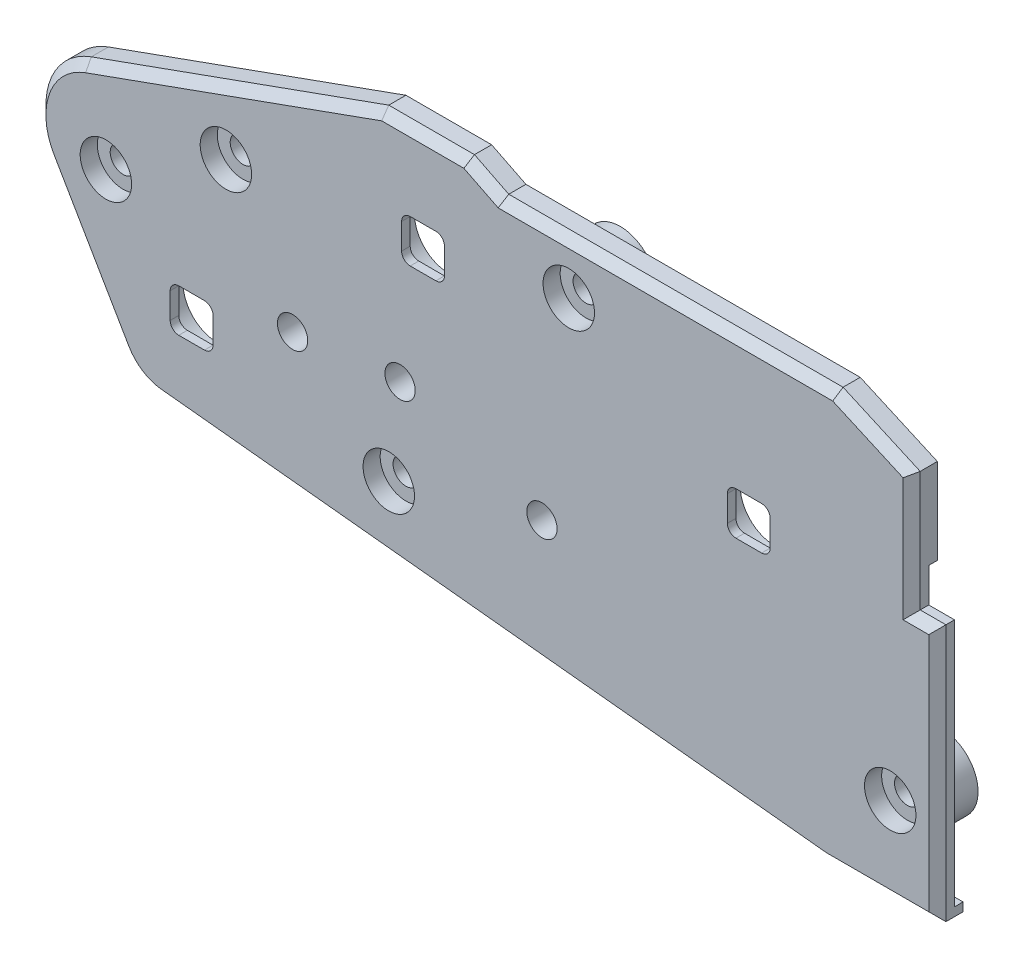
ISO-10303-21;
HEADER;
FILE_DESCRIPTION(('STEP AP214'),'2;1');
FILE_NAME('part.step','',(''),(''),'','','');
FILE_SCHEMA(('AUTOMOTIVE_DESIGN { 1 0 10303 214 1 1 1 1 }'));
ENDSEC;
DATA;
#1=APPLICATION_CONTEXT('core data for automotive mechanical design processes');
#2=APPLICATION_PROTOCOL_DEFINITION('international standard','automotive_design',2000,#1);
#3=PRODUCT_CONTEXT('',#1,'mechanical');
#4=PRODUCT('Part','Part','',(#3));
#5=PRODUCT_RELATED_PRODUCT_CATEGORY('part','',(#4));
#6=PRODUCT_DEFINITION_FORMATION('','',#4);
#7=PRODUCT_DEFINITION_CONTEXT('part definition',#1,'design');
#8=PRODUCT_DEFINITION('design','',#6,#7);
#9=PRODUCT_DEFINITION_SHAPE('','',#8);
#10=(LENGTH_UNIT() NAMED_UNIT(*) SI_UNIT(.MILLI.,.METRE.));
#11=(NAMED_UNIT(*) PLANE_ANGLE_UNIT() SI_UNIT($,.RADIAN.));
#12=(NAMED_UNIT(*) SI_UNIT($,.STERADIAN.) SOLID_ANGLE_UNIT());
#13=UNCERTAINTY_MEASURE_WITH_UNIT(LENGTH_MEASURE(1.E-05),#10,'distance_accuracy_value','');
#14=(GEOMETRIC_REPRESENTATION_CONTEXT(3) GLOBAL_UNCERTAINTY_ASSIGNED_CONTEXT((#13)) GLOBAL_UNIT_ASSIGNED_CONTEXT((#10,
#11,#12)) REPRESENTATION_CONTEXT('',''));
#15=CARTESIAN_POINT('',(0.,0.,0.));
#16=DIRECTION('',(0.,0.,1.));
#17=DIRECTION('',(1.,0.,0.));
#18=AXIS2_PLACEMENT_3D('',#15,#16,#17);
#19=CARTESIAN_POINT('',(-90.0000000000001,14.,0.));
#20=DIRECTION('',(0.,0.,-1.));
#21=DIRECTION('',(-1.,0.,0.));
#22=AXIS2_PLACEMENT_3D('',#19,#20,#21);
#23=PLANE('',#22);
#24=CARTESIAN_POINT('',(-62.679901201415,23.6905223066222,0.));
#25=DIRECTION('',(0.,0.,-1.));
#26=DIRECTION('',(-1.,0.,0.));
#27=AXIS2_PLACEMENT_3D('',#24,#25,#26);
#28=CIRCLE('',#27,3.);
#29=CARTESIAN_POINT('',(-65.679901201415,23.6905223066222,0.));
#30=VERTEX_POINT('',#29);
#31=EDGE_CURVE('E1575',#30,#30,#28,.T.);
#32=ORIENTED_EDGE('',*,*,#31,.F.);
#33=EDGE_LOOP('',(#32));
#34=FACE_BOUND('',#33,.T.);
#35=CARTESIAN_POINT('',(-97.0000000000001,28.,0.));
#36=DIRECTION('',(0.,0.,-1.));
#37=DIRECTION('',(-1.,0.,0.));
#38=AXIS2_PLACEMENT_3D('',#35,#36,#37);
#39=CIRCLE('',#38,4.25);
#40=CARTESIAN_POINT('',(-101.25,28.,0.));
#41=VERTEX_POINT('',#40);
#42=EDGE_CURVE('E610',#41,#41,#39,.T.);
#43=ORIENTED_EDGE('',*,*,#42,.F.);
#44=EDGE_LOOP('',(#43));
#45=FACE_BOUND('',#44,.T.);
#46=CARTESIAN_POINT('',(-43.,42.,0.));
#47=DIRECTION('',(0.,0.,-1.));
#48=DIRECTION('',(-1.,0.,0.));
#49=AXIS2_PLACEMENT_3D('',#46,#47,#48);
#50=CIRCLE('',#49,4.25);
#51=CARTESIAN_POINT('',(-47.25,42.,0.));
#52=VERTEX_POINT('',#51);
#53=EDGE_CURVE('E622',#52,#52,#50,.T.);
#54=ORIENTED_EDGE('',*,*,#53,.F.);
#55=EDGE_LOOP('',(#54));
#56=FACE_BOUND('',#55,.T.);
#57=CARTESIAN_POINT('',(-5.50000000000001,10.,0.));
#58=DIRECTION('',(0.,0.,-1.));
#59=DIRECTION('',(-1.,0.,0.));
#60=AXIS2_PLACEMENT_3D('',#57,#58,#59);
#61=CIRCLE('',#60,4.25);
#62=CARTESIAN_POINT('',(-9.75000000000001,10.,0.));
#63=VERTEX_POINT('',#62);
#64=EDGE_CURVE('E650',#63,#63,#61,.T.);
#65=ORIENTED_EDGE('',*,*,#64,.F.);
#66=EDGE_LOOP('',(#65));
#67=FACE_BOUND('',#66,.T.);
#68=DIRECTION('',(0.,1.,0.));
#69=VECTOR('',#68,1.);
#70=CARTESIAN_POINT('',(0.,0.,0.));
#71=LINE('',#70,#69);
#72=CARTESIAN_POINT('',(0.,1.,0.));
#73=VERTEX_POINT('',#72);
#74=CARTESIAN_POINT('',(0.,30.,0.));
#75=VERTEX_POINT('',#74);
#76=EDGE_CURVE('E665',#73,#75,#71,.T.);
#77=ORIENTED_EDGE('',*,*,#76,.F.);
#78=DIRECTION('',(-1.,0.,0.));
#79=VECTOR('',#78,1.);
#80=CARTESIAN_POINT('',(0.,1.,0.));
#81=LINE('',#80,#79);
#82=CARTESIAN_POINT('',(-12.9483977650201,1.,0.));
#83=VERTEX_POINT('',#82);
#84=EDGE_CURVE('E680',#73,#83,#81,.T.);
#85=ORIENTED_EDGE('',*,*,#84,.T.);
#86=DIRECTION('',(-0.994688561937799,0.102930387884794,0.));
#87=VECTOR('',#86,1.);
#88=CARTESIAN_POINT('',(-12.8970696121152,0.994688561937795,0.));
#89=LINE('',#88,#87);
#90=CARTESIAN_POINT('',(-90.514651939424,9.02655719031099,0.));
#91=VERTEX_POINT('',#90);
#92=EDGE_CURVE('E684',#83,#91,#89,.T.);
#93=ORIENTED_EDGE('',*,*,#92,.T.);
#94=CARTESIAN_POINT('',(-90.0000000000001,14.,0.));
#95=DIRECTION('',(0.,0.,-1.));
#96=DIRECTION('',(-1.,0.,0.));
#97=AXIS2_PLACEMENT_3D('',#94,#95,#96);
#98=CIRCLE('',#97,5.);
#99=CARTESIAN_POINT('',(-94.3211413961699,11.4845006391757,0.));
#100=VERTEX_POINT('',#99);
#101=EDGE_CURVE('E2455',#91,#100,#98,.T.);
#102=ORIENTED_EDGE('',*,*,#101,.T.);
#103=DIRECTION('',(-0.50309987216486,0.864228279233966,0.));
#104=VECTOR('',#103,1.);
#105=CARTESIAN_POINT('',(-94.3211413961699,11.4845006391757,0.));
#106=LINE('',#105,#104);
#107=CARTESIAN_POINT('',(-103.049597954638,26.478300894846,0.));
#108=VERTEX_POINT('',#107);
#109=EDGE_CURVE('E2456',#100,#108,#106,.T.);
#110=ORIENTED_EDGE('',*,*,#109,.T.);
#111=CARTESIAN_POINT('',(-97.0000000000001,30.,0.));
#112=DIRECTION('',(0.,0.,-1.));
#113=DIRECTION('',(-1.,0.,0.));
#114=AXIS2_PLACEMENT_3D('',#111,#112,#113);
#115=CIRCLE('',#114,7.);
#116=CARTESIAN_POINT('',(-99.3672365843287,36.5875785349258,0.));
#117=VERTEX_POINT('',#116);
#118=EDGE_CURVE('E2461',#108,#117,#115,.T.);
#119=ORIENTED_EDGE('',*,*,#118,.T.);
#120=DIRECTION('',(0.941082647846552,0.338176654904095,0.));
#121=VECTOR('',#120,1.);
#122=CARTESIAN_POINT('',(-99.3672365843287,36.5875785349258,0.));
#123=LINE('',#122,#121);
#124=CARTESIAN_POINT('',(-64.8257793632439,49.,0.));
#125=VERTEX_POINT('',#124);
#126=EDGE_CURVE('E2464',#117,#125,#123,.T.);
#127=ORIENTED_EDGE('',*,*,#126,.T.);
#128=DIRECTION('',(-1.,0.,0.));
#129=VECTOR('',#128,1.);
#130=CARTESIAN_POINT('',(-65.0000000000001,49.,0.));
#131=LINE('',#130,#129);
#132=CARTESIAN_POINT('',(-55.2360679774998,49.,0.));
#133=VERTEX_POINT('',#132);
#134=EDGE_CURVE('E2467',#125,#133,#131,.F.);
#135=ORIENTED_EDGE('',*,*,#134,.T.);
#136=DIRECTION('',(0.894427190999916,-0.447213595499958,0.));
#137=VECTOR('',#136,1.);
#138=CARTESIAN_POINT('',(-55.4472135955,49.1055728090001,0.));
#139=LINE('',#138,#137);
#140=CARTESIAN_POINT('',(-51.2360679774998,47.,0.));
#141=VERTEX_POINT('',#140);
#142=EDGE_CURVE('E2470',#133,#141,#139,.T.);
#143=ORIENTED_EDGE('',*,*,#142,.T.);
#144=DIRECTION('',(1.,0.,0.));
#145=VECTOR('',#144,1.);
#146=CARTESIAN_POINT('',(-51.,47.,0.));
#147=LINE('',#146,#145);
#148=CARTESIAN_POINT('',(-12.212214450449,47.,0.));
#149=VERTEX_POINT('',#148);
#150=EDGE_CURVE('E2473',#141,#149,#147,.T.);
#151=ORIENTED_EDGE('',*,*,#150,.T.);
#152=DIRECTION('',(0.913811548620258,-0.406138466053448,0.));
#153=VECTOR('',#152,1.);
#154=CARTESIAN_POINT('',(-12.4061384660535,47.0861884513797,0.));
#155=LINE('',#154,#153);
#156=CARTESIAN_POINT('',(-4.00000000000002,43.3501269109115,0.));
#157=VERTEX_POINT('',#156);
#158=EDGE_CURVE('E2475',#149,#157,#155,.T.);
#159=ORIENTED_EDGE('',*,*,#158,.T.);
#160=DIRECTION('',(0.,-1.,0.));
#161=VECTOR('',#160,1.);
#162=CARTESIAN_POINT('',(-4.00000000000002,44.,0.));
#163=LINE('',#162,#161);
#164=CARTESIAN_POINT('',(-4.00000000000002,34.,0.));
#165=VERTEX_POINT('',#164);
#166=EDGE_CURVE('E659',#157,#165,#163,.T.);
#167=ORIENTED_EDGE('',*,*,#166,.T.);
#168=DIRECTION('',(1.,0.,0.));
#169=VECTOR('',#168,1.);
#170=CARTESIAN_POINT('',(-4.00000000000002,34.,0.));
#171=LINE('',#170,#169);
#172=CARTESIAN_POINT('',(-3.00000000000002,34.,0.));
#173=VERTEX_POINT('',#172);
#174=EDGE_CURVE('E656',#165,#173,#171,.T.);
#175=ORIENTED_EDGE('',*,*,#174,.T.);
#176=DIRECTION('',(0.,1.,0.));
#177=VECTOR('',#176,1.);
#178=CARTESIAN_POINT('',(-3.00000000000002,30.,0.));
#179=LINE('',#178,#177);
#180=CARTESIAN_POINT('',(-3.00000000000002,30.,0.));
#181=VERTEX_POINT('',#180);
#182=EDGE_CURVE('E906',#181,#173,#179,.T.);
#183=ORIENTED_EDGE('',*,*,#182,.F.);
#184=DIRECTION('',(-1.,0.,0.));
#185=VECTOR('',#184,1.);
#186=CARTESIAN_POINT('',(0.,30.,0.));
#187=LINE('',#186,#185);
#188=EDGE_CURVE('E910',#75,#181,#187,.T.);
#189=ORIENTED_EDGE('',*,*,#188,.F.);
#190=EDGE_LOOP('',(#77,#85,#93,#102,#110,#119,#127,#135,#143,#151,#159,#167,#175,#183,#189));
#191=FACE_BOUND('',#190,.T.);
#192=CARTESIAN_POINT('',(-64.0000000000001,13.,0.));
#193=DIRECTION('',(0.,0.,-1.));
#194=DIRECTION('',(-1.,0.,0.));
#195=AXIS2_PLACEMENT_3D('',#192,#193,#194);
#196=CIRCLE('',#195,4.25);
#197=CARTESIAN_POINT('',(-68.2500000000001,13.,0.));
#198=VERTEX_POINT('',#197);
#199=EDGE_CURVE('E628',#198,#198,#196,.T.);
#200=ORIENTED_EDGE('',*,*,#199,.F.);
#201=EDGE_LOOP('',(#200));
#202=FACE_BOUND('',#201,.T.);
#203=CARTESIAN_POINT('',(-83.,36.,0.));
#204=DIRECTION('',(0.,0.,-1.));
#205=DIRECTION('',(-1.,0.,0.));
#206=AXIS2_PLACEMENT_3D('',#203,#204,#205);
#207=CIRCLE('',#206,4.25);
#208=CARTESIAN_POINT('',(-87.2500000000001,36.,0.));
#209=VERTEX_POINT('',#208);
#210=EDGE_CURVE('E616',#209,#209,#207,.T.);
#211=ORIENTED_EDGE('',*,*,#210,.F.);
#212=EDGE_LOOP('',(#211));
#213=FACE_BOUND('',#212,.T.);
#214=CARTESIAN_POINT('',(-22.,30.,0.));
#215=DIRECTION('',(0.,0.,-1.));
#216=DIRECTION('',(-1.,0.,0.));
#217=AXIS2_PLACEMENT_3D('',#214,#215,#216);
#218=CIRCLE('',#217,5.5);
#219=CARTESIAN_POINT('',(-27.5,30.,0.));
#220=VERTEX_POINT('',#219);
#221=EDGE_CURVE('E697',#220,#220,#218,.T.);
#222=ORIENTED_EDGE('',*,*,#221,.F.);
#223=EDGE_LOOP('',(#222));
#224=FACE_BOUND('',#223,.T.);
#225=CARTESIAN_POINT('',(-60.,38.5,0.));
#226=DIRECTION('',(0.,0.,-1.));
#227=DIRECTION('',(-1.,0.,0.));
#228=AXIS2_PLACEMENT_3D('',#225,#226,#227);
#229=CIRCLE('',#228,5.5);
#230=CARTESIAN_POINT('',(-65.5,38.5,0.));
#231=VERTEX_POINT('',#230);
#232=EDGE_CURVE('E725',#231,#231,#229,.T.);
#233=ORIENTED_EDGE('',*,*,#232,.F.);
#234=EDGE_LOOP('',(#233));
#235=FACE_BOUND('',#234,.T.);
#236=CARTESIAN_POINT('',(-87.,18.,0.));
#237=DIRECTION('',(0.,0.,-1.));
#238=DIRECTION('',(-1.,0.,0.));
#239=AXIS2_PLACEMENT_3D('',#236,#237,#238);
#240=CIRCLE('',#239,5.5);
#241=CARTESIAN_POINT('',(-92.5000000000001,18.,0.));
#242=VERTEX_POINT('',#241);
#243=EDGE_CURVE('E728',#242,#242,#240,.T.);
#244=ORIENTED_EDGE('',*,*,#243,.F.);
#245=EDGE_LOOP('',(#244));
#246=FACE_BOUND('',#245,.T.);
#247=CARTESIAN_POINT('',(-46.1309448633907,18.,0.));
#248=DIRECTION('',(0.,0.,-1.));
#249=DIRECTION('',(-1.,0.,0.));
#250=AXIS2_PLACEMENT_3D('',#247,#248,#249);
#251=CIRCLE('',#250,3.);
#252=CARTESIAN_POINT('',(-49.1309448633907,18.,0.));
#253=VERTEX_POINT('',#252);
#254=EDGE_CURVE('E409',#253,#253,#251,.T.);
#255=ORIENTED_EDGE('',*,*,#254,.F.);
#256=EDGE_LOOP('',(#255));
#257=FACE_BOUND('',#256,.T.);
#258=CARTESIAN_POINT('',(-75.2210268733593,22.4739012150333,0.));
#259=DIRECTION('',(0.,0.,-1.));
#260=DIRECTION('',(-1.,0.,0.));
#261=AXIS2_PLACEMENT_3D('',#258,#259,#260);
#262=CIRCLE('',#261,3.);
#263=CARTESIAN_POINT('',(-78.2210268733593,22.4739012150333,0.));
#264=VERTEX_POINT('',#263);
#265=EDGE_CURVE('E1569',#264,#264,#262,.T.);
#266=ORIENTED_EDGE('',*,*,#265,.F.);
#267=EDGE_LOOP('',(#266));
#268=FACE_BOUND('',#267,.T.);
#269=ADVANCED_FACE('F30',(#34,#45,#56,#67,#191,#202,#213,#224,#235,#246,#257,#268),#23,.T.);
#270=CARTESIAN_POINT('',(-90.0000000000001,14.,2.));
#271=DIRECTION('',(0.,0.,-1.));
#272=DIRECTION('',(-1.,0.,0.));
#273=AXIS2_PLACEMENT_3D('',#270,#271,#272);
#274=PLANE('',#273);
#275=CARTESIAN_POINT('',(-75.2210268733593,22.4739012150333,2.));
#276=DIRECTION('',(0.,0.,-1.));
#277=DIRECTION('',(-1.,0.,0.));
#278=AXIS2_PLACEMENT_3D('',#275,#276,#277);
#279=CIRCLE('',#278,1.76886983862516);
#280=CARTESIAN_POINT('',(-76.9898967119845,22.4739012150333,2.));
#281=VERTEX_POINT('',#280);
#282=EDGE_CURVE('E1556',#281,#281,#279,.T.);
#283=ORIENTED_EDGE('',*,*,#282,.T.);
#284=EDGE_LOOP('',(#283));
#285=FACE_BOUND('',#284,.T.);
#286=CARTESIAN_POINT('',(-62.679901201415,23.6905223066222,2.));
#287=DIRECTION('',(0.,0.,-1.));
#288=DIRECTION('',(-1.,0.,0.));
#289=AXIS2_PLACEMENT_3D('',#286,#287,#288);
#290=CIRCLE('',#289,1.76886983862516);
#291=CARTESIAN_POINT('',(-64.4487710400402,23.6905223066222,2.));
#292=VERTEX_POINT('',#291);
#293=EDGE_CURVE('E1566',#292,#292,#290,.T.);
#294=ORIENTED_EDGE('',*,*,#293,.T.);
#295=EDGE_LOOP('',(#294));
#296=FACE_BOUND('',#295,.T.);
#297=CARTESIAN_POINT('',(-46.1309448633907,18.,2.));
#298=DIRECTION('',(0.,0.,-1.));
#299=DIRECTION('',(-1.,0.,0.));
#300=AXIS2_PLACEMENT_3D('',#297,#298,#299);
#301=CIRCLE('',#300,1.76886983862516);
#302=CARTESIAN_POINT('',(-47.8998147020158,18.,2.));
#303=VERTEX_POINT('',#302);
#304=EDGE_CURVE('E1584',#303,#303,#301,.T.);
#305=ORIENTED_EDGE('',*,*,#304,.T.);
#306=EDGE_LOOP('',(#305));
#307=FACE_BOUND('',#306,.T.);
#308=CARTESIAN_POINT('',(-58.5,40.,2.));
#309=DIRECTION('',(0.,0.,-1.));
#310=DIRECTION('',(1.,0.,0.));
#311=AXIS2_PLACEMENT_3D('',#308,#309,#310);
#312=CIRCLE('',#311,0.999999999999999);
#313=CARTESIAN_POINT('',(-58.5,41.,2.));
#314=VERTEX_POINT('',#313);
#315=CARTESIAN_POINT('',(-57.5,40.,2.));
#316=VERTEX_POINT('',#315);
#317=EDGE_CURVE('E390',#314,#316,#312,.T.);
#318=ORIENTED_EDGE('',*,*,#317,.T.);
#319=DIRECTION('',(0.,-1.,0.));
#320=VECTOR('',#319,1.);
#321=CARTESIAN_POINT('',(-57.5,40.,2.));
#322=LINE('',#321,#320);
#323=CARTESIAN_POINT('',(-57.5,37.,2.));
#324=VERTEX_POINT('',#323);
#325=EDGE_CURVE('E440',#316,#324,#322,.T.);
#326=ORIENTED_EDGE('',*,*,#325,.T.);
#327=CARTESIAN_POINT('',(-58.5,37.,2.));
#328=DIRECTION('',(0.,0.,-1.));
#329=DIRECTION('',(1.,0.,0.));
#330=AXIS2_PLACEMENT_3D('',#327,#328,#329);
#331=CIRCLE('',#330,0.999999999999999);
#332=CARTESIAN_POINT('',(-58.5,36.,2.));
#333=VERTEX_POINT('',#332);
#334=EDGE_CURVE('E443',#324,#333,#331,.T.);
#335=ORIENTED_EDGE('',*,*,#334,.T.);
#336=DIRECTION('',(-1.,0.,0.));
#337=VECTOR('',#336,1.);
#338=CARTESIAN_POINT('',(-58.5,36.,2.));
#339=LINE('',#338,#337);
#340=CARTESIAN_POINT('',(-61.5,36.,2.));
#341=VERTEX_POINT('',#340);
#342=EDGE_CURVE('E446',#333,#341,#339,.T.);
#343=ORIENTED_EDGE('',*,*,#342,.T.);
#344=CARTESIAN_POINT('',(-61.5,37.,2.));
#345=DIRECTION('',(0.,0.,-1.));
#346=DIRECTION('',(1.,0.,0.));
#347=AXIS2_PLACEMENT_3D('',#344,#345,#346);
#348=CIRCLE('',#347,0.999999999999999);
#349=CARTESIAN_POINT('',(-62.5,37.,2.));
#350=VERTEX_POINT('',#349);
#351=EDGE_CURVE('E449',#341,#350,#348,.T.);
#352=ORIENTED_EDGE('',*,*,#351,.T.);
#353=DIRECTION('',(0.,1.,0.));
#354=VECTOR('',#353,1.);
#355=CARTESIAN_POINT('',(-62.5,40.,2.));
#356=LINE('',#355,#354);
#357=CARTESIAN_POINT('',(-62.5,40.,2.));
#358=VERTEX_POINT('',#357);
#359=EDGE_CURVE('E452',#350,#358,#356,.T.);
#360=ORIENTED_EDGE('',*,*,#359,.T.);
#361=CARTESIAN_POINT('',(-61.5,40.,2.));
#362=DIRECTION('',(0.,0.,-1.));
#363=DIRECTION('',(1.,0.,0.));
#364=AXIS2_PLACEMENT_3D('',#361,#362,#363);
#365=CIRCLE('',#364,0.999999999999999);
#366=CARTESIAN_POINT('',(-61.5,41.,2.));
#367=VERTEX_POINT('',#366);
#368=EDGE_CURVE('E455',#358,#367,#365,.T.);
#369=ORIENTED_EDGE('',*,*,#368,.T.);
#370=DIRECTION('',(1.,0.,0.));
#371=VECTOR('',#370,1.);
#372=CARTESIAN_POINT('',(-58.5,41.,2.));
#373=LINE('',#372,#371);
#374=EDGE_CURVE('E458',#367,#314,#373,.T.);
#375=ORIENTED_EDGE('',*,*,#374,.T.);
#376=EDGE_LOOP('',(#318,#326,#335,#343,#352,#360,#369,#375));
#377=FACE_BOUND('',#376,.T.);
#378=CARTESIAN_POINT('',(-90.0000000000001,14.,2.));
#379=DIRECTION('',(0.,0.,-1.));
#380=DIRECTION('',(-1.,0.,0.));
#381=AXIS2_PLACEMENT_3D('',#378,#379,#380);
#382=CIRCLE('',#381,5.);
#383=CARTESIAN_POINT('',(-94.3211413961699,11.4845006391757,2.));
#384=VERTEX_POINT('',#383);
#385=CARTESIAN_POINT('',(-90.514651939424,9.02655719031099,2.));
#386=VERTEX_POINT('',#385);
#387=EDGE_CURVE('E956',#384,#386,#382,.F.);
#388=ORIENTED_EDGE('',*,*,#387,.T.);
#389=DIRECTION('',(0.994688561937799,-0.102930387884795,0.));
#390=VECTOR('',#389,1.);
#391=CARTESIAN_POINT('',(-90.514651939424,9.026557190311,2.));
#392=LINE('',#391,#390);
#393=CARTESIAN_POINT('',(-12.9483977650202,1.,2.));
#394=VERTEX_POINT('',#393);
#395=EDGE_CURVE('E958',#386,#394,#392,.T.);
#396=ORIENTED_EDGE('',*,*,#395,.T.);
#397=DIRECTION('',(1.,0.,0.));
#398=VECTOR('',#397,1.);
#399=CARTESIAN_POINT('',(-90.0000000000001,0.999999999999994,2.));
#400=LINE('',#399,#398);
#401=CARTESIAN_POINT('',(-1.,1.,2.));
#402=VERTEX_POINT('',#401);
#403=EDGE_CURVE('E935',#394,#402,#400,.T.);
#404=ORIENTED_EDGE('',*,*,#403,.T.);
#405=DIRECTION('',(0.,1.,0.));
#406=VECTOR('',#405,1.);
#407=CARTESIAN_POINT('',(-1.00000000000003,14.,2.));
#408=LINE('',#407,#406);
#409=CARTESIAN_POINT('',(-1.00000000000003,29.,2.));
#410=VERTEX_POINT('',#409);
#411=EDGE_CURVE('E937',#402,#410,#408,.T.);
#412=ORIENTED_EDGE('',*,*,#411,.T.);
#413=DIRECTION('',(-1.,0.,0.));
#414=VECTOR('',#413,1.);
#415=CARTESIAN_POINT('',(-90.0000000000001,29.,2.));
#416=LINE('',#415,#414);
#417=CARTESIAN_POINT('',(-4.00000000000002,29.,2.));
#418=VERTEX_POINT('',#417);
#419=EDGE_CURVE('E890',#410,#418,#416,.T.);
#420=ORIENTED_EDGE('',*,*,#419,.T.);
#421=DIRECTION('',(0.,1.,0.));
#422=VECTOR('',#421,1.);
#423=CARTESIAN_POINT('',(-4.00000000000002,14.,2.));
#424=LINE('',#423,#422);
#425=CARTESIAN_POINT('',(-4.00000000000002,43.3501269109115,2.));
#426=VERTEX_POINT('',#425);
#427=EDGE_CURVE('E940',#418,#426,#424,.T.);
#428=ORIENTED_EDGE('',*,*,#427,.T.);
#429=DIRECTION('',(-0.913811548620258,0.406138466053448,0.));
#430=VECTOR('',#429,1.);
#431=CARTESIAN_POINT('',(-64.9216023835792,70.4263946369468,2.));
#432=LINE('',#431,#430);
#433=CARTESIAN_POINT('',(-12.212214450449,47.,2.));
#434=VERTEX_POINT('',#433);
#435=EDGE_CURVE('E942',#426,#434,#432,.T.);
#436=ORIENTED_EDGE('',*,*,#435,.T.);
#437=DIRECTION('',(-1.,0.,0.));
#438=VECTOR('',#437,1.);
#439=CARTESIAN_POINT('',(-90.0000000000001,47.,2.));
#440=LINE('',#439,#438);
#441=CARTESIAN_POINT('',(-51.2360679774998,47.,2.));
#442=VERTEX_POINT('',#441);
#443=EDGE_CURVE('E944',#434,#442,#440,.T.);
#444=ORIENTED_EDGE('',*,*,#443,.T.);
#445=DIRECTION('',(-0.894427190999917,0.447213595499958,0.));
#446=VECTOR('',#445,1.);
#447=CARTESIAN_POINT('',(-69.0472135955,55.9055728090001,2.));
#448=LINE('',#447,#446);
#449=CARTESIAN_POINT('',(-55.2360679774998,49.,2.));
#450=VERTEX_POINT('',#449);
#451=EDGE_CURVE('E946',#442,#450,#448,.T.);
#452=ORIENTED_EDGE('',*,*,#451,.T.);
#453=DIRECTION('',(-1.,0.,0.));
#454=VECTOR('',#453,1.);
#455=CARTESIAN_POINT('',(-90.0000000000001,49.,2.));
#456=LINE('',#455,#454);
#457=CARTESIAN_POINT('',(-64.8257793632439,49.,2.));
#458=VERTEX_POINT('',#457);
#459=EDGE_CURVE('E948',#450,#458,#456,.T.);
#460=ORIENTED_EDGE('',*,*,#459,.T.);
#461=DIRECTION('',(-0.941082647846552,-0.338176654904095,0.));
#462=VECTOR('',#461,1.);
#463=CARTESIAN_POINT('',(-98.2598156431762,36.9855286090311,1.99999999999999));
#464=LINE('',#463,#462);
#465=CARTESIAN_POINT('',(-99.3672365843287,36.5875785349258,1.99999999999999));
#466=VERTEX_POINT('',#465);
#467=EDGE_CURVE('E950',#458,#466,#464,.T.);
#468=ORIENTED_EDGE('',*,*,#467,.T.);
#469=CARTESIAN_POINT('',(-97.0000000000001,30.,2.));
#470=DIRECTION('',(0.,0.,-1.));
#471=DIRECTION('',(-1.,0.,0.));
#472=AXIS2_PLACEMENT_3D('',#469,#470,#471);
#473=CIRCLE('',#472,7.);
#474=CARTESIAN_POINT('',(-103.049597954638,26.478300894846,1.99999999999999));
#475=VERTEX_POINT('',#474);
#476=EDGE_CURVE('E952',#466,#475,#473,.F.);
#477=ORIENTED_EDGE('',*,*,#476,.T.);
#478=DIRECTION('',(0.50309987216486,-0.864228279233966,0.));
#479=VECTOR('',#478,1.);
#480=CARTESIAN_POINT('',(-94.3211413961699,11.4845006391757,2.));
#481=LINE('',#480,#479);
#482=EDGE_CURVE('E954',#475,#384,#481,.T.);
#483=ORIENTED_EDGE('',*,*,#482,.T.);
#484=EDGE_LOOP('',(#388,#396,#404,#412,#420,#428,#436,#444,#452,#460,#468,#477,#483));
#485=FACE_BOUND('',#484,.T.);
#486=CARTESIAN_POINT('',(-5.50000000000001,10.,2.));
#487=DIRECTION('',(0.,0.,1.));
#488=DIRECTION('',(1.,0.,0.));
#489=AXIS2_PLACEMENT_3D('',#486,#487,#488);
#490=CIRCLE('',#489,3.);
#491=CARTESIAN_POINT('',(-2.50000000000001,10.,2.));
#492=VERTEX_POINT('',#491);
#493=EDGE_CURVE('E638',#492,#492,#490,.T.);
#494=ORIENTED_EDGE('',*,*,#493,.F.);
#495=EDGE_LOOP('',(#494));
#496=FACE_BOUND('',#495,.T.);
#497=CARTESIAN_POINT('',(-64.0000000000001,13.,2.));
#498=DIRECTION('',(0.,0.,1.));
#499=DIRECTION('',(1.,0.,0.));
#500=AXIS2_PLACEMENT_3D('',#497,#498,#499);
#501=CIRCLE('',#500,3.);
#502=CARTESIAN_POINT('',(-61.0000000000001,13.,2.));
#503=VERTEX_POINT('',#502);
#504=EDGE_CURVE('E580',#503,#503,#501,.T.);
#505=ORIENTED_EDGE('',*,*,#504,.F.);
#506=EDGE_LOOP('',(#505));
#507=FACE_BOUND('',#506,.T.);
#508=CARTESIAN_POINT('',(-43.,42.,2.));
#509=DIRECTION('',(0.,0.,1.));
#510=DIRECTION('',(1.,0.,0.));
#511=AXIS2_PLACEMENT_3D('',#508,#509,#510);
#512=CIRCLE('',#511,3.);
#513=CARTESIAN_POINT('',(-40.,42.,2.));
#514=VERTEX_POINT('',#513);
#515=EDGE_CURVE('E574',#514,#514,#512,.T.);
#516=ORIENTED_EDGE('',*,*,#515,.F.);
#517=EDGE_LOOP('',(#516));
#518=FACE_BOUND('',#517,.T.);
#519=CARTESIAN_POINT('',(-83.,36.,2.));
#520=DIRECTION('',(0.,0.,1.));
#521=DIRECTION('',(1.,0.,0.));
#522=AXIS2_PLACEMENT_3D('',#519,#520,#521);
#523=CIRCLE('',#522,3.);
#524=CARTESIAN_POINT('',(-80.,36.,2.));
#525=VERTEX_POINT('',#524);
#526=EDGE_CURVE('E568',#525,#525,#523,.T.);
#527=ORIENTED_EDGE('',*,*,#526,.F.);
#528=EDGE_LOOP('',(#527));
#529=FACE_BOUND('',#528,.T.);
#530=CARTESIAN_POINT('',(-97.0000000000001,28.,2.));
#531=DIRECTION('',(0.,0.,1.));
#532=DIRECTION('',(1.,0.,0.));
#533=AXIS2_PLACEMENT_3D('',#530,#531,#532);
#534=CIRCLE('',#533,3.);
#535=CARTESIAN_POINT('',(-94.0000000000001,28.,2.));
#536=VERTEX_POINT('',#535);
#537=EDGE_CURVE('E562',#536,#536,#534,.T.);
#538=ORIENTED_EDGE('',*,*,#537,.F.);
#539=EDGE_LOOP('',(#538));
#540=FACE_BOUND('',#539,.T.);
#541=CARTESIAN_POINT('',(-20.5,31.5,2.));
#542=DIRECTION('',(0.,0.,-1.));
#543=DIRECTION('',(1.,0.,0.));
#544=AXIS2_PLACEMENT_3D('',#541,#542,#543);
#545=CIRCLE('',#544,0.999999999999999);
#546=CARTESIAN_POINT('',(-20.5,32.5,2.));
#547=VERTEX_POINT('',#546);
#548=CARTESIAN_POINT('',(-19.5,31.5,2.));
#549=VERTEX_POINT('',#548);
#550=EDGE_CURVE('E496',#547,#549,#545,.T.);
#551=ORIENTED_EDGE('',*,*,#550,.T.);
#552=DIRECTION('',(0.,-1.,0.));
#553=VECTOR('',#552,1.);
#554=CARTESIAN_POINT('',(-19.5,31.5,2.));
#555=LINE('',#554,#553);
#556=CARTESIAN_POINT('',(-19.5,28.5,2.));
#557=VERTEX_POINT('',#556);
#558=EDGE_CURVE('E499',#549,#557,#555,.T.);
#559=ORIENTED_EDGE('',*,*,#558,.T.);
#560=CARTESIAN_POINT('',(-20.5,28.5,2.));
#561=DIRECTION('',(0.,0.,-1.));
#562=DIRECTION('',(1.,0.,0.));
#563=AXIS2_PLACEMENT_3D('',#560,#561,#562);
#564=CIRCLE('',#563,0.999999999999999);
#565=CARTESIAN_POINT('',(-20.5,27.5,2.));
#566=VERTEX_POINT('',#565);
#567=EDGE_CURVE('E502',#557,#566,#564,.T.);
#568=ORIENTED_EDGE('',*,*,#567,.T.);
#569=DIRECTION('',(-1.,0.,0.));
#570=VECTOR('',#569,1.);
#571=CARTESIAN_POINT('',(-20.5,27.5,2.));
#572=LINE('',#571,#570);
#573=CARTESIAN_POINT('',(-23.5,27.5,2.));
#574=VERTEX_POINT('',#573);
#575=EDGE_CURVE('E505',#566,#574,#572,.T.);
#576=ORIENTED_EDGE('',*,*,#575,.T.);
#577=CARTESIAN_POINT('',(-23.5,28.5,2.));
#578=DIRECTION('',(0.,0.,-1.));
#579=DIRECTION('',(1.,0.,0.));
#580=AXIS2_PLACEMENT_3D('',#577,#578,#579);
#581=CIRCLE('',#580,0.999999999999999);
#582=CARTESIAN_POINT('',(-24.5,28.5,2.));
#583=VERTEX_POINT('',#582);
#584=EDGE_CURVE('E508',#574,#583,#581,.T.);
#585=ORIENTED_EDGE('',*,*,#584,.T.);
#586=DIRECTION('',(0.,1.,0.));
#587=VECTOR('',#586,1.);
#588=CARTESIAN_POINT('',(-24.5,31.5,2.));
#589=LINE('',#588,#587);
#590=CARTESIAN_POINT('',(-24.5,31.5,2.));
#591=VERTEX_POINT('',#590);
#592=EDGE_CURVE('E511',#583,#591,#589,.T.);
#593=ORIENTED_EDGE('',*,*,#592,.T.);
#594=CARTESIAN_POINT('',(-23.5,31.5,2.));
#595=DIRECTION('',(0.,0.,-1.));
#596=DIRECTION('',(1.,0.,0.));
#597=AXIS2_PLACEMENT_3D('',#594,#595,#596);
#598=CIRCLE('',#597,0.999999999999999);
#599=CARTESIAN_POINT('',(-23.5,32.5,2.));
#600=VERTEX_POINT('',#599);
#601=EDGE_CURVE('E514',#591,#600,#598,.T.);
#602=ORIENTED_EDGE('',*,*,#601,.T.);
#603=DIRECTION('',(1.,0.,0.));
#604=VECTOR('',#603,1.);
#605=CARTESIAN_POINT('',(-20.5,32.5,2.));
#606=LINE('',#605,#604);
#607=EDGE_CURVE('E517',#600,#547,#606,.T.);
#608=ORIENTED_EDGE('',*,*,#607,.T.);
#609=EDGE_LOOP('',(#551,#559,#568,#576,#585,#593,#602,#608));
#610=FACE_BOUND('',#609,.T.);
#611=CARTESIAN_POINT('',(-85.5,19.5,2.));
#612=DIRECTION('',(0.,0.,-1.));
#613=DIRECTION('',(1.,0.,0.));
#614=AXIS2_PLACEMENT_3D('',#611,#612,#613);
#615=CIRCLE('',#614,0.999999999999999);
#616=CARTESIAN_POINT('',(-85.5,20.5,2.));
#617=VERTEX_POINT('',#616);
#618=CARTESIAN_POINT('',(-84.5,19.5,2.));
#619=VERTEX_POINT('',#618);
#620=EDGE_CURVE('E45',#617,#619,#615,.T.);
#621=ORIENTED_EDGE('',*,*,#620,.T.);
#622=DIRECTION('',(0.,-1.,0.));
#623=VECTOR('',#622,1.);
#624=CARTESIAN_POINT('',(-84.5,19.5,2.));
#625=LINE('',#624,#623);
#626=CARTESIAN_POINT('',(-84.5,16.5,2.));
#627=VERTEX_POINT('',#626);
#628=EDGE_CURVE('E394',#619,#627,#625,.T.);
#629=ORIENTED_EDGE('',*,*,#628,.T.);
#630=CARTESIAN_POINT('',(-85.5,16.5,2.));
#631=DIRECTION('',(0.,0.,-1.));
#632=DIRECTION('',(1.,0.,0.));
#633=AXIS2_PLACEMENT_3D('',#630,#631,#632);
#634=CIRCLE('',#633,0.999999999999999);
#635=CARTESIAN_POINT('',(-85.5,15.5,2.));
#636=VERTEX_POINT('',#635);
#637=EDGE_CURVE('E400',#627,#636,#634,.T.);
#638=ORIENTED_EDGE('',*,*,#637,.T.);
#639=DIRECTION('',(-1.,0.,0.));
#640=VECTOR('',#639,1.);
#641=CARTESIAN_POINT('',(-85.5,15.5,2.));
#642=LINE('',#641,#640);
#643=CARTESIAN_POINT('',(-88.5000000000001,15.5,2.));
#644=VERTEX_POINT('',#643);
#645=EDGE_CURVE('E414',#636,#644,#642,.T.);
#646=ORIENTED_EDGE('',*,*,#645,.T.);
#647=CARTESIAN_POINT('',(-88.5000000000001,16.5,2.));
#648=DIRECTION('',(0.,0.,-1.));
#649=DIRECTION('',(1.,0.,0.));
#650=AXIS2_PLACEMENT_3D('',#647,#648,#649);
#651=CIRCLE('',#650,0.999999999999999);
#652=CARTESIAN_POINT('',(-89.5000000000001,16.5,2.));
#653=VERTEX_POINT('',#652);
#654=EDGE_CURVE('E417',#644,#653,#651,.T.);
#655=ORIENTED_EDGE('',*,*,#654,.T.);
#656=DIRECTION('',(0.,1.,0.));
#657=VECTOR('',#656,1.);
#658=CARTESIAN_POINT('',(-89.5000000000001,19.5,2.));
#659=LINE('',#658,#657);
#660=CARTESIAN_POINT('',(-89.5000000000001,19.5,2.));
#661=VERTEX_POINT('',#660);
#662=EDGE_CURVE('E420',#653,#661,#659,.T.);
#663=ORIENTED_EDGE('',*,*,#662,.T.);
#664=CARTESIAN_POINT('',(-88.5000000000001,19.5,2.));
#665=DIRECTION('',(0.,0.,-1.));
#666=DIRECTION('',(1.,0.,0.));
#667=AXIS2_PLACEMENT_3D('',#664,#665,#666);
#668=CIRCLE('',#667,0.999999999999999);
#669=CARTESIAN_POINT('',(-88.5000000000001,20.5,2.));
#670=VERTEX_POINT('',#669);
#671=EDGE_CURVE('E423',#661,#670,#668,.T.);
#672=ORIENTED_EDGE('',*,*,#671,.T.);
#673=DIRECTION('',(1.,0.,0.));
#674=VECTOR('',#673,1.);
#675=CARTESIAN_POINT('',(-85.5,20.5,2.));
#676=LINE('',#675,#674);
#677=EDGE_CURVE('E405',#670,#617,#676,.T.);
#678=ORIENTED_EDGE('',*,*,#677,.T.);
#679=EDGE_LOOP('',(#621,#629,#638,#646,#655,#663,#672,#678));
#680=FACE_BOUND('',#679,.T.);
#681=ADVANCED_FACE('F403',(#285,#296,#307,#377,#485,#496,#507,#518,#529,#540,#610,#680),#274,.F.);
#682=CARTESIAN_POINT('',(-87.,18.,1.));
#683=DIRECTION('',(0.,0.,-1.));
#684=DIRECTION('',(-1.,0.,0.));
#685=AXIS2_PLACEMENT_3D('',#682,#683,#684);
#686=PLANE('',#685);
#687=CARTESIAN_POINT('',(-87.,18.,1.));
#688=DIRECTION('',(0.,0.,-1.));
#689=DIRECTION('',(-1.,0.,0.));
#690=AXIS2_PLACEMENT_3D('',#687,#688,#689);
#691=CIRCLE('',#690,4.);
#692=CARTESIAN_POINT('',(-91.0000000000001,18.,1.));
#693=VERTEX_POINT('',#692);
#694=EDGE_CURVE('E481',#693,#693,#691,.T.);
#695=ORIENTED_EDGE('',*,*,#694,.T.);
#696=EDGE_LOOP('',(#695));
#697=FACE_BOUND('',#696,.T.);
#698=DIRECTION('',(0.,1.,0.));
#699=VECTOR('',#698,1.);
#700=CARTESIAN_POINT('',(-84.5,18.,1.));
#701=LINE('',#700,#699);
#702=CARTESIAN_POINT('',(-84.5,16.5,1.));
#703=VERTEX_POINT('',#702);
#704=CARTESIAN_POINT('',(-84.5,19.5,1.));
#705=VERTEX_POINT('',#704);
#706=EDGE_CURVE('E38',#703,#705,#701,.T.);
#707=ORIENTED_EDGE('',*,*,#706,.T.);
#708=CARTESIAN_POINT('',(-85.5,19.5,1.));
#709=DIRECTION('',(0.,0.,-1.));
#710=DIRECTION('',(-1.,0.,0.));
#711=AXIS2_PLACEMENT_3D('',#708,#709,#710);
#712=CIRCLE('',#711,0.999999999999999);
#713=CARTESIAN_POINT('',(-85.5,20.5,1.));
#714=VERTEX_POINT('',#713);
#715=EDGE_CURVE('E11',#705,#714,#712,.F.);
#716=ORIENTED_EDGE('',*,*,#715,.T.);
#717=DIRECTION('',(-1.,0.,0.));
#718=VECTOR('',#717,1.);
#719=CARTESIAN_POINT('',(-87.,20.5,1.));
#720=LINE('',#719,#718);
#721=CARTESIAN_POINT('',(-88.5000000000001,20.5,1.));
#722=VERTEX_POINT('',#721);
#723=EDGE_CURVE('E755',#714,#722,#720,.T.);
#724=ORIENTED_EDGE('',*,*,#723,.T.);
#725=CARTESIAN_POINT('',(-88.5000000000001,19.5,1.));
#726=DIRECTION('',(0.,0.,-1.));
#727=DIRECTION('',(-1.,0.,0.));
#728=AXIS2_PLACEMENT_3D('',#725,#726,#727);
#729=CIRCLE('',#728,0.999999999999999);
#730=CARTESIAN_POINT('',(-89.5000000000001,19.5,1.));
#731=VERTEX_POINT('',#730);
#732=EDGE_CURVE('E758',#722,#731,#729,.F.);
#733=ORIENTED_EDGE('',*,*,#732,.T.);
#734=DIRECTION('',(0.,-1.,0.));
#735=VECTOR('',#734,1.);
#736=CARTESIAN_POINT('',(-89.5000000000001,18.,1.));
#737=LINE('',#736,#735);
#738=CARTESIAN_POINT('',(-89.5000000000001,16.5,1.));
#739=VERTEX_POINT('',#738);
#740=EDGE_CURVE('E761',#731,#739,#737,.T.);
#741=ORIENTED_EDGE('',*,*,#740,.T.);
#742=CARTESIAN_POINT('',(-88.5000000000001,16.5,1.));
#743=DIRECTION('',(0.,0.,-1.));
#744=DIRECTION('',(-1.,0.,0.));
#745=AXIS2_PLACEMENT_3D('',#742,#743,#744);
#746=CIRCLE('',#745,0.999999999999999);
#747=CARTESIAN_POINT('',(-88.5000000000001,15.5,1.));
#748=VERTEX_POINT('',#747);
#749=EDGE_CURVE('E764',#739,#748,#746,.F.);
#750=ORIENTED_EDGE('',*,*,#749,.T.);
#751=DIRECTION('',(1.,0.,0.));
#752=VECTOR('',#751,1.);
#753=CARTESIAN_POINT('',(-87.,15.5,1.));
#754=LINE('',#753,#752);
#755=CARTESIAN_POINT('',(-85.5,15.5,1.));
#756=VERTEX_POINT('',#755);
#757=EDGE_CURVE('E767',#748,#756,#754,.T.);
#758=ORIENTED_EDGE('',*,*,#757,.T.);
#759=CARTESIAN_POINT('',(-85.5,16.5,1.));
#760=DIRECTION('',(0.,0.,-1.));
#761=DIRECTION('',(-1.,0.,0.));
#762=AXIS2_PLACEMENT_3D('',#759,#760,#761);
#763=CIRCLE('',#762,0.999999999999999);
#764=EDGE_CURVE('E770',#756,#703,#763,.F.);
#765=ORIENTED_EDGE('',*,*,#764,.T.);
#766=EDGE_LOOP('',(#707,#716,#724,#733,#741,#750,#758,#765));
#767=FACE_BOUND('',#766,.T.);
#768=ADVANCED_FACE('F773',(#697,#767),#686,.T.);
#769=CARTESIAN_POINT('',(-60.,38.5,1.));
#770=DIRECTION('',(0.,0.,-1.));
#771=DIRECTION('',(-1.,0.,0.));
#772=AXIS2_PLACEMENT_3D('',#769,#770,#771);
#773=PLANE('',#772);
#774=CARTESIAN_POINT('',(-60.,38.5,1.));
#775=DIRECTION('',(0.,0.,-1.));
#776=DIRECTION('',(-1.,0.,0.));
#777=AXIS2_PLACEMENT_3D('',#774,#775,#776);
#778=CIRCLE('',#777,4.);
#779=CARTESIAN_POINT('',(-64.,38.5,1.));
#780=VERTEX_POINT('',#779);
#781=EDGE_CURVE('E487',#780,#780,#778,.T.);
#782=ORIENTED_EDGE('',*,*,#781,.T.);
#783=EDGE_LOOP('',(#782));
#784=FACE_BOUND('',#783,.T.);
#785=DIRECTION('',(0.,1.,0.));
#786=VECTOR('',#785,1.);
#787=CARTESIAN_POINT('',(-57.5,38.5,1.));
#788=LINE('',#787,#786);
#789=CARTESIAN_POINT('',(-57.5,37.,1.));
#790=VERTEX_POINT('',#789);
#791=CARTESIAN_POINT('',(-57.5,40.,1.));
#792=VERTEX_POINT('',#791);
#793=EDGE_CURVE('E749',#790,#792,#788,.T.);
#794=ORIENTED_EDGE('',*,*,#793,.T.);
#795=CARTESIAN_POINT('',(-58.5,40.,1.));
#796=DIRECTION('',(0.,0.,-1.));
#797=DIRECTION('',(-1.,0.,0.));
#798=AXIS2_PLACEMENT_3D('',#795,#796,#797);
#799=CIRCLE('',#798,0.999999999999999);
#800=CARTESIAN_POINT('',(-58.5,41.,1.));
#801=VERTEX_POINT('',#800);
#802=EDGE_CURVE('E752',#792,#801,#799,.F.);
#803=ORIENTED_EDGE('',*,*,#802,.T.);
#804=DIRECTION('',(-1.,0.,0.));
#805=VECTOR('',#804,1.);
#806=CARTESIAN_POINT('',(-60.,41.,1.));
#807=LINE('',#806,#805);
#808=CARTESIAN_POINT('',(-61.5,41.,1.));
#809=VERTEX_POINT('',#808);
#810=EDGE_CURVE('E731',#801,#809,#807,.T.);
#811=ORIENTED_EDGE('',*,*,#810,.T.);
#812=CARTESIAN_POINT('',(-61.5,40.,1.));
#813=DIRECTION('',(0.,0.,-1.));
#814=DIRECTION('',(-1.,0.,0.));
#815=AXIS2_PLACEMENT_3D('',#812,#813,#814);
#816=CIRCLE('',#815,0.999999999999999);
#817=CARTESIAN_POINT('',(-62.5,40.,1.));
#818=VERTEX_POINT('',#817);
#819=EDGE_CURVE('E734',#809,#818,#816,.F.);
#820=ORIENTED_EDGE('',*,*,#819,.T.);
#821=DIRECTION('',(0.,-1.,0.));
#822=VECTOR('',#821,1.);
#823=CARTESIAN_POINT('',(-62.5,38.5,1.));
#824=LINE('',#823,#822);
#825=CARTESIAN_POINT('',(-62.5,37.,1.));
#826=VERTEX_POINT('',#825);
#827=EDGE_CURVE('E737',#818,#826,#824,.T.);
#828=ORIENTED_EDGE('',*,*,#827,.T.);
#829=CARTESIAN_POINT('',(-61.5,37.,1.));
#830=DIRECTION('',(0.,0.,-1.));
#831=DIRECTION('',(-1.,0.,0.));
#832=AXIS2_PLACEMENT_3D('',#829,#830,#831);
#833=CIRCLE('',#832,0.999999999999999);
#834=CARTESIAN_POINT('',(-61.5,36.,1.));
#835=VERTEX_POINT('',#834);
#836=EDGE_CURVE('E740',#826,#835,#833,.F.);
#837=ORIENTED_EDGE('',*,*,#836,.T.);
#838=DIRECTION('',(1.,0.,0.));
#839=VECTOR('',#838,1.);
#840=CARTESIAN_POINT('',(-60.,36.,1.));
#841=LINE('',#840,#839);
#842=CARTESIAN_POINT('',(-58.5,36.,1.));
#843=VERTEX_POINT('',#842);
#844=EDGE_CURVE('E743',#835,#843,#841,.T.);
#845=ORIENTED_EDGE('',*,*,#844,.T.);
#846=CARTESIAN_POINT('',(-58.5,37.,1.));
#847=DIRECTION('',(0.,0.,-1.));
#848=DIRECTION('',(-1.,0.,0.));
#849=AXIS2_PLACEMENT_3D('',#846,#847,#848);
#850=CIRCLE('',#849,0.999999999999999);
#851=EDGE_CURVE('E746',#843,#790,#850,.F.);
#852=ORIENTED_EDGE('',*,*,#851,.T.);
#853=EDGE_LOOP('',(#794,#803,#811,#820,#828,#837,#845,#852));
#854=FACE_BOUND('',#853,.T.);
#855=ADVANCED_FACE('F1345',(#784,#854),#773,.T.);
#856=CARTESIAN_POINT('',(-22.,30.,1.));
#857=DIRECTION('',(0.,0.,-1.));
#858=DIRECTION('',(-1.,0.,0.));
#859=AXIS2_PLACEMENT_3D('',#856,#857,#858);
#860=PLANE('',#859);
#861=CARTESIAN_POINT('',(-22.,30.,1.));
#862=DIRECTION('',(0.,0.,-1.));
#863=DIRECTION('',(-1.,0.,0.));
#864=AXIS2_PLACEMENT_3D('',#861,#862,#863);
#865=CIRCLE('',#864,4.);
#866=CARTESIAN_POINT('',(-26.,30.,1.));
#867=VERTEX_POINT('',#866);
#868=EDGE_CURVE('E540',#867,#867,#865,.T.);
#869=ORIENTED_EDGE('',*,*,#868,.T.);
#870=EDGE_LOOP('',(#869));
#871=FACE_BOUND('',#870,.T.);
#872=DIRECTION('',(0.,1.,0.));
#873=VECTOR('',#872,1.);
#874=CARTESIAN_POINT('',(-19.5,30.,1.));
#875=LINE('',#874,#873);
#876=CARTESIAN_POINT('',(-19.5,28.5,1.));
#877=VERTEX_POINT('',#876);
#878=CARTESIAN_POINT('',(-19.5,31.5,1.));
#879=VERTEX_POINT('',#878);
#880=EDGE_CURVE('E719',#877,#879,#875,.T.);
#881=ORIENTED_EDGE('',*,*,#880,.T.);
#882=CARTESIAN_POINT('',(-20.5,31.5,1.));
#883=DIRECTION('',(0.,0.,-1.));
#884=DIRECTION('',(-1.,0.,0.));
#885=AXIS2_PLACEMENT_3D('',#882,#883,#884);
#886=CIRCLE('',#885,0.999999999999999);
#887=CARTESIAN_POINT('',(-20.5,32.5,1.));
#888=VERTEX_POINT('',#887);
#889=EDGE_CURVE('E722',#879,#888,#886,.F.);
#890=ORIENTED_EDGE('',*,*,#889,.T.);
#891=DIRECTION('',(-1.,0.,0.));
#892=VECTOR('',#891,1.);
#893=CARTESIAN_POINT('',(-22.,32.5,1.));
#894=LINE('',#893,#892);
#895=CARTESIAN_POINT('',(-23.5,32.5,1.));
#896=VERTEX_POINT('',#895);
#897=EDGE_CURVE('E700',#888,#896,#894,.T.);
#898=ORIENTED_EDGE('',*,*,#897,.T.);
#899=CARTESIAN_POINT('',(-23.5,31.5,1.));
#900=DIRECTION('',(0.,0.,-1.));
#901=DIRECTION('',(-1.,0.,0.));
#902=AXIS2_PLACEMENT_3D('',#899,#900,#901);
#903=CIRCLE('',#902,0.999999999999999);
#904=CARTESIAN_POINT('',(-24.5,31.5,1.));
#905=VERTEX_POINT('',#904);
#906=EDGE_CURVE('E704',#896,#905,#903,.F.);
#907=ORIENTED_EDGE('',*,*,#906,.T.);
#908=DIRECTION('',(0.,-1.,0.));
#909=VECTOR('',#908,1.);
#910=CARTESIAN_POINT('',(-24.5,30.,1.));
#911=LINE('',#910,#909);
#912=CARTESIAN_POINT('',(-24.5,28.5,1.));
#913=VERTEX_POINT('',#912);
#914=EDGE_CURVE('E707',#905,#913,#911,.T.);
#915=ORIENTED_EDGE('',*,*,#914,.T.);
#916=CARTESIAN_POINT('',(-23.5,28.5,1.));
#917=DIRECTION('',(0.,0.,-1.));
#918=DIRECTION('',(-1.,0.,0.));
#919=AXIS2_PLACEMENT_3D('',#916,#917,#918);
#920=CIRCLE('',#919,0.999999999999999);
#921=CARTESIAN_POINT('',(-23.5,27.5,1.));
#922=VERTEX_POINT('',#921);
#923=EDGE_CURVE('E710',#913,#922,#920,.F.);
#924=ORIENTED_EDGE('',*,*,#923,.T.);
#925=DIRECTION('',(1.,0.,0.));
#926=VECTOR('',#925,1.);
#927=CARTESIAN_POINT('',(-22.,27.5,1.));
#928=LINE('',#927,#926);
#929=CARTESIAN_POINT('',(-20.5,27.5,1.));
#930=VERTEX_POINT('',#929);
#931=EDGE_CURVE('E713',#922,#930,#928,.T.);
#932=ORIENTED_EDGE('',*,*,#931,.T.);
#933=CARTESIAN_POINT('',(-20.5,28.5,1.));
#934=DIRECTION('',(0.,0.,-1.));
#935=DIRECTION('',(-1.,0.,0.));
#936=AXIS2_PLACEMENT_3D('',#933,#934,#935);
#937=CIRCLE('',#936,0.999999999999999);
#938=EDGE_CURVE('E716',#930,#877,#937,.F.);
#939=ORIENTED_EDGE('',*,*,#938,.T.);
#940=EDGE_LOOP('',(#881,#890,#898,#907,#915,#924,#932,#939));
#941=FACE_BOUND('',#940,.T.);
#942=ADVANCED_FACE('F867',(#871,#941),#860,.T.);
#943=CARTESIAN_POINT('',(0.,0.,2.));
#944=DIRECTION('',(0.,1.,0.));
#945=DIRECTION('',(-1.,0.,0.));
#946=AXIS2_PLACEMENT_3D('',#943,#944,#945);
#947=PLANE('',#946);
#948=DIRECTION('',(0.,0.,-1.));
#949=VECTOR('',#948,1.);
#950=CARTESIAN_POINT('',(0.,0.,2.));
#951=LINE('',#950,#949);
#952=CARTESIAN_POINT('',(0.,0.,1.));
#953=VERTEX_POINT('',#952);
#954=CARTESIAN_POINT('',(0.,0.,-1.));
#955=VERTEX_POINT('',#954);
#956=EDGE_CURVE('E879',#953,#955,#951,.T.);
#957=ORIENTED_EDGE('',*,*,#956,.F.);
#958=DIRECTION('',(-1.,0.,0.));
#959=VECTOR('',#958,1.);
#960=CARTESIAN_POINT('',(0.,0.,1.));
#961=LINE('',#960,#959);
#962=CARTESIAN_POINT('',(-13.,0.,1.));
#963=VERTEX_POINT('',#962);
#964=EDGE_CURVE('E701',#953,#963,#961,.T.);
#965=ORIENTED_EDGE('',*,*,#964,.T.);
#966=DIRECTION('',(0.,0.,-1.));
#967=VECTOR('',#966,1.);
#968=CARTESIAN_POINT('',(-13.,0.,2.));
#969=LINE('',#968,#967);
#970=CARTESIAN_POINT('',(-13.,0.,-1.));
#971=VERTEX_POINT('',#970);
#972=EDGE_CURVE('E909',#963,#971,#969,.T.);
#973=ORIENTED_EDGE('',*,*,#972,.T.);
#974=DIRECTION('',(-1.,0.,0.));
#975=VECTOR('',#974,1.);
#976=CARTESIAN_POINT('',(0.,0.,-1.));
#977=LINE('',#976,#975);
#978=EDGE_CURVE('E2426',#955,#971,#977,.T.);
#979=ORIENTED_EDGE('',*,*,#978,.F.);
#980=EDGE_LOOP('',(#957,#965,#973,#979));
#981=FACE_BOUND('',#980,.T.);
#982=ADVANCED_FACE('F32',(#981),#947,.F.);
#983=CARTESIAN_POINT('',(0.,0.,2.));
#984=DIRECTION('',(-1.,0.,0.));
#985=DIRECTION('',(0.,0.,1.));
#986=AXIS2_PLACEMENT_3D('',#983,#984,#985);
#987=PLANE('',#986);
#988=DIRECTION('',(0.,0.,-1.));
#989=VECTOR('',#988,1.);
#990=CARTESIAN_POINT('',(0.,30.,2.));
#991=LINE('',#990,#989);
#992=CARTESIAN_POINT('',(0.,30.,1.));
#993=VERTEX_POINT('',#992);
#994=EDGE_CURVE('E871',#993,#75,#991,.T.);
#995=ORIENTED_EDGE('',*,*,#994,.F.);
#996=DIRECTION('',(0.,-1.,0.));
#997=VECTOR('',#996,1.);
#998=CARTESIAN_POINT('',(0.,0.,1.));
#999=LINE('',#998,#997);
#1000=EDGE_CURVE('E874',#993,#953,#999,.T.);
#1001=ORIENTED_EDGE('',*,*,#1000,.T.);
#1002=ORIENTED_EDGE('',*,*,#956,.T.);
#1003=DIRECTION('',(0.,1.,0.));
#1004=VECTOR('',#1003,1.);
#1005=CARTESIAN_POINT('',(0.,0.,-1.));
#1006=LINE('',#1005,#1004);
#1007=CARTESIAN_POINT('',(0.,1.,-1.));
#1008=VERTEX_POINT('',#1007);
#1009=EDGE_CURVE('E2423',#955,#1008,#1006,.T.);
#1010=ORIENTED_EDGE('',*,*,#1009,.T.);
#1011=DIRECTION('',(0.,0.,1.));
#1012=VECTOR('',#1011,1.);
#1013=CARTESIAN_POINT('',(0.,1.,-1.));
#1014=LINE('',#1013,#1012);
#1015=EDGE_CURVE('E674',#1008,#73,#1014,.T.);
#1016=ORIENTED_EDGE('',*,*,#1015,.T.);
#1017=ORIENTED_EDGE('',*,*,#76,.T.);
#1018=EDGE_LOOP('',(#995,#1001,#1002,#1010,#1016,#1017));
#1019=FACE_BOUND('',#1018,.T.);
#1020=ADVANCED_FACE('F860',(#1019),#987,.F.);
#1021=CARTESIAN_POINT('',(0.,30.,2.));
#1022=DIRECTION('',(0.,-1.,0.));
#1023=DIRECTION('',(0.,0.,-1.));
#1024=AXIS2_PLACEMENT_3D('',#1021,#1022,#1023);
#1025=PLANE('',#1024);
#1026=DIRECTION('',(0.,0.,-1.));
#1027=VECTOR('',#1026,1.);
#1028=CARTESIAN_POINT('',(-3.00000000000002,30.,2.));
#1029=LINE('',#1028,#1027);
#1030=CARTESIAN_POINT('',(-3.00000000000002,30.,1.));
#1031=VERTEX_POINT('',#1030);
#1032=EDGE_CURVE('E880',#1031,#181,#1029,.T.);
#1033=ORIENTED_EDGE('',*,*,#1032,.F.);
#1034=DIRECTION('',(1.,0.,0.));
#1035=VECTOR('',#1034,1.);
#1036=CARTESIAN_POINT('',(0.,30.,1.));
#1037=LINE('',#1036,#1035);
#1038=EDGE_CURVE('E889',#1031,#993,#1037,.T.);
#1039=ORIENTED_EDGE('',*,*,#1038,.T.);
#1040=ORIENTED_EDGE('',*,*,#994,.T.);
#1041=ORIENTED_EDGE('',*,*,#188,.T.);
#1042=EDGE_LOOP('',(#1033,#1039,#1040,#1041));
#1043=FACE_BOUND('',#1042,.T.);
#1044=ADVANCED_FACE('F857',(#1043),#1025,.F.);
#1045=CARTESIAN_POINT('',(-3.00000000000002,30.,2.));
#1046=DIRECTION('',(-1.,0.,0.));
#1047=DIRECTION('',(0.,-1.,0.));
#1048=AXIS2_PLACEMENT_3D('',#1045,#1046,#1047);
#1049=PLANE('',#1048);
#1050=DIRECTION('',(0.,0.,-1.));
#1051=VECTOR('',#1050,1.);
#1052=CARTESIAN_POINT('',(-3.00000000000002,44.,2.));
#1053=LINE('',#1052,#1051);
#1054=CARTESIAN_POINT('',(-3.00000000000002,44.,1.));
#1055=VERTEX_POINT('',#1054);
#1056=CARTESIAN_POINT('',(-3.00000000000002,44.,-1.));
#1057=VERTEX_POINT('',#1056);
#1058=EDGE_CURVE('E931',#1055,#1057,#1053,.T.);
#1059=ORIENTED_EDGE('',*,*,#1058,.F.);
#1060=DIRECTION('',(0.,-1.,0.));
#1061=VECTOR('',#1060,1.);
#1062=CARTESIAN_POINT('',(-3.00000000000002,30.,1.));
#1063=LINE('',#1062,#1061);
#1064=EDGE_CURVE('E903',#1055,#1031,#1063,.T.);
#1065=ORIENTED_EDGE('',*,*,#1064,.T.);
#1066=ORIENTED_EDGE('',*,*,#1032,.T.);
#1067=ORIENTED_EDGE('',*,*,#182,.T.);
#1068=DIRECTION('',(0.,0.,1.));
#1069=VECTOR('',#1068,1.);
#1070=CARTESIAN_POINT('',(-3.00000000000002,34.,-1.));
#1071=LINE('',#1070,#1069);
#1072=CARTESIAN_POINT('',(-3.00000000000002,34.,-1.));
#1073=VERTEX_POINT('',#1072);
#1074=EDGE_CURVE('E668',#1073,#173,#1071,.T.);
#1075=ORIENTED_EDGE('',*,*,#1074,.F.);
#1076=DIRECTION('',(0.,-1.,0.));
#1077=VECTOR('',#1076,1.);
#1078=CARTESIAN_POINT('',(-3.00000000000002,44.,-1.));
#1079=LINE('',#1078,#1077);
#1080=EDGE_CURVE('E683',#1057,#1073,#1079,.T.);
#1081=ORIENTED_EDGE('',*,*,#1080,.F.);
#1082=EDGE_LOOP('',(#1059,#1065,#1066,#1067,#1075,#1081));
#1083=FACE_BOUND('',#1082,.T.);
#1084=ADVANCED_FACE('F853',(#1083),#1049,.F.);
#1085=CARTESIAN_POINT('',(-3.00000000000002,44.,2.));
#1086=DIRECTION('',(-0.406138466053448,-0.913811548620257,0.));
#1087=DIRECTION('',(0.913811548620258,-0.406138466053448,0.));
#1088=AXIS2_PLACEMENT_3D('',#1085,#1086,#1087);
#1089=PLANE('',#1088);
#1090=DIRECTION('',(0.,0.,-1.));
#1091=VECTOR('',#1090,1.);
#1092=CARTESIAN_POINT('',(-12.,48.,2.));
#1093=LINE('',#1092,#1091);
#1094=CARTESIAN_POINT('',(-12.,48.,1.));
#1095=VERTEX_POINT('',#1094);
#1096=CARTESIAN_POINT('',(-12.,48.,-1.));
#1097=VERTEX_POINT('',#1096);
#1098=EDGE_CURVE('E929',#1095,#1097,#1093,.T.);
#1099=ORIENTED_EDGE('',*,*,#1098,.F.);
#1100=DIRECTION('',(0.913811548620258,-0.406138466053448,0.));
#1101=VECTOR('',#1100,1.);
#1102=CARTESIAN_POINT('',(-3.00000000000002,44.,1.));
#1103=LINE('',#1102,#1101);
#1104=EDGE_CURVE('E978',#1095,#1055,#1103,.T.);
#1105=ORIENTED_EDGE('',*,*,#1104,.T.);
#1106=ORIENTED_EDGE('',*,*,#1058,.T.);
#1107=DIRECTION('',(0.913811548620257,-0.406138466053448,0.));
#1108=VECTOR('',#1107,1.);
#1109=CARTESIAN_POINT('',(-12.,48.,-1.));
#1110=LINE('',#1109,#1108);
#1111=EDGE_CURVE('E677',#1097,#1057,#1110,.T.);
#1112=ORIENTED_EDGE('',*,*,#1111,.F.);
#1113=EDGE_LOOP('',(#1099,#1105,#1106,#1112));
#1114=FACE_BOUND('',#1113,.T.);
#1115=ADVANCED_FACE('F849',(#1114),#1089,.F.);
#1116=CARTESIAN_POINT('',(-12.,48.,2.));
#1117=DIRECTION('',(0.,-1.,0.));
#1118=DIRECTION('',(1.,0.,0.));
#1119=AXIS2_PLACEMENT_3D('',#1116,#1117,#1118);
#1120=PLANE('',#1119);
#1121=DIRECTION('',(0.,0.,-1.));
#1122=VECTOR('',#1121,1.);
#1123=CARTESIAN_POINT('',(-51.,48.,2.));
#1124=LINE('',#1123,#1122);
#1125=CARTESIAN_POINT('',(-51.,48.,0.999999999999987));
#1126=VERTEX_POINT('',#1125);
#1127=CARTESIAN_POINT('',(-51.,48.,-1.));
#1128=VERTEX_POINT('',#1127);
#1129=EDGE_CURVE('E927',#1126,#1128,#1124,.T.);
#1130=ORIENTED_EDGE('',*,*,#1129,.F.);
#1131=DIRECTION('',(1.,0.,0.));
#1132=VECTOR('',#1131,1.);
#1133=CARTESIAN_POINT('',(-12.,48.,1.));
#1134=LINE('',#1133,#1132);
#1135=EDGE_CURVE('E976',#1126,#1095,#1134,.T.);
#1136=ORIENTED_EDGE('',*,*,#1135,.T.);
#1137=ORIENTED_EDGE('',*,*,#1098,.T.);
#1138=DIRECTION('',(1.,0.,0.));
#1139=VECTOR('',#1138,1.);
#1140=CARTESIAN_POINT('',(-51.,48.,-1.));
#1141=LINE('',#1140,#1139);
#1142=EDGE_CURVE('E1036',#1128,#1097,#1141,.T.);
#1143=ORIENTED_EDGE('',*,*,#1142,.F.);
#1144=EDGE_LOOP('',(#1130,#1136,#1137,#1143));
#1145=FACE_BOUND('',#1144,.T.);
#1146=ADVANCED_FACE('F845',(#1145),#1120,.F.);
#1147=CARTESIAN_POINT('',(-51.,48.,2.));
#1148=DIRECTION('',(-0.447213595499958,-0.894427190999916,0.));
#1149=DIRECTION('',(0.894427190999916,-0.447213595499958,0.));
#1150=AXIS2_PLACEMENT_3D('',#1147,#1148,#1149);
#1151=PLANE('',#1150);
#1152=DIRECTION('',(0.,0.,-1.));
#1153=VECTOR('',#1152,1.);
#1154=CARTESIAN_POINT('',(-55.,50.,2.));
#1155=LINE('',#1154,#1153);
#1156=CARTESIAN_POINT('',(-55.,50.,0.999999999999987));
#1157=VERTEX_POINT('',#1156);
#1158=CARTESIAN_POINT('',(-55.,50.,-1.));
#1159=VERTEX_POINT('',#1158);
#1160=EDGE_CURVE('E925',#1157,#1159,#1155,.T.);
#1161=ORIENTED_EDGE('',*,*,#1160,.F.);
#1162=DIRECTION('',(0.894427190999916,-0.447213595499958,0.));
#1163=VECTOR('',#1162,1.);
#1164=CARTESIAN_POINT('',(-51.,48.,1.));
#1165=LINE('',#1164,#1163);
#1166=EDGE_CURVE('E974',#1157,#1126,#1165,.T.);
#1167=ORIENTED_EDGE('',*,*,#1166,.T.);
#1168=ORIENTED_EDGE('',*,*,#1129,.T.);
#1169=DIRECTION('',(0.894427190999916,-0.447213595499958,0.));
#1170=VECTOR('',#1169,1.);
#1171=CARTESIAN_POINT('',(-55.,50.,-1.));
#1172=LINE('',#1171,#1170);
#1173=EDGE_CURVE('E1042',#1159,#1128,#1172,.T.);
#1174=ORIENTED_EDGE('',*,*,#1173,.F.);
#1175=EDGE_LOOP('',(#1161,#1167,#1168,#1174));
#1176=FACE_BOUND('',#1175,.T.);
#1177=ADVANCED_FACE('F841',(#1176),#1151,.F.);
#1178=CARTESIAN_POINT('',(-55.,50.,2.));
#1179=DIRECTION('',(0.,-1.,0.));
#1180=DIRECTION('',(0.,0.,-1.));
#1181=AXIS2_PLACEMENT_3D('',#1178,#1179,#1180);
#1182=PLANE('',#1181);
#1183=DIRECTION('',(0.,0.,-1.));
#1184=VECTOR('',#1183,1.);
#1185=CARTESIAN_POINT('',(-65.0000000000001,50.,2.));
#1186=LINE('',#1185,#1184);
#1187=CARTESIAN_POINT('',(-65.0000000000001,50.,0.999999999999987));
#1188=VERTEX_POINT('',#1187);
#1189=CARTESIAN_POINT('',(-65.0000000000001,50.,-1.));
#1190=VERTEX_POINT('',#1189);
#1191=EDGE_CURVE('E923',#1188,#1190,#1186,.T.);
#1192=ORIENTED_EDGE('',*,*,#1191,.F.);
#1193=DIRECTION('',(1.,0.,0.));
#1194=VECTOR('',#1193,1.);
#1195=CARTESIAN_POINT('',(-55.,50.,0.999999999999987));
#1196=LINE('',#1195,#1194);
#1197=EDGE_CURVE('E972',#1188,#1157,#1196,.T.);
#1198=ORIENTED_EDGE('',*,*,#1197,.T.);
#1199=ORIENTED_EDGE('',*,*,#1160,.T.);
#1200=DIRECTION('',(1.,0.,0.));
#1201=VECTOR('',#1200,1.);
#1202=CARTESIAN_POINT('',(-65.0000000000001,50.,-1.));
#1203=LINE('',#1202,#1201);
#1204=EDGE_CURVE('E1045',#1190,#1159,#1203,.T.);
#1205=ORIENTED_EDGE('',*,*,#1204,.F.);
#1206=EDGE_LOOP('',(#1192,#1198,#1199,#1205));
#1207=FACE_BOUND('',#1206,.T.);
#1208=ADVANCED_FACE('F837',(#1207),#1182,.F.);
#1209=CARTESIAN_POINT('',(-65.0000000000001,50.,2.));
#1210=DIRECTION('',(0.338176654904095,-0.941082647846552,0.));
#1211=DIRECTION('',(0.941082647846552,0.338176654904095,0.));
#1212=AXIS2_PLACEMENT_3D('',#1209,#1210,#1211);
#1213=PLANE('',#1212);
#1214=DIRECTION('',(0.,0.,-1.));
#1215=VECTOR('',#1214,1.);
#1216=CARTESIAN_POINT('',(-99.7054132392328,37.5286611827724,1.99999999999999));
#1217=LINE('',#1216,#1215);
#1218=CARTESIAN_POINT('',(-99.7054132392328,37.5286611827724,0.999999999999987));
#1219=VERTEX_POINT('',#1218);
#1220=CARTESIAN_POINT('',(-99.7054132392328,37.5286611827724,-1.));
#1221=VERTEX_POINT('',#1220);
#1222=EDGE_CURVE('E921',#1219,#1221,#1217,.T.);
#1223=ORIENTED_EDGE('',*,*,#1222,.F.);
#1224=DIRECTION('',(0.941082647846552,0.338176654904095,0.));
#1225=VECTOR('',#1224,1.);
#1226=CARTESIAN_POINT('',(-65.0000000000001,50.,0.999999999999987));
#1227=LINE('',#1226,#1225);
#1228=EDGE_CURVE('E970',#1219,#1188,#1227,.T.);
#1229=ORIENTED_EDGE('',*,*,#1228,.T.);
#1230=ORIENTED_EDGE('',*,*,#1191,.T.);
#1231=DIRECTION('',(0.941082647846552,0.338176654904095,0.));
#1232=VECTOR('',#1231,1.);
#1233=CARTESIAN_POINT('',(-99.7054132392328,37.5286611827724,-1.));
#1234=LINE('',#1233,#1232);
#1235=EDGE_CURVE('E2438',#1221,#1190,#1234,.T.);
#1236=ORIENTED_EDGE('',*,*,#1235,.F.);
#1237=EDGE_LOOP('',(#1223,#1229,#1230,#1236));
#1238=FACE_BOUND('',#1237,.T.);
#1239=ADVANCED_FACE('F833',(#1238),#1213,.F.);
#1240=CARTESIAN_POINT('',(-97.0000000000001,30.,2.));
#1241=DIRECTION('',(0.,0.,-1.));
#1242=DIRECTION('',(-1.,0.,0.));
#1243=AXIS2_PLACEMENT_3D('',#1240,#1241,#1242);
#1244=CYLINDRICAL_SURFACE('',#1243,8.);
#1245=DIRECTION('',(0.,0.,-1.));
#1246=VECTOR('',#1245,1.);
#1247=CARTESIAN_POINT('',(-103.913826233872,25.9752010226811,1.99999999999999));
#1248=LINE('',#1247,#1246);
#1249=CARTESIAN_POINT('',(-103.913826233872,25.9752010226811,0.999999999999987));
#1250=VERTEX_POINT('',#1249);
#1251=CARTESIAN_POINT('',(-103.913826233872,25.9752010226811,-1.));
#1252=VERTEX_POINT('',#1251);
#1253=EDGE_CURVE('E919',#1250,#1252,#1248,.T.);
#1254=ORIENTED_EDGE('',*,*,#1253,.F.);
#1255=CARTESIAN_POINT('',(-97.0000000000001,30.,0.999999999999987));
#1256=DIRECTION('',(0.,0.,-1.));
#1257=DIRECTION('',(-1.,0.,0.));
#1258=AXIS2_PLACEMENT_3D('',#1255,#1256,#1257);
#1259=CIRCLE('',#1258,8.);
#1260=EDGE_CURVE('E968',#1250,#1219,#1259,.T.);
#1261=ORIENTED_EDGE('',*,*,#1260,.T.);
#1262=ORIENTED_EDGE('',*,*,#1222,.T.);
#1263=CARTESIAN_POINT('',(-97.0000000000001,30.,-1.));
#1264=DIRECTION('',(0.,0.,-1.));
#1265=DIRECTION('',(-1.,0.,0.));
#1266=AXIS2_PLACEMENT_3D('',#1263,#1264,#1265);
#1267=CIRCLE('',#1266,8.);
#1268=EDGE_CURVE('E1093',#1252,#1221,#1267,.T.);
#1269=ORIENTED_EDGE('',*,*,#1268,.F.);
#1270=EDGE_LOOP('',(#1254,#1261,#1262,#1269));
#1271=FACE_BOUND('',#1270,.T.);
#1272=ADVANCED_FACE('F829',(#1271),#1244,.T.);
#1273=CARTESIAN_POINT('',(-103.913826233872,25.9752010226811,1.99999999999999));
#1274=DIRECTION('',(0.864228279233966,0.50309987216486,0.));
#1275=DIRECTION('',(-0.50309987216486,0.864228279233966,0.));
#1276=AXIS2_PLACEMENT_3D('',#1273,#1274,#1275);
#1277=PLANE('',#1276);
#1278=DIRECTION('',(0.,0.,-1.));
#1279=VECTOR('',#1278,1.);
#1280=CARTESIAN_POINT('',(-95.1853696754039,10.9814007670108,2.));
#1281=LINE('',#1280,#1279);
#1282=CARTESIAN_POINT('',(-95.1853696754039,10.9814007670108,0.999999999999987));
#1283=VERTEX_POINT('',#1282);
#1284=CARTESIAN_POINT('',(-95.1853696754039,10.9814007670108,-1.));
#1285=VERTEX_POINT('',#1284);
#1286=EDGE_CURVE('E917',#1283,#1285,#1281,.T.);
#1287=ORIENTED_EDGE('',*,*,#1286,.F.);
#1288=DIRECTION('',(-0.50309987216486,0.864228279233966,0.));
#1289=VECTOR('',#1288,1.);
#1290=CARTESIAN_POINT('',(-103.913826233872,25.9752010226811,0.999999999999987));
#1291=LINE('',#1290,#1289);
#1292=EDGE_CURVE('E966',#1283,#1250,#1291,.T.);
#1293=ORIENTED_EDGE('',*,*,#1292,.T.);
#1294=ORIENTED_EDGE('',*,*,#1253,.T.);
#1295=DIRECTION('',(-0.50309987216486,0.864228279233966,0.));
#1296=VECTOR('',#1295,1.);
#1297=CARTESIAN_POINT('',(-95.1853696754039,10.9814007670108,-1.));
#1298=LINE('',#1297,#1296);
#1299=EDGE_CURVE('E2435',#1285,#1252,#1298,.T.);
#1300=ORIENTED_EDGE('',*,*,#1299,.F.);
#1301=EDGE_LOOP('',(#1287,#1293,#1294,#1300));
#1302=FACE_BOUND('',#1301,.T.);
#1303=ADVANCED_FACE('F825',(#1302),#1277,.F.);
#1304=CARTESIAN_POINT('',(-90.0000000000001,14.,2.));
#1305=DIRECTION('',(0.,0.,-1.));
#1306=DIRECTION('',(-1.,0.,0.));
#1307=AXIS2_PLACEMENT_3D('',#1304,#1305,#1306);
#1308=CYLINDRICAL_SURFACE('',#1307,6.);
#1309=DIRECTION('',(0.,0.,-1.));
#1310=VECTOR('',#1309,1.);
#1311=CARTESIAN_POINT('',(-90.6175823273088,8.0318686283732,2.));
#1312=LINE('',#1311,#1310);
#1313=CARTESIAN_POINT('',(-90.6175823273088,8.0318686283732,0.999999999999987));
#1314=VERTEX_POINT('',#1313);
#1315=CARTESIAN_POINT('',(-90.6175823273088,8.0318686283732,-1.));
#1316=VERTEX_POINT('',#1315);
#1317=EDGE_CURVE('E915',#1314,#1316,#1312,.T.);
#1318=ORIENTED_EDGE('',*,*,#1317,.F.);
#1319=CARTESIAN_POINT('',(-90.0000000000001,14.,0.999999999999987));
#1320=DIRECTION('',(0.,0.,-1.));
#1321=DIRECTION('',(-1.,0.,0.));
#1322=AXIS2_PLACEMENT_3D('',#1319,#1320,#1321);
#1323=CIRCLE('',#1322,6.);
#1324=EDGE_CURVE('E964',#1314,#1283,#1323,.T.);
#1325=ORIENTED_EDGE('',*,*,#1324,.T.);
#1326=ORIENTED_EDGE('',*,*,#1286,.T.);
#1327=CARTESIAN_POINT('',(-90.0000000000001,14.,-1.));
#1328=DIRECTION('',(0.,0.,-1.));
#1329=DIRECTION('',(-1.,0.,0.));
#1330=AXIS2_PLACEMENT_3D('',#1327,#1328,#1329);
#1331=CIRCLE('',#1330,6.);
#1332=EDGE_CURVE('E2432',#1316,#1285,#1331,.T.);
#1333=ORIENTED_EDGE('',*,*,#1332,.F.);
#1334=EDGE_LOOP('',(#1318,#1325,#1326,#1333));
#1335=FACE_BOUND('',#1334,.T.);
#1336=ADVANCED_FACE('F821',(#1335),#1308,.T.);
#1337=CARTESIAN_POINT('',(-13.,0.,2.));
#1338=DIRECTION('',(0.102930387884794,0.994688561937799,0.));
#1339=DIRECTION('',(-0.994688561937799,0.102930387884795,0.));
#1340=AXIS2_PLACEMENT_3D('',#1337,#1338,#1339);
#1341=PLANE('',#1340);
#1342=ORIENTED_EDGE('',*,*,#972,.F.);
#1343=DIRECTION('',(-0.994688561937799,0.102930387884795,0.));
#1344=VECTOR('',#1343,1.);
#1345=CARTESIAN_POINT('',(-13.,0.,1.));
#1346=LINE('',#1345,#1344);
#1347=EDGE_CURVE('E961',#963,#1314,#1346,.T.);
#1348=ORIENTED_EDGE('',*,*,#1347,.T.);
#1349=ORIENTED_EDGE('',*,*,#1317,.T.);
#1350=DIRECTION('',(-0.994688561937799,0.102930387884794,0.));
#1351=VECTOR('',#1350,1.);
#1352=CARTESIAN_POINT('',(-13.,0.,-1.));
#1353=LINE('',#1352,#1351);
#1354=EDGE_CURVE('E2429',#971,#1316,#1353,.T.);
#1355=ORIENTED_EDGE('',*,*,#1354,.F.);
#1356=EDGE_LOOP('',(#1342,#1348,#1349,#1355));
#1357=FACE_BOUND('',#1356,.T.);
#1358=ADVANCED_FACE('F818',(#1357),#1341,.F.);
#1359=CARTESIAN_POINT('',(-69.0472135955,55.9055728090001,2.));
#1360=DIRECTION('',(-0.316227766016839,-0.632455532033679,-0.707106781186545));
#1361=DIRECTION('',(0.,0.745355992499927,-0.66666666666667));
#1362=AXIS2_PLACEMENT_3D('',#1359,#1360,#1361);
#1363=PLANE('',#1362);
#1364=DIRECTION('',(-0.164647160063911,-0.697456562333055,0.697456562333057));
#1365=VECTOR('',#1364,1.);
#1366=CARTESIAN_POINT('',(-54.8174737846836,50.7731934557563,0.226806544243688));
#1367=LINE('',#1366,#1365);
#1368=EDGE_CURVE('E1006',#450,#1157,#1367,.F.);
#1369=ORIENTED_EDGE('',*,*,#1368,.F.);
#1370=ORIENTED_EDGE('',*,*,#451,.F.);
#1371=DIRECTION('',(-0.164647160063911,-0.697456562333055,0.697456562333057));
#1372=VECTOR('',#1371,1.);
#1373=CARTESIAN_POINT('',(-50.6962400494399,49.2867477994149,-0.286747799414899));
#1374=LINE('',#1373,#1372);
#1375=EDGE_CURVE('E1009',#1126,#442,#1374,.T.);
#1376=ORIENTED_EDGE('',*,*,#1375,.F.);
#1377=ORIENTED_EDGE('',*,*,#1166,.F.);
#1378=EDGE_LOOP('',(#1369,#1370,#1376,#1377));
#1379=FACE_BOUND('',#1378,.T.);
#1380=ADVANCED_FACE('F815',(#1379),#1363,.F.);
#1381=CARTESIAN_POINT('',(-90.0000000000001,47.,2.));
#1382=DIRECTION('',(0.,-0.707106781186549,-0.707106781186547));
#1383=DIRECTION('',(0.,0.707106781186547,-0.707106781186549));
#1384=AXIS2_PLACEMENT_3D('',#1381,#1382,#1383);
#1385=PLANE('',#1384);
#1386=ORIENTED_EDGE('',*,*,#1375,.T.);
#1387=ORIENTED_EDGE('',*,*,#443,.F.);
#1388=DIRECTION('',(-0.148396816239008,-0.699277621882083,0.699277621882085));
#1389=VECTOR('',#1388,1.);
#1390=CARTESIAN_POINT('',(-10.9419899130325,52.9855704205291,-3.98557042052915));
#1391=LINE('',#1390,#1389);
#1392=EDGE_CURVE('E1003',#1095,#434,#1391,.T.);
#1393=ORIENTED_EDGE('',*,*,#1392,.F.);
#1394=ORIENTED_EDGE('',*,*,#1135,.F.);
#1395=EDGE_LOOP('',(#1386,#1387,#1393,#1394));
#1396=FACE_BOUND('',#1395,.T.);
#1397=ADVANCED_FACE('F1016',(#1396),#1385,.F.);
#1398=CARTESIAN_POINT('',(-90.0000000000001,49.,2.));
#1399=DIRECTION('',(0.,-0.707106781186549,-0.707106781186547));
#1400=DIRECTION('',(0.,0.707106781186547,-0.707106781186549));
#1401=AXIS2_PLACEMENT_3D('',#1398,#1399,#1400);
#1402=PLANE('',#1401);
#1403=ORIENTED_EDGE('',*,*,#1368,.T.);
#1404=ORIENTED_EDGE('',*,*,#1197,.F.);
#1405=DIRECTION('',(0.122268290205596,-0.701801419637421,0.701801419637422));
#1406=VECTOR('',#1405,1.);
#1407=CARTESIAN_POINT('',(-65.2021222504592,51.160151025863,-0.16015102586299));
#1408=LINE('',#1407,#1406);
#1409=EDGE_CURVE('E1000',#458,#1188,#1408,.F.);
#1410=ORIENTED_EDGE('',*,*,#1409,.F.);
#1411=ORIENTED_EDGE('',*,*,#459,.F.);
#1412=EDGE_LOOP('',(#1403,#1404,#1410,#1411));
#1413=FACE_BOUND('',#1412,.T.);
#1414=ADVANCED_FACE('F1109',(#1413),#1402,.F.);
#1415=CARTESIAN_POINT('',(-64.9216023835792,70.4263946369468,2.));
#1416=DIRECTION('',(-0.287183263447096,-0.646162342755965,-0.707106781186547));
#1417=DIRECTION('',(0.,0.738203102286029,-0.674578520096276));
#1418=AXIS2_PLACEMENT_3D('',#1415,#1416,#1417);
#1419=PLANE('',#1418);
#1420=ORIENTED_EDGE('',*,*,#1392,.T.);
#1421=ORIENTED_EDGE('',*,*,#435,.F.);
#1422=DIRECTION('',(-0.642514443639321,-0.417552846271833,0.64251444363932));
#1423=VECTOR('',#1422,1.);
#1424=CARTESIAN_POINT('',(-11.8741616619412,38.232921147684,9.87416166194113));
#1425=LINE('',#1424,#1423);
#1426=EDGE_CURVE('E994',#1055,#426,#1425,.T.);
#1427=ORIENTED_EDGE('',*,*,#1426,.F.);
#1428=ORIENTED_EDGE('',*,*,#1104,.F.);
#1429=EDGE_LOOP('',(#1420,#1421,#1427,#1428));
#1430=FACE_BOUND('',#1429,.T.);
#1431=ADVANCED_FACE('F1028',(#1430),#1419,.F.);
#1432=CARTESIAN_POINT('',(-98.2598156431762,36.9855286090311,1.99999999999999));
#1433=DIRECTION('',(0.239127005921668,-0.665445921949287,-0.707106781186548));
#1434=DIRECTION('',(0.,0.728234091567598,-0.685328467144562));
#1435=AXIS2_PLACEMENT_3D('',#1432,#1433,#1434);
#1436=PLANE('',#1435);
#1437=ORIENTED_EDGE('',*,*,#1409,.T.);
#1438=ORIENTED_EDGE('',*,*,#1228,.F.);
#1439=DIRECTION('',(-0.23912700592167,0.665445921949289,-0.707106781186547));
#1440=VECTOR('',#1439,1.);
#1441=CARTESIAN_POINT('',(-99.3672365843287,36.5875785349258,1.99999999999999));
#1442=LINE('',#1441,#1440);
#1443=EDGE_CURVE('E991',#466,#1219,#1442,.T.);
#1444=ORIENTED_EDGE('',*,*,#1443,.F.);
#1445=ORIENTED_EDGE('',*,*,#467,.F.);
#1446=EDGE_LOOP('',(#1437,#1438,#1444,#1445));
#1447=FACE_BOUND('',#1446,.T.);
#1448=ADVANCED_FACE('F1101',(#1447),#1436,.F.);
#1449=CARTESIAN_POINT('',(-4.00000000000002,14.,2.));
#1450=DIRECTION('',(-0.707106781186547,0.,-0.707106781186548));
#1451=DIRECTION('',(-0.707106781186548,0.,0.707106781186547));
#1452=AXIS2_PLACEMENT_3D('',#1449,#1450,#1451);
#1453=PLANE('',#1452);
#1454=ORIENTED_EDGE('',*,*,#1426,.T.);
#1455=ORIENTED_EDGE('',*,*,#427,.F.);
#1456=DIRECTION('',(-0.577350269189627,-0.577350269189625,0.577350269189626));
#1457=VECTOR('',#1456,1.);
#1458=CARTESIAN_POINT('',(-9.00000000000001,24.,6.99999999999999));
#1459=LINE('',#1458,#1457);
#1460=EDGE_CURVE('E989',#1031,#418,#1459,.T.);
#1461=ORIENTED_EDGE('',*,*,#1460,.F.);
#1462=ORIENTED_EDGE('',*,*,#1064,.F.);
#1463=EDGE_LOOP('',(#1454,#1455,#1461,#1462));
#1464=FACE_BOUND('',#1463,.T.);
#1465=ADVANCED_FACE('F990',(#1464),#1453,.F.);
#1466=CARTESIAN_POINT('',(-97.0000000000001,30.,2.));
#1467=DIRECTION('',(0.,0.,-1.));
#1468=DIRECTION('',(-1.,0.,0.));
#1469=AXIS2_PLACEMENT_3D('',#1466,#1467,#1468);
#1470=CONICAL_SURFACE('',#1469,7.,0.785398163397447);
#1471=ORIENTED_EDGE('',*,*,#1443,.T.);
#1472=ORIENTED_EDGE('',*,*,#1260,.F.);
#1473=DIRECTION('',(-0.611101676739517,-0.355745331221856,-0.70710678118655));
#1474=VECTOR('',#1473,1.);
#1475=CARTESIAN_POINT('',(-103.049597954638,26.478300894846,1.99999999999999));
#1476=LINE('',#1475,#1474);
#1477=EDGE_CURVE('E893',#475,#1250,#1476,.T.);
#1478=ORIENTED_EDGE('',*,*,#1477,.F.);
#1479=ORIENTED_EDGE('',*,*,#476,.F.);
#1480=EDGE_LOOP('',(#1471,#1472,#1478,#1479));
#1481=FACE_BOUND('',#1480,.T.);
#1482=ADVANCED_FACE('F1095',(#1481),#1470,.T.);
#1483=CARTESIAN_POINT('',(-90.0000000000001,29.,2.));
#1484=DIRECTION('',(0.,-0.707106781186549,-0.707106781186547));
#1485=DIRECTION('',(0.,0.707106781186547,-0.707106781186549));
#1486=AXIS2_PLACEMENT_3D('',#1483,#1484,#1485);
#1487=PLANE('',#1486);
#1488=ORIENTED_EDGE('',*,*,#1460,.T.);
#1489=ORIENTED_EDGE('',*,*,#419,.F.);
#1490=DIRECTION('',(-0.577350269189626,-0.577350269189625,0.577350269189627));
#1491=VECTOR('',#1490,1.);
#1492=CARTESIAN_POINT('',(-6.00000000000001,24.,7.00000000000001));
#1493=LINE('',#1492,#1491);
#1494=EDGE_CURVE('E886',#993,#410,#1493,.T.);
#1495=ORIENTED_EDGE('',*,*,#1494,.F.);
#1496=ORIENTED_EDGE('',*,*,#1038,.F.);
#1497=EDGE_LOOP('',(#1488,#1489,#1495,#1496));
#1498=FACE_BOUND('',#1497,.T.);
#1499=ADVANCED_FACE('F888',(#1498),#1487,.F.);
#1500=CARTESIAN_POINT('',(-94.3211413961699,11.4845006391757,2.));
#1501=DIRECTION('',(0.61110167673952,0.355745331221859,-0.707106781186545));
#1502=DIRECTION('',(-0.756601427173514,0.,-0.653876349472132));
#1503=AXIS2_PLACEMENT_3D('',#1500,#1501,#1502);
#1504=PLANE('',#1503);
#1505=ORIENTED_EDGE('',*,*,#1477,.T.);
#1506=ORIENTED_EDGE('',*,*,#1292,.F.);
#1507=DIRECTION('',(-0.611101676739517,-0.355745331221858,-0.707106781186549));
#1508=VECTOR('',#1507,1.);
#1509=CARTESIAN_POINT('',(-94.3211413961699,11.4845006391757,2.));
#1510=LINE('',#1509,#1508);
#1511=EDGE_CURVE('E894',#384,#1283,#1510,.T.);
#1512=ORIENTED_EDGE('',*,*,#1511,.F.);
#1513=ORIENTED_EDGE('',*,*,#482,.F.);
#1514=EDGE_LOOP('',(#1505,#1506,#1512,#1513));
#1515=FACE_BOUND('',#1514,.T.);
#1516=ADVANCED_FACE('F1083',(#1515),#1504,.F.);
#1517=CARTESIAN_POINT('',(-1.00000000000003,14.,2.));
#1518=DIRECTION('',(-0.707106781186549,0.,-0.707106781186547));
#1519=DIRECTION('',(-0.707106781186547,0.,0.707106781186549));
#1520=AXIS2_PLACEMENT_3D('',#1517,#1518,#1519);
#1521=PLANE('',#1520);
#1522=ORIENTED_EDGE('',*,*,#1494,.T.);
#1523=ORIENTED_EDGE('',*,*,#411,.F.);
#1524=DIRECTION('',(-0.577350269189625,0.577350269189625,0.577350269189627));
#1525=VECTOR('',#1524,1.);
#1526=CARTESIAN_POINT('',(-30.6666666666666,30.6666666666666,31.6666666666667));
#1527=LINE('',#1526,#1525);
#1528=EDGE_CURVE('E899',#953,#402,#1527,.T.);
#1529=ORIENTED_EDGE('',*,*,#1528,.F.);
#1530=ORIENTED_EDGE('',*,*,#1000,.F.);
#1531=EDGE_LOOP('',(#1522,#1523,#1529,#1530));
#1532=FACE_BOUND('',#1531,.T.);
#1533=ADVANCED_FACE('F897',(#1532),#1521,.F.);
#1534=CARTESIAN_POINT('',(-90.0000000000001,14.,2.));
#1535=DIRECTION('',(0.,0.,-1.));
#1536=DIRECTION('',(-1.,0.,0.));
#1537=AXIS2_PLACEMENT_3D('',#1534,#1535,#1536);
#1538=CONICAL_SURFACE('',#1537,5.,0.785398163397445);
#1539=ORIENTED_EDGE('',*,*,#1511,.T.);
#1540=ORIENTED_EDGE('',*,*,#1324,.F.);
#1541=DIRECTION('',(-0.0727827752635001,-0.70335102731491,-0.70710678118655));
#1542=VECTOR('',#1541,1.);
#1543=CARTESIAN_POINT('',(-90.514651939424,9.02655719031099,2.));
#1544=LINE('',#1543,#1542);
#1545=EDGE_CURVE('E1070',#386,#1314,#1544,.T.);
#1546=ORIENTED_EDGE('',*,*,#1545,.F.);
#1547=ORIENTED_EDGE('',*,*,#387,.F.);
#1548=EDGE_LOOP('',(#1539,#1540,#1546,#1547));
#1549=FACE_BOUND('',#1548,.T.);
#1550=ADVANCED_FACE('F1078',(#1549),#1538,.T.);
#1551=CARTESIAN_POINT('',(-90.0000000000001,0.999999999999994,2.));
#1552=DIRECTION('',(0.,0.707106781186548,-0.707106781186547));
#1553=DIRECTION('',(0.,0.707106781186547,0.707106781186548));
#1554=AXIS2_PLACEMENT_3D('',#1551,#1552,#1553);
#1555=PLANE('',#1554);
#1556=ORIENTED_EDGE('',*,*,#1528,.T.);
#1557=ORIENTED_EDGE('',*,*,#403,.F.);
#1558=DIRECTION('',(-0.0364640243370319,-0.706636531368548,-0.70663653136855));
#1559=VECTOR('',#1558,1.);
#1560=CARTESIAN_POINT('',(-13.0508475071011,-0.985374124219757,0.0146258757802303));
#1561=LINE('',#1560,#1559);
#1562=EDGE_CURVE('E670',#963,#394,#1561,.F.);
#1563=ORIENTED_EDGE('',*,*,#1562,.F.);
#1564=ORIENTED_EDGE('',*,*,#964,.F.);
#1565=EDGE_LOOP('',(#1556,#1557,#1563,#1564));
#1566=FACE_BOUND('',#1565,.T.);
#1567=ADVANCED_FACE('F1132',(#1566),#1555,.F.);
#1568=CARTESIAN_POINT('',(-90.514651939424,9.026557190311,2.));
#1569=DIRECTION('',(0.0727827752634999,0.703351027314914,-0.707106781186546));
#1570=DIRECTION('',(0.,0.70898714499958,0.705221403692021));
#1571=AXIS2_PLACEMENT_3D('',#1568,#1569,#1570);
#1572=PLANE('',#1571);
#1573=ORIENTED_EDGE('',*,*,#1545,.T.);
#1574=ORIENTED_EDGE('',*,*,#1347,.F.);
#1575=ORIENTED_EDGE('',*,*,#1562,.T.);
#1576=ORIENTED_EDGE('',*,*,#395,.F.);
#1577=EDGE_LOOP('',(#1573,#1574,#1575,#1576));
#1578=FACE_BOUND('',#1577,.T.);
#1579=ADVANCED_FACE('F1135',(#1578),#1572,.F.);
#1580=CARTESIAN_POINT('',(-4.00000000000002,34.,-1.));
#1581=DIRECTION('',(0.,-1.,0.));
#1582=DIRECTION('',(0.,0.,-1.));
#1583=AXIS2_PLACEMENT_3D('',#1580,#1581,#1582);
#1584=PLANE('',#1583);
#1585=ORIENTED_EDGE('',*,*,#174,.F.);
#1586=DIRECTION('',(0.,0.,1.));
#1587=VECTOR('',#1586,1.);
#1588=CARTESIAN_POINT('',(-4.00000000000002,34.,-1.));
#1589=LINE('',#1588,#1587);
#1590=CARTESIAN_POINT('',(-4.00000000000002,34.,-1.));
#1591=VERTEX_POINT('',#1590);
#1592=EDGE_CURVE('E671',#1591,#165,#1589,.T.);
#1593=ORIENTED_EDGE('',*,*,#1592,.F.);
#1594=DIRECTION('',(1.,0.,0.));
#1595=VECTOR('',#1594,1.);
#1596=CARTESIAN_POINT('',(-4.00000000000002,34.,-1.));
#1597=LINE('',#1596,#1595);
#1598=EDGE_CURVE('E2384',#1591,#1073,#1597,.T.);
#1599=ORIENTED_EDGE('',*,*,#1598,.T.);
#1600=ORIENTED_EDGE('',*,*,#1074,.T.);
#1601=EDGE_LOOP('',(#1585,#1593,#1599,#1600));
#1602=FACE_BOUND('',#1601,.T.);
#1603=ADVANCED_FACE('F1139',(#1602),#1584,.T.);
#1604=CARTESIAN_POINT('',(-4.00000000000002,44.,-1.));
#1605=DIRECTION('',(-1.,0.,0.));
#1606=DIRECTION('',(0.,-1.,0.));
#1607=AXIS2_PLACEMENT_3D('',#1604,#1605,#1606);
#1608=PLANE('',#1607);
#1609=ORIENTED_EDGE('',*,*,#166,.F.);
#1610=DIRECTION('',(0.,0.,1.));
#1611=VECTOR('',#1610,1.);
#1612=CARTESIAN_POINT('',(-4.00000000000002,43.3501269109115,-1.));
#1613=LINE('',#1612,#1611);
#1614=CARTESIAN_POINT('',(-4.00000000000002,43.3501269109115,-1.));
#1615=VERTEX_POINT('',#1614);
#1616=EDGE_CURVE('E1066',#1615,#157,#1613,.T.);
#1617=ORIENTED_EDGE('',*,*,#1616,.F.);
#1618=DIRECTION('',(0.,-1.,0.));
#1619=VECTOR('',#1618,1.);
#1620=CARTESIAN_POINT('',(-4.00000000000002,44.,-1.));
#1621=LINE('',#1620,#1619);
#1622=EDGE_CURVE('E2387',#1615,#1591,#1621,.T.);
#1623=ORIENTED_EDGE('',*,*,#1622,.T.);
#1624=ORIENTED_EDGE('',*,*,#1592,.T.);
#1625=EDGE_LOOP('',(#1609,#1617,#1623,#1624));
#1626=FACE_BOUND('',#1625,.T.);
#1627=ADVANCED_FACE('F1143',(#1626),#1608,.T.);
#1628=CARTESIAN_POINT('',(-12.4061384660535,47.0861884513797,-1.));
#1629=DIRECTION('',(-0.406138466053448,-0.913811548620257,0.));
#1630=DIRECTION('',(0.913811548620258,-0.406138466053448,0.));
#1631=AXIS2_PLACEMENT_3D('',#1628,#1629,#1630);
#1632=PLANE('',#1631);
#1633=ORIENTED_EDGE('',*,*,#158,.F.);
#1634=DIRECTION('',(0.,0.,1.));
#1635=VECTOR('',#1634,1.);
#1636=CARTESIAN_POINT('',(-12.212214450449,47.,-1.));
#1637=LINE('',#1636,#1635);
#1638=CARTESIAN_POINT('',(-12.212214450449,47.,-1.));
#1639=VERTEX_POINT('',#1638);
#1640=EDGE_CURVE('E1064',#1639,#149,#1637,.T.);
#1641=ORIENTED_EDGE('',*,*,#1640,.F.);
#1642=DIRECTION('',(0.913811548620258,-0.406138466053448,0.));
#1643=VECTOR('',#1642,1.);
#1644=CARTESIAN_POINT('',(-12.4061384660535,47.0861884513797,-1.));
#1645=LINE('',#1644,#1643);
#1646=EDGE_CURVE('E2389',#1639,#1615,#1645,.T.);
#1647=ORIENTED_EDGE('',*,*,#1646,.T.);
#1648=ORIENTED_EDGE('',*,*,#1616,.T.);
#1649=EDGE_LOOP('',(#1633,#1641,#1647,#1648));
#1650=FACE_BOUND('',#1649,.T.);
#1651=ADVANCED_FACE('F1147',(#1650),#1632,.T.);
#1652=CARTESIAN_POINT('',(-51.,47.,-1.));
#1653=DIRECTION('',(0.,-1.,0.));
#1654=DIRECTION('',(1.,0.,0.));
#1655=AXIS2_PLACEMENT_3D('',#1652,#1653,#1654);
#1656=PLANE('',#1655);
#1657=ORIENTED_EDGE('',*,*,#150,.F.);
#1658=DIRECTION('',(0.,0.,1.));
#1659=VECTOR('',#1658,1.);
#1660=CARTESIAN_POINT('',(-51.2360679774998,47.,-1.));
#1661=LINE('',#1660,#1659);
#1662=CARTESIAN_POINT('',(-51.2360679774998,47.,-1.));
#1663=VERTEX_POINT('',#1662);
#1664=EDGE_CURVE('E1062',#1663,#141,#1661,.T.);
#1665=ORIENTED_EDGE('',*,*,#1664,.F.);
#1666=DIRECTION('',(1.,0.,0.));
#1667=VECTOR('',#1666,1.);
#1668=CARTESIAN_POINT('',(-51.,47.,-1.));
#1669=LINE('',#1668,#1667);
#1670=EDGE_CURVE('E2396',#1663,#1639,#1669,.T.);
#1671=ORIENTED_EDGE('',*,*,#1670,.T.);
#1672=ORIENTED_EDGE('',*,*,#1640,.T.);
#1673=EDGE_LOOP('',(#1657,#1665,#1671,#1672));
#1674=FACE_BOUND('',#1673,.T.);
#1675=ADVANCED_FACE('F1151',(#1674),#1656,.T.);
#1676=CARTESIAN_POINT('',(-55.4472135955,49.1055728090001,-1.));
#1677=DIRECTION('',(-0.447213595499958,-0.894427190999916,0.));
#1678=DIRECTION('',(0.894427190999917,-0.447213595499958,0.));
#1679=AXIS2_PLACEMENT_3D('',#1676,#1677,#1678);
#1680=PLANE('',#1679);
#1681=ORIENTED_EDGE('',*,*,#142,.F.);
#1682=DIRECTION('',(0.,0.,1.));
#1683=VECTOR('',#1682,1.);
#1684=CARTESIAN_POINT('',(-55.2360679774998,49.,-1.));
#1685=LINE('',#1684,#1683);
#1686=CARTESIAN_POINT('',(-55.2360679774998,49.,-1.));
#1687=VERTEX_POINT('',#1686);
#1688=EDGE_CURVE('E1060',#1687,#133,#1685,.T.);
#1689=ORIENTED_EDGE('',*,*,#1688,.F.);
#1690=DIRECTION('',(0.894427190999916,-0.447213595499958,0.));
#1691=VECTOR('',#1690,1.);
#1692=CARTESIAN_POINT('',(-55.4472135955,49.1055728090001,-1.));
#1693=LINE('',#1692,#1691);
#1694=EDGE_CURVE('E2399',#1687,#1663,#1693,.T.);
#1695=ORIENTED_EDGE('',*,*,#1694,.T.);
#1696=ORIENTED_EDGE('',*,*,#1664,.T.);
#1697=EDGE_LOOP('',(#1681,#1689,#1695,#1696));
#1698=FACE_BOUND('',#1697,.T.);
#1699=ADVANCED_FACE('F1155',(#1698),#1680,.T.);
#1700=CARTESIAN_POINT('',(-65.0000000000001,49.,-1.));
#1701=DIRECTION('',(0.,-1.,0.));
#1702=DIRECTION('',(0.,0.,-1.));
#1703=AXIS2_PLACEMENT_3D('',#1700,#1701,#1702);
#1704=PLANE('',#1703);
#1705=ORIENTED_EDGE('',*,*,#134,.F.);
#1706=DIRECTION('',(0.,0.,1.));
#1707=VECTOR('',#1706,1.);
#1708=CARTESIAN_POINT('',(-64.8257793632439,49.,-1.));
#1709=LINE('',#1708,#1707);
#1710=CARTESIAN_POINT('',(-64.8257793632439,49.,-1.));
#1711=VERTEX_POINT('',#1710);
#1712=EDGE_CURVE('E1058',#1711,#125,#1709,.T.);
#1713=ORIENTED_EDGE('',*,*,#1712,.F.);
#1714=DIRECTION('',(-1.,0.,0.));
#1715=VECTOR('',#1714,1.);
#1716=CARTESIAN_POINT('',(-65.0000000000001,49.,-1.));
#1717=LINE('',#1716,#1715);
#1718=EDGE_CURVE('E2402',#1711,#1687,#1717,.F.);
#1719=ORIENTED_EDGE('',*,*,#1718,.T.);
#1720=ORIENTED_EDGE('',*,*,#1688,.T.);
#1721=EDGE_LOOP('',(#1705,#1713,#1719,#1720));
#1722=FACE_BOUND('',#1721,.T.);
#1723=ADVANCED_FACE('F1159',(#1722),#1704,.T.);
#1724=CARTESIAN_POINT('',(-99.3672365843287,36.5875785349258,-1.));
#1725=DIRECTION('',(0.338176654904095,-0.941082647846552,0.));
#1726=DIRECTION('',(0.941082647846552,0.338176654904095,0.));
#1727=AXIS2_PLACEMENT_3D('',#1724,#1725,#1726);
#1728=PLANE('',#1727);
#1729=ORIENTED_EDGE('',*,*,#126,.F.);
#1730=DIRECTION('',(0.,0.,1.));
#1731=VECTOR('',#1730,1.);
#1732=CARTESIAN_POINT('',(-99.3672365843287,36.5875785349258,-1.));
#1733=LINE('',#1732,#1731);
#1734=CARTESIAN_POINT('',(-99.3672365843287,36.5875785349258,-1.));
#1735=VERTEX_POINT('',#1734);
#1736=EDGE_CURVE('E1056',#1735,#117,#1733,.T.);
#1737=ORIENTED_EDGE('',*,*,#1736,.F.);
#1738=DIRECTION('',(0.941082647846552,0.338176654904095,0.));
#1739=VECTOR('',#1738,1.);
#1740=CARTESIAN_POINT('',(-99.3672365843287,36.5875785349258,-1.));
#1741=LINE('',#1740,#1739);
#1742=EDGE_CURVE('E2405',#1735,#1711,#1741,.T.);
#1743=ORIENTED_EDGE('',*,*,#1742,.T.);
#1744=ORIENTED_EDGE('',*,*,#1712,.T.);
#1745=EDGE_LOOP('',(#1729,#1737,#1743,#1744));
#1746=FACE_BOUND('',#1745,.T.);
#1747=ADVANCED_FACE('F1163',(#1746),#1728,.T.);
#1748=CARTESIAN_POINT('',(-97.0000000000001,30.,-1.));
#1749=DIRECTION('',(0.,0.,1.));
#1750=DIRECTION('',(1.,0.,0.));
#1751=AXIS2_PLACEMENT_3D('',#1748,#1749,#1750);
#1752=CYLINDRICAL_SURFACE('',#1751,7.);
#1753=ORIENTED_EDGE('',*,*,#118,.F.);
#1754=DIRECTION('',(0.,0.,1.));
#1755=VECTOR('',#1754,1.);
#1756=CARTESIAN_POINT('',(-103.049597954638,26.478300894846,-1.));
#1757=LINE('',#1756,#1755);
#1758=CARTESIAN_POINT('',(-103.049597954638,26.478300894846,-1.));
#1759=VERTEX_POINT('',#1758);
#1760=EDGE_CURVE('E1054',#1759,#108,#1757,.T.);
#1761=ORIENTED_EDGE('',*,*,#1760,.F.);
#1762=CARTESIAN_POINT('',(-97.0000000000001,30.,-1.));
#1763=DIRECTION('',(0.,0.,-1.));
#1764=DIRECTION('',(-1.,0.,0.));
#1765=AXIS2_PLACEMENT_3D('',#1762,#1763,#1764);
#1766=CIRCLE('',#1765,7.);
#1767=EDGE_CURVE('E2408',#1759,#1735,#1766,.T.);
#1768=ORIENTED_EDGE('',*,*,#1767,.T.);
#1769=ORIENTED_EDGE('',*,*,#1736,.T.);
#1770=EDGE_LOOP('',(#1753,#1761,#1768,#1769));
#1771=FACE_BOUND('',#1770,.T.);
#1772=ADVANCED_FACE('F1167',(#1771),#1752,.F.);
#1773=CARTESIAN_POINT('',(-94.3211413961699,11.4845006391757,-1.));
#1774=DIRECTION('',(0.864228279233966,0.50309987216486,0.));
#1775=DIRECTION('',(-0.50309987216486,0.864228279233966,0.));
#1776=AXIS2_PLACEMENT_3D('',#1773,#1774,#1775);
#1777=PLANE('',#1776);
#1778=ORIENTED_EDGE('',*,*,#109,.F.);
#1779=DIRECTION('',(0.,0.,1.));
#1780=VECTOR('',#1779,1.);
#1781=CARTESIAN_POINT('',(-94.3211413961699,11.4845006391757,-1.));
#1782=LINE('',#1781,#1780);
#1783=CARTESIAN_POINT('',(-94.3211413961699,11.4845006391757,-1.));
#1784=VERTEX_POINT('',#1783);
#1785=EDGE_CURVE('E1052',#1784,#100,#1782,.T.);
#1786=ORIENTED_EDGE('',*,*,#1785,.F.);
#1787=DIRECTION('',(-0.50309987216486,0.864228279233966,0.));
#1788=VECTOR('',#1787,1.);
#1789=CARTESIAN_POINT('',(-94.3211413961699,11.4845006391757,-1.));
#1790=LINE('',#1789,#1788);
#1791=EDGE_CURVE('E2411',#1784,#1759,#1790,.T.);
#1792=ORIENTED_EDGE('',*,*,#1791,.T.);
#1793=ORIENTED_EDGE('',*,*,#1760,.T.);
#1794=EDGE_LOOP('',(#1778,#1786,#1792,#1793));
#1795=FACE_BOUND('',#1794,.T.);
#1796=ADVANCED_FACE('F1171',(#1795),#1777,.T.);
#1797=CARTESIAN_POINT('',(-90.0000000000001,14.,-1.));
#1798=DIRECTION('',(0.,0.,1.));
#1799=DIRECTION('',(1.,0.,0.));
#1800=AXIS2_PLACEMENT_3D('',#1797,#1798,#1799);
#1801=CYLINDRICAL_SURFACE('',#1800,5.);
#1802=ORIENTED_EDGE('',*,*,#101,.F.);
#1803=DIRECTION('',(0.,0.,1.));
#1804=VECTOR('',#1803,1.);
#1805=CARTESIAN_POINT('',(-90.514651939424,9.02655719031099,-1.));
#1806=LINE('',#1805,#1804);
#1807=CARTESIAN_POINT('',(-90.514651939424,9.02655719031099,-1.));
#1808=VERTEX_POINT('',#1807);
#1809=EDGE_CURVE('E1050',#1808,#91,#1806,.T.);
#1810=ORIENTED_EDGE('',*,*,#1809,.F.);
#1811=CARTESIAN_POINT('',(-90.0000000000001,14.,-1.));
#1812=DIRECTION('',(0.,0.,-1.));
#1813=DIRECTION('',(-1.,0.,0.));
#1814=AXIS2_PLACEMENT_3D('',#1811,#1812,#1813);
#1815=CIRCLE('',#1814,5.);
#1816=EDGE_CURVE('E2414',#1808,#1784,#1815,.T.);
#1817=ORIENTED_EDGE('',*,*,#1816,.T.);
#1818=ORIENTED_EDGE('',*,*,#1785,.T.);
#1819=EDGE_LOOP('',(#1802,#1810,#1817,#1818));
#1820=FACE_BOUND('',#1819,.T.);
#1821=ADVANCED_FACE('F1175',(#1820),#1801,.F.);
#1822=CARTESIAN_POINT('',(-12.8970696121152,0.994688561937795,-1.));
#1823=DIRECTION('',(0.102930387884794,0.994688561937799,0.));
#1824=DIRECTION('',(-0.994688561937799,0.102930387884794,0.));
#1825=AXIS2_PLACEMENT_3D('',#1822,#1823,#1824);
#1826=PLANE('',#1825);
#1827=ORIENTED_EDGE('',*,*,#92,.F.);
#1828=DIRECTION('',(0.,0.,1.));
#1829=VECTOR('',#1828,1.);
#1830=CARTESIAN_POINT('',(-12.9483977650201,1.,-1.));
#1831=LINE('',#1830,#1829);
#1832=CARTESIAN_POINT('',(-12.9483977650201,1.,-1.));
#1833=VERTEX_POINT('',#1832);
#1834=EDGE_CURVE('E676',#1833,#83,#1831,.T.);
#1835=ORIENTED_EDGE('',*,*,#1834,.F.);
#1836=DIRECTION('',(-0.994688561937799,0.102930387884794,0.));
#1837=VECTOR('',#1836,1.);
#1838=CARTESIAN_POINT('',(-12.8970696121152,0.994688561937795,-1.));
#1839=LINE('',#1838,#1837);
#1840=EDGE_CURVE('E2417',#1833,#1808,#1839,.T.);
#1841=ORIENTED_EDGE('',*,*,#1840,.T.);
#1842=ORIENTED_EDGE('',*,*,#1809,.T.);
#1843=EDGE_LOOP('',(#1827,#1835,#1841,#1842));
#1844=FACE_BOUND('',#1843,.T.);
#1845=ADVANCED_FACE('F1179',(#1844),#1826,.T.);
#1846=CARTESIAN_POINT('',(0.,1.,-1.));
#1847=DIRECTION('',(0.,1.,0.));
#1848=DIRECTION('',(-1.,0.,0.));
#1849=AXIS2_PLACEMENT_3D('',#1846,#1847,#1848);
#1850=PLANE('',#1849);
#1851=ORIENTED_EDGE('',*,*,#84,.F.);
#1852=ORIENTED_EDGE('',*,*,#1015,.F.);
#1853=DIRECTION('',(-1.,0.,0.));
#1854=VECTOR('',#1853,1.);
#1855=CARTESIAN_POINT('',(0.,1.,-1.));
#1856=LINE('',#1855,#1854);
#1857=EDGE_CURVE('E2420',#1008,#1833,#1856,.T.);
#1858=ORIENTED_EDGE('',*,*,#1857,.T.);
#1859=ORIENTED_EDGE('',*,*,#1834,.T.);
#1860=EDGE_LOOP('',(#1851,#1852,#1858,#1859));
#1861=FACE_BOUND('',#1860,.T.);
#1862=ADVANCED_FACE('F1183',(#1861),#1850,.T.);
#1863=CARTESIAN_POINT('',(-97.0000000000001,30.,-1.));
#1864=DIRECTION('',(0.,0.,-1.));
#1865=DIRECTION('',(-1.,0.,0.));
#1866=AXIS2_PLACEMENT_3D('',#1863,#1864,#1865);
#1867=PLANE('',#1866);
#1868=ORIENTED_EDGE('',*,*,#1080,.T.);
#1869=ORIENTED_EDGE('',*,*,#1598,.F.);
#1870=ORIENTED_EDGE('',*,*,#1622,.F.);
#1871=ORIENTED_EDGE('',*,*,#1646,.F.);
#1872=ORIENTED_EDGE('',*,*,#1670,.F.);
#1873=ORIENTED_EDGE('',*,*,#1694,.F.);
#1874=ORIENTED_EDGE('',*,*,#1718,.F.);
#1875=ORIENTED_EDGE('',*,*,#1742,.F.);
#1876=ORIENTED_EDGE('',*,*,#1767,.F.);
#1877=ORIENTED_EDGE('',*,*,#1791,.F.);
#1878=ORIENTED_EDGE('',*,*,#1816,.F.);
#1879=ORIENTED_EDGE('',*,*,#1840,.F.);
#1880=ORIENTED_EDGE('',*,*,#1857,.F.);
#1881=ORIENTED_EDGE('',*,*,#1009,.F.);
#1882=ORIENTED_EDGE('',*,*,#978,.T.);
#1883=ORIENTED_EDGE('',*,*,#1354,.T.);
#1884=ORIENTED_EDGE('',*,*,#1332,.T.);
#1885=ORIENTED_EDGE('',*,*,#1299,.T.);
#1886=ORIENTED_EDGE('',*,*,#1268,.T.);
#1887=ORIENTED_EDGE('',*,*,#1235,.T.);
#1888=ORIENTED_EDGE('',*,*,#1204,.T.);
#1889=ORIENTED_EDGE('',*,*,#1173,.T.);
#1890=ORIENTED_EDGE('',*,*,#1142,.T.);
#1891=ORIENTED_EDGE('',*,*,#1111,.T.);
#1892=EDGE_LOOP('',(#1868,#1869,#1870,#1871,#1872,#1873,#1874,#1875,#1876,#1877,#1878,#1879,
#1880,#1881,#1882,#1883,#1884,#1885,#1886,#1887,#1888,#1889,#1890,#1891));
#1893=FACE_BOUND('',#1892,.T.);
#1894=ADVANCED_FACE('F1039',(#1893),#1867,.T.);
#1895=CARTESIAN_POINT('',(-5.50000000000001,10.,-4.));
#1896=DIRECTION('',(0.,0.,1.));
#1897=DIRECTION('',(1.,0.,0.));
#1898=AXIS2_PLACEMENT_3D('',#1895,#1896,#1897);
#1899=CYLINDRICAL_SURFACE('',#1898,4.25);
#1900=CARTESIAN_POINT('',(-5.50000000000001,10.,-4.));
#1901=DIRECTION('',(0.,0.,-1.));
#1902=DIRECTION('',(-1.,0.,0.));
#1903=AXIS2_PLACEMENT_3D('',#1900,#1901,#1902);
#1904=CIRCLE('',#1903,4.25);
#1905=CARTESIAN_POINT('',(-9.75000000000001,10.,-4.));
#1906=VERTEX_POINT('',#1905);
#1907=EDGE_CURVE('E653',#1906,#1906,#1904,.T.);
#1908=ORIENTED_EDGE('',*,*,#1907,.F.);
#1909=EDGE_LOOP('',(#1908));
#1910=FACE_BOUND('',#1909,.T.);
#1911=ORIENTED_EDGE('',*,*,#64,.T.);
#1912=EDGE_LOOP('',(#1911));
#1913=FACE_BOUND('',#1912,.T.);
#1914=ADVANCED_FACE('F1190',(#1910,#1913),#1899,.T.);
#1915=CARTESIAN_POINT('',(-5.50000000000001,10.,-4.));
#1916=DIRECTION('',(0.,0.,-1.));
#1917=DIRECTION('',(-1.,0.,0.));
#1918=AXIS2_PLACEMENT_3D('',#1915,#1916,#1917);
#1919=PLANE('',#1918);
#1920=CARTESIAN_POINT('',(-5.50000000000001,10.,-4.));
#1921=DIRECTION('',(0.,0.,-1.));
#1922=DIRECTION('',(-1.,0.,0.));
#1923=AXIS2_PLACEMENT_3D('',#1920,#1921,#1922);
#1924=CIRCLE('',#1923,3.);
#1925=CARTESIAN_POINT('',(-8.50000000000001,10.,-4.));
#1926=VERTEX_POINT('',#1925);
#1927=EDGE_CURVE('E644',#1926,#1926,#1924,.T.);
#1928=ORIENTED_EDGE('',*,*,#1927,.F.);
#1929=EDGE_LOOP('',(#1928));
#1930=FACE_BOUND('',#1929,.T.);
#1931=ORIENTED_EDGE('',*,*,#1907,.T.);
#1932=EDGE_LOOP('',(#1931));
#1933=FACE_BOUND('',#1932,.T.);
#1934=ADVANCED_FACE('F1193',(#1930,#1933),#1919,.T.);
#1935=CARTESIAN_POINT('',(-5.50000000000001,10.,-2.));
#1936=DIRECTION('',(0.,0.,-1.));
#1937=DIRECTION('',(-1.,0.,0.));
#1938=AXIS2_PLACEMENT_3D('',#1935,#1936,#1937);
#1939=CYLINDRICAL_SURFACE('',#1938,3.);
#1940=CARTESIAN_POINT('',(-5.50000000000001,10.,-2.));
#1941=DIRECTION('',(0.,0.,-1.));
#1942=DIRECTION('',(-1.,0.,0.));
#1943=AXIS2_PLACEMENT_3D('',#1940,#1941,#1942);
#1944=CIRCLE('',#1943,3.);
#1945=CARTESIAN_POINT('',(-8.50000000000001,10.,-2.));
#1946=VERTEX_POINT('',#1945);
#1947=EDGE_CURVE('E647',#1946,#1946,#1944,.T.);
#1948=ORIENTED_EDGE('',*,*,#1947,.F.);
#1949=EDGE_LOOP('',(#1948));
#1950=FACE_BOUND('',#1949,.T.);
#1951=ORIENTED_EDGE('',*,*,#1927,.T.);
#1952=EDGE_LOOP('',(#1951));
#1953=FACE_BOUND('',#1952,.T.);
#1954=ADVANCED_FACE('F1197',(#1950,#1953),#1939,.F.);
#1955=CARTESIAN_POINT('',(-5.50000000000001,10.,-2.));
#1956=DIRECTION('',(0.,0.,-1.));
#1957=DIRECTION('',(-1.,0.,0.));
#1958=AXIS2_PLACEMENT_3D('',#1955,#1956,#1957);
#1959=PLANE('',#1958);
#1960=CARTESIAN_POINT('',(-5.50000000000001,10.,-2.));
#1961=DIRECTION('',(0.,0.,-1.));
#1962=DIRECTION('',(-1.,0.,0.));
#1963=AXIS2_PLACEMENT_3D('',#1960,#1961,#1962);
#1964=CIRCLE('',#1963,1.5);
#1965=CARTESIAN_POINT('',(-7.00000000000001,10.,-2.));
#1966=VERTEX_POINT('',#1965);
#1967=EDGE_CURVE('E635',#1966,#1966,#1964,.T.);
#1968=ORIENTED_EDGE('',*,*,#1967,.F.);
#1969=EDGE_LOOP('',(#1968));
#1970=FACE_BOUND('',#1969,.T.);
#1971=ORIENTED_EDGE('',*,*,#1947,.T.);
#1972=EDGE_LOOP('',(#1971));
#1973=FACE_BOUND('',#1972,.T.);
#1974=ADVANCED_FACE('F1201',(#1970,#1973),#1959,.T.);
#1975=CARTESIAN_POINT('',(-5.50000000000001,10.,0.));
#1976=DIRECTION('',(0.,0.,1.));
#1977=DIRECTION('',(1.,0.,0.));
#1978=AXIS2_PLACEMENT_3D('',#1975,#1976,#1977);
#1979=CYLINDRICAL_SURFACE('',#1978,3.);
#1980=CARTESIAN_POINT('',(-5.50000000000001,10.,0.));
#1981=DIRECTION('',(0.,0.,1.));
#1982=DIRECTION('',(1.,0.,0.));
#1983=AXIS2_PLACEMENT_3D('',#1980,#1981,#1982);
#1984=CIRCLE('',#1983,3.);
#1985=CARTESIAN_POINT('',(-2.50000000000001,10.,0.));
#1986=VERTEX_POINT('',#1985);
#1987=EDGE_CURVE('E641',#1986,#1986,#1984,.T.);
#1988=ORIENTED_EDGE('',*,*,#1987,.F.);
#1989=EDGE_LOOP('',(#1988));
#1990=FACE_BOUND('',#1989,.T.);
#1991=ORIENTED_EDGE('',*,*,#493,.T.);
#1992=EDGE_LOOP('',(#1991));
#1993=FACE_BOUND('',#1992,.T.);
#1994=ADVANCED_FACE('F1205',(#1990,#1993),#1979,.F.);
#1995=CARTESIAN_POINT('',(-5.50000000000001,10.,0.));
#1996=DIRECTION('',(0.,0.,1.));
#1997=DIRECTION('',(1.,0.,0.));
#1998=AXIS2_PLACEMENT_3D('',#1995,#1996,#1997);
#1999=PLANE('',#1998);
#2000=CARTESIAN_POINT('',(-5.50000000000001,10.,0.));
#2001=DIRECTION('',(0.,0.,1.));
#2002=DIRECTION('',(1.,0.,0.));
#2003=AXIS2_PLACEMENT_3D('',#2000,#2001,#2002);
#2004=CIRCLE('',#2003,1.5);
#2005=CARTESIAN_POINT('',(-4.00000000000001,10.,0.));
#2006=VERTEX_POINT('',#2005);
#2007=EDGE_CURVE('E634',#2006,#2006,#2004,.T.);
#2008=ORIENTED_EDGE('',*,*,#2007,.F.);
#2009=EDGE_LOOP('',(#2008));
#2010=FACE_BOUND('',#2009,.T.);
#2011=ORIENTED_EDGE('',*,*,#1987,.T.);
#2012=EDGE_LOOP('',(#2011));
#2013=FACE_BOUND('',#2012,.T.);
#2014=ADVANCED_FACE('F1209',(#2010,#2013),#1999,.T.);
#2015=CARTESIAN_POINT('',(-5.50000000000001,10.,2.));
#2016=DIRECTION('',(0.,0.,-1.));
#2017=DIRECTION('',(-1.,0.,0.));
#2018=AXIS2_PLACEMENT_3D('',#2015,#2016,#2017);
#2019=CYLINDRICAL_SURFACE('',#2018,1.5);
#2020=ORIENTED_EDGE('',*,*,#1967,.T.);
#2021=EDGE_LOOP('',(#2020));
#2022=FACE_BOUND('',#2021,.T.);
#2023=ORIENTED_EDGE('',*,*,#2007,.T.);
#2024=EDGE_LOOP('',(#2023));
#2025=FACE_BOUND('',#2024,.T.);
#2026=ADVANCED_FACE('F1213',(#2022,#2025),#2019,.F.);
#2027=CARTESIAN_POINT('',(-64.0000000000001,13.,-4.));
#2028=DIRECTION('',(0.,0.,1.));
#2029=DIRECTION('',(1.,0.,0.));
#2030=AXIS2_PLACEMENT_3D('',#2027,#2028,#2029);
#2031=CYLINDRICAL_SURFACE('',#2030,4.25);
#2032=CARTESIAN_POINT('',(-64.0000000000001,13.,-4.));
#2033=DIRECTION('',(0.,0.,-1.));
#2034=DIRECTION('',(-1.,0.,0.));
#2035=AXIS2_PLACEMENT_3D('',#2032,#2033,#2034);
#2036=CIRCLE('',#2035,4.25);
#2037=CARTESIAN_POINT('',(-68.2500000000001,13.,-4.));
#2038=VERTEX_POINT('',#2037);
#2039=EDGE_CURVE('E631',#2038,#2038,#2036,.T.);
#2040=ORIENTED_EDGE('',*,*,#2039,.F.);
#2041=EDGE_LOOP('',(#2040));
#2042=FACE_BOUND('',#2041,.T.);
#2043=ORIENTED_EDGE('',*,*,#199,.T.);
#2044=EDGE_LOOP('',(#2043));
#2045=FACE_BOUND('',#2044,.T.);
#2046=ADVANCED_FACE('F1217',(#2042,#2045),#2031,.T.);
#2047=CARTESIAN_POINT('',(-64.0000000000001,13.,-4.));
#2048=DIRECTION('',(0.,0.,-1.));
#2049=DIRECTION('',(-1.,0.,0.));
#2050=AXIS2_PLACEMENT_3D('',#2047,#2048,#2049);
#2051=PLANE('',#2050);
#2052=CARTESIAN_POINT('',(-64.0000000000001,13.,-4.));
#2053=DIRECTION('',(0.,0.,-1.));
#2054=DIRECTION('',(-1.,0.,0.));
#2055=AXIS2_PLACEMENT_3D('',#2052,#2053,#2054);
#2056=CIRCLE('',#2055,3.);
#2057=CARTESIAN_POINT('',(-67.0000000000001,13.,-4.));
#2058=VERTEX_POINT('',#2057);
#2059=EDGE_CURVE('E604',#2058,#2058,#2056,.T.);
#2060=ORIENTED_EDGE('',*,*,#2059,.F.);
#2061=EDGE_LOOP('',(#2060));
#2062=FACE_BOUND('',#2061,.T.);
#2063=ORIENTED_EDGE('',*,*,#2039,.T.);
#2064=EDGE_LOOP('',(#2063));
#2065=FACE_BOUND('',#2064,.T.);
#2066=ADVANCED_FACE('F1221',(#2062,#2065),#2051,.T.);
#2067=CARTESIAN_POINT('',(-43.,42.,-4.));
#2068=DIRECTION('',(0.,0.,1.));
#2069=DIRECTION('',(1.,0.,0.));
#2070=AXIS2_PLACEMENT_3D('',#2067,#2068,#2069);
#2071=CYLINDRICAL_SURFACE('',#2070,4.25);
#2072=CARTESIAN_POINT('',(-43.,42.,-4.));
#2073=DIRECTION('',(0.,0.,-1.));
#2074=DIRECTION('',(-1.,0.,0.));
#2075=AXIS2_PLACEMENT_3D('',#2072,#2073,#2074);
#2076=CIRCLE('',#2075,4.25);
#2077=CARTESIAN_POINT('',(-47.25,42.,-4.));
#2078=VERTEX_POINT('',#2077);
#2079=EDGE_CURVE('E625',#2078,#2078,#2076,.T.);
#2080=ORIENTED_EDGE('',*,*,#2079,.F.);
#2081=EDGE_LOOP('',(#2080));
#2082=FACE_BOUND('',#2081,.T.);
#2083=ORIENTED_EDGE('',*,*,#53,.T.);
#2084=EDGE_LOOP('',(#2083));
#2085=FACE_BOUND('',#2084,.T.);
#2086=ADVANCED_FACE('F1225',(#2082,#2085),#2071,.T.);
#2087=CARTESIAN_POINT('',(-43.,42.,-4.));
#2088=DIRECTION('',(0.,0.,-1.));
#2089=DIRECTION('',(-1.,0.,0.));
#2090=AXIS2_PLACEMENT_3D('',#2087,#2088,#2089);
#2091=PLANE('',#2090);
#2092=CARTESIAN_POINT('',(-43.,42.,-4.));
#2093=DIRECTION('',(0.,0.,-1.));
#2094=DIRECTION('',(-1.,0.,0.));
#2095=AXIS2_PLACEMENT_3D('',#2092,#2093,#2094);
#2096=CIRCLE('',#2095,3.);
#2097=CARTESIAN_POINT('',(-46.,42.,-4.));
#2098=VERTEX_POINT('',#2097);
#2099=EDGE_CURVE('E598',#2098,#2098,#2096,.T.);
#2100=ORIENTED_EDGE('',*,*,#2099,.F.);
#2101=EDGE_LOOP('',(#2100));
#2102=FACE_BOUND('',#2101,.T.);
#2103=ORIENTED_EDGE('',*,*,#2079,.T.);
#2104=EDGE_LOOP('',(#2103));
#2105=FACE_BOUND('',#2104,.T.);
#2106=ADVANCED_FACE('F1229',(#2102,#2105),#2091,.T.);
#2107=CARTESIAN_POINT('',(-83.,36.,-4.));
#2108=DIRECTION('',(0.,0.,1.));
#2109=DIRECTION('',(1.,0.,0.));
#2110=AXIS2_PLACEMENT_3D('',#2107,#2108,#2109);
#2111=CYLINDRICAL_SURFACE('',#2110,4.25);
#2112=CARTESIAN_POINT('',(-83.,36.,-4.));
#2113=DIRECTION('',(0.,0.,-1.));
#2114=DIRECTION('',(-1.,0.,0.));
#2115=AXIS2_PLACEMENT_3D('',#2112,#2113,#2114);
#2116=CIRCLE('',#2115,4.25);
#2117=CARTESIAN_POINT('',(-87.2500000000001,36.,-4.));
#2118=VERTEX_POINT('',#2117);
#2119=EDGE_CURVE('E619',#2118,#2118,#2116,.T.);
#2120=ORIENTED_EDGE('',*,*,#2119,.F.);
#2121=EDGE_LOOP('',(#2120));
#2122=FACE_BOUND('',#2121,.T.);
#2123=ORIENTED_EDGE('',*,*,#210,.T.);
#2124=EDGE_LOOP('',(#2123));
#2125=FACE_BOUND('',#2124,.T.);
#2126=ADVANCED_FACE('F1233',(#2122,#2125),#2111,.T.);
#2127=CARTESIAN_POINT('',(-83.,36.,-4.));
#2128=DIRECTION('',(0.,0.,-1.));
#2129=DIRECTION('',(-1.,0.,0.));
#2130=AXIS2_PLACEMENT_3D('',#2127,#2128,#2129);
#2131=PLANE('',#2130);
#2132=CARTESIAN_POINT('',(-83.,36.,-4.));
#2133=DIRECTION('',(0.,0.,-1.));
#2134=DIRECTION('',(-1.,0.,0.));
#2135=AXIS2_PLACEMENT_3D('',#2132,#2133,#2134);
#2136=CIRCLE('',#2135,3.);
#2137=CARTESIAN_POINT('',(-86.,36.,-4.));
#2138=VERTEX_POINT('',#2137);
#2139=EDGE_CURVE('E592',#2138,#2138,#2136,.T.);
#2140=ORIENTED_EDGE('',*,*,#2139,.F.);
#2141=EDGE_LOOP('',(#2140));
#2142=FACE_BOUND('',#2141,.T.);
#2143=ORIENTED_EDGE('',*,*,#2119,.T.);
#2144=EDGE_LOOP('',(#2143));
#2145=FACE_BOUND('',#2144,.T.);
#2146=ADVANCED_FACE('F1237',(#2142,#2145),#2131,.T.);
#2147=CARTESIAN_POINT('',(-97.0000000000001,28.,-4.));
#2148=DIRECTION('',(0.,0.,1.));
#2149=DIRECTION('',(1.,0.,0.));
#2150=AXIS2_PLACEMENT_3D('',#2147,#2148,#2149);
#2151=CYLINDRICAL_SURFACE('',#2150,4.25);
#2152=CARTESIAN_POINT('',(-97.0000000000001,28.,-4.));
#2153=DIRECTION('',(0.,0.,-1.));
#2154=DIRECTION('',(-1.,0.,0.));
#2155=AXIS2_PLACEMENT_3D('',#2152,#2153,#2154);
#2156=CIRCLE('',#2155,4.25);
#2157=CARTESIAN_POINT('',(-101.25,28.,-4.));
#2158=VERTEX_POINT('',#2157);
#2159=EDGE_CURVE('E613',#2158,#2158,#2156,.T.);
#2160=ORIENTED_EDGE('',*,*,#2159,.F.);
#2161=EDGE_LOOP('',(#2160));
#2162=FACE_BOUND('',#2161,.T.);
#2163=ORIENTED_EDGE('',*,*,#42,.T.);
#2164=EDGE_LOOP('',(#2163));
#2165=FACE_BOUND('',#2164,.T.);
#2166=ADVANCED_FACE('F1241',(#2162,#2165),#2151,.T.);
#2167=CARTESIAN_POINT('',(-97.0000000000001,28.,-4.));
#2168=DIRECTION('',(0.,0.,-1.));
#2169=DIRECTION('',(-1.,0.,0.));
#2170=AXIS2_PLACEMENT_3D('',#2167,#2168,#2169);
#2171=PLANE('',#2170);
#2172=CARTESIAN_POINT('',(-97.0000000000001,28.,-4.));
#2173=DIRECTION('',(0.,0.,-1.));
#2174=DIRECTION('',(-1.,0.,0.));
#2175=AXIS2_PLACEMENT_3D('',#2172,#2173,#2174);
#2176=CIRCLE('',#2175,3.);
#2177=CARTESIAN_POINT('',(-100.,28.,-4.));
#2178=VERTEX_POINT('',#2177);
#2179=EDGE_CURVE('E586',#2178,#2178,#2176,.T.);
#2180=ORIENTED_EDGE('',*,*,#2179,.F.);
#2181=EDGE_LOOP('',(#2180));
#2182=FACE_BOUND('',#2181,.T.);
#2183=ORIENTED_EDGE('',*,*,#2159,.T.);
#2184=EDGE_LOOP('',(#2183));
#2185=FACE_BOUND('',#2184,.T.);
#2186=ADVANCED_FACE('F1245',(#2182,#2185),#2171,.T.);
#2187=CARTESIAN_POINT('',(-64.0000000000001,13.,-2.));
#2188=DIRECTION('',(0.,0.,-1.));
#2189=DIRECTION('',(-1.,0.,0.));
#2190=AXIS2_PLACEMENT_3D('',#2187,#2188,#2189);
#2191=CYLINDRICAL_SURFACE('',#2190,3.);
#2192=CARTESIAN_POINT('',(-64.0000000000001,13.,-2.));
#2193=DIRECTION('',(0.,0.,-1.));
#2194=DIRECTION('',(-1.,0.,0.));
#2195=AXIS2_PLACEMENT_3D('',#2192,#2193,#2194);
#2196=CIRCLE('',#2195,3.);
#2197=CARTESIAN_POINT('',(-67.0000000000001,13.,-2.));
#2198=VERTEX_POINT('',#2197);
#2199=EDGE_CURVE('E607',#2198,#2198,#2196,.T.);
#2200=ORIENTED_EDGE('',*,*,#2199,.F.);
#2201=EDGE_LOOP('',(#2200));
#2202=FACE_BOUND('',#2201,.T.);
#2203=ORIENTED_EDGE('',*,*,#2059,.T.);
#2204=EDGE_LOOP('',(#2203));
#2205=FACE_BOUND('',#2204,.T.);
#2206=ADVANCED_FACE('F1249',(#2202,#2205),#2191,.F.);
#2207=CARTESIAN_POINT('',(-64.0000000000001,13.,-2.));
#2208=DIRECTION('',(0.,0.,-1.));
#2209=DIRECTION('',(-1.,0.,0.));
#2210=AXIS2_PLACEMENT_3D('',#2207,#2208,#2209);
#2211=PLANE('',#2210);
#2212=CARTESIAN_POINT('',(-64.0000000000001,13.,-2.));
#2213=DIRECTION('',(0.,0.,-1.));
#2214=DIRECTION('',(-1.,0.,0.));
#2215=AXIS2_PLACEMENT_3D('',#2212,#2213,#2214);
#2216=CIRCLE('',#2215,1.5);
#2217=CARTESIAN_POINT('',(-65.5000000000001,13.,-2.));
#2218=VERTEX_POINT('',#2217);
#2219=EDGE_CURVE('E559',#2218,#2218,#2216,.T.);
#2220=ORIENTED_EDGE('',*,*,#2219,.F.);
#2221=EDGE_LOOP('',(#2220));
#2222=FACE_BOUND('',#2221,.T.);
#2223=ORIENTED_EDGE('',*,*,#2199,.T.);
#2224=EDGE_LOOP('',(#2223));
#2225=FACE_BOUND('',#2224,.T.);
#2226=ADVANCED_FACE('F1253',(#2222,#2225),#2211,.T.);
#2227=CARTESIAN_POINT('',(-43.,42.,-2.));
#2228=DIRECTION('',(0.,0.,-1.));
#2229=DIRECTION('',(-1.,0.,0.));
#2230=AXIS2_PLACEMENT_3D('',#2227,#2228,#2229);
#2231=CYLINDRICAL_SURFACE('',#2230,3.);
#2232=CARTESIAN_POINT('',(-43.,42.,-2.));
#2233=DIRECTION('',(0.,0.,-1.));
#2234=DIRECTION('',(-1.,0.,0.));
#2235=AXIS2_PLACEMENT_3D('',#2232,#2233,#2234);
#2236=CIRCLE('',#2235,3.);
#2237=CARTESIAN_POINT('',(-46.,42.,-2.));
#2238=VERTEX_POINT('',#2237);
#2239=EDGE_CURVE('E601',#2238,#2238,#2236,.T.);
#2240=ORIENTED_EDGE('',*,*,#2239,.F.);
#2241=EDGE_LOOP('',(#2240));
#2242=FACE_BOUND('',#2241,.T.);
#2243=ORIENTED_EDGE('',*,*,#2099,.T.);
#2244=EDGE_LOOP('',(#2243));
#2245=FACE_BOUND('',#2244,.T.);
#2246=ADVANCED_FACE('F1257',(#2242,#2245),#2231,.F.);
#2247=CARTESIAN_POINT('',(-43.,42.,-2.));
#2248=DIRECTION('',(0.,0.,-1.));
#2249=DIRECTION('',(-1.,0.,0.));
#2250=AXIS2_PLACEMENT_3D('',#2247,#2248,#2249);
#2251=PLANE('',#2250);
#2252=CARTESIAN_POINT('',(-43.,42.,-2.));
#2253=DIRECTION('',(0.,0.,-1.));
#2254=DIRECTION('',(-1.,0.,0.));
#2255=AXIS2_PLACEMENT_3D('',#2252,#2253,#2254);
#2256=CIRCLE('',#2255,1.5);
#2257=CARTESIAN_POINT('',(-44.5,42.,-2.));
#2258=VERTEX_POINT('',#2257);
#2259=EDGE_CURVE('E555',#2258,#2258,#2256,.T.);
#2260=ORIENTED_EDGE('',*,*,#2259,.F.);
#2261=EDGE_LOOP('',(#2260));
#2262=FACE_BOUND('',#2261,.T.);
#2263=ORIENTED_EDGE('',*,*,#2239,.T.);
#2264=EDGE_LOOP('',(#2263));
#2265=FACE_BOUND('',#2264,.T.);
#2266=ADVANCED_FACE('F1261',(#2262,#2265),#2251,.T.);
#2267=CARTESIAN_POINT('',(-83.,36.,-2.));
#2268=DIRECTION('',(0.,0.,-1.));
#2269=DIRECTION('',(-1.,0.,0.));
#2270=AXIS2_PLACEMENT_3D('',#2267,#2268,#2269);
#2271=CYLINDRICAL_SURFACE('',#2270,3.);
#2272=CARTESIAN_POINT('',(-83.,36.,-2.));
#2273=DIRECTION('',(0.,0.,-1.));
#2274=DIRECTION('',(-1.,0.,0.));
#2275=AXIS2_PLACEMENT_3D('',#2272,#2273,#2274);
#2276=CIRCLE('',#2275,3.);
#2277=CARTESIAN_POINT('',(-86.,36.,-2.));
#2278=VERTEX_POINT('',#2277);
#2279=EDGE_CURVE('E595',#2278,#2278,#2276,.T.);
#2280=ORIENTED_EDGE('',*,*,#2279,.F.);
#2281=EDGE_LOOP('',(#2280));
#2282=FACE_BOUND('',#2281,.T.);
#2283=ORIENTED_EDGE('',*,*,#2139,.T.);
#2284=EDGE_LOOP('',(#2283));
#2285=FACE_BOUND('',#2284,.T.);
#2286=ADVANCED_FACE('F1265',(#2282,#2285),#2271,.F.);
#2287=CARTESIAN_POINT('',(-83.,36.,-2.));
#2288=DIRECTION('',(0.,0.,-1.));
#2289=DIRECTION('',(-1.,0.,0.));
#2290=AXIS2_PLACEMENT_3D('',#2287,#2288,#2289);
#2291=PLANE('',#2290);
#2292=CARTESIAN_POINT('',(-83.,36.,-2.));
#2293=DIRECTION('',(0.,0.,-1.));
#2294=DIRECTION('',(-1.,0.,0.));
#2295=AXIS2_PLACEMENT_3D('',#2292,#2293,#2294);
#2296=CIRCLE('',#2295,1.5);
#2297=CARTESIAN_POINT('',(-84.5,36.,-2.));
#2298=VERTEX_POINT('',#2297);
#2299=EDGE_CURVE('E551',#2298,#2298,#2296,.T.);
#2300=ORIENTED_EDGE('',*,*,#2299,.F.);
#2301=EDGE_LOOP('',(#2300));
#2302=FACE_BOUND('',#2301,.T.);
#2303=ORIENTED_EDGE('',*,*,#2279,.T.);
#2304=EDGE_LOOP('',(#2303));
#2305=FACE_BOUND('',#2304,.T.);
#2306=ADVANCED_FACE('F1269',(#2302,#2305),#2291,.T.);
#2307=CARTESIAN_POINT('',(-97.0000000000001,28.,-2.));
#2308=DIRECTION('',(0.,0.,-1.));
#2309=DIRECTION('',(-1.,0.,0.));
#2310=AXIS2_PLACEMENT_3D('',#2307,#2308,#2309);
#2311=CYLINDRICAL_SURFACE('',#2310,3.);
#2312=CARTESIAN_POINT('',(-97.0000000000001,28.,-2.));
#2313=DIRECTION('',(0.,0.,-1.));
#2314=DIRECTION('',(-1.,0.,0.));
#2315=AXIS2_PLACEMENT_3D('',#2312,#2313,#2314);
#2316=CIRCLE('',#2315,3.);
#2317=CARTESIAN_POINT('',(-100.,28.,-2.));
#2318=VERTEX_POINT('',#2317);
#2319=EDGE_CURVE('E589',#2318,#2318,#2316,.T.);
#2320=ORIENTED_EDGE('',*,*,#2319,.F.);
#2321=EDGE_LOOP('',(#2320));
#2322=FACE_BOUND('',#2321,.T.);
#2323=ORIENTED_EDGE('',*,*,#2179,.T.);
#2324=EDGE_LOOP('',(#2323));
#2325=FACE_BOUND('',#2324,.T.);
#2326=ADVANCED_FACE('F1273',(#2322,#2325),#2311,.F.);
#2327=CARTESIAN_POINT('',(-97.0000000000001,28.,-2.));
#2328=DIRECTION('',(0.,0.,-1.));
#2329=DIRECTION('',(-1.,0.,0.));
#2330=AXIS2_PLACEMENT_3D('',#2327,#2328,#2329);
#2331=PLANE('',#2330);
#2332=CARTESIAN_POINT('',(-97.0000000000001,28.,-2.));
#2333=DIRECTION('',(0.,0.,-1.));
#2334=DIRECTION('',(-1.,0.,0.));
#2335=AXIS2_PLACEMENT_3D('',#2332,#2333,#2334);
#2336=CIRCLE('',#2335,1.5);
#2337=CARTESIAN_POINT('',(-98.5000000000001,28.,-2.));
#2338=VERTEX_POINT('',#2337);
#2339=EDGE_CURVE('E547',#2338,#2338,#2336,.T.);
#2340=ORIENTED_EDGE('',*,*,#2339,.F.);
#2341=EDGE_LOOP('',(#2340));
#2342=FACE_BOUND('',#2341,.T.);
#2343=ORIENTED_EDGE('',*,*,#2319,.T.);
#2344=EDGE_LOOP('',(#2343));
#2345=FACE_BOUND('',#2344,.T.);
#2346=ADVANCED_FACE('F1277',(#2342,#2345),#2331,.T.);
#2347=CARTESIAN_POINT('',(-64.0000000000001,13.,0.));
#2348=DIRECTION('',(0.,0.,1.));
#2349=DIRECTION('',(1.,0.,0.));
#2350=AXIS2_PLACEMENT_3D('',#2347,#2348,#2349);
#2351=CYLINDRICAL_SURFACE('',#2350,3.);
#2352=CARTESIAN_POINT('',(-64.0000000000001,13.,0.));
#2353=DIRECTION('',(0.,0.,1.));
#2354=DIRECTION('',(1.,0.,0.));
#2355=AXIS2_PLACEMENT_3D('',#2352,#2353,#2354);
#2356=CIRCLE('',#2355,3.);
#2357=CARTESIAN_POINT('',(-61.0000000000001,13.,0.));
#2358=VERTEX_POINT('',#2357);
#2359=EDGE_CURVE('E583',#2358,#2358,#2356,.T.);
#2360=ORIENTED_EDGE('',*,*,#2359,.F.);
#2361=EDGE_LOOP('',(#2360));
#2362=FACE_BOUND('',#2361,.T.);
#2363=ORIENTED_EDGE('',*,*,#504,.T.);
#2364=EDGE_LOOP('',(#2363));
#2365=FACE_BOUND('',#2364,.T.);
#2366=ADVANCED_FACE('F1281',(#2362,#2365),#2351,.F.);
#2367=CARTESIAN_POINT('',(-64.0000000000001,13.,0.));
#2368=DIRECTION('',(0.,0.,1.));
#2369=DIRECTION('',(1.,0.,0.));
#2370=AXIS2_PLACEMENT_3D('',#2367,#2368,#2369);
#2371=PLANE('',#2370);
#2372=CARTESIAN_POINT('',(-64.0000000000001,13.,0.));
#2373=DIRECTION('',(0.,0.,1.));
#2374=DIRECTION('',(1.,0.,0.));
#2375=AXIS2_PLACEMENT_3D('',#2372,#2373,#2374);
#2376=CIRCLE('',#2375,1.5);
#2377=CARTESIAN_POINT('',(-62.5000000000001,13.,0.));
#2378=VERTEX_POINT('',#2377);
#2379=EDGE_CURVE('E558',#2378,#2378,#2376,.T.);
#2380=ORIENTED_EDGE('',*,*,#2379,.F.);
#2381=EDGE_LOOP('',(#2380));
#2382=FACE_BOUND('',#2381,.T.);
#2383=ORIENTED_EDGE('',*,*,#2359,.T.);
#2384=EDGE_LOOP('',(#2383));
#2385=FACE_BOUND('',#2384,.T.);
#2386=ADVANCED_FACE('F1285',(#2382,#2385),#2371,.T.);
#2387=CARTESIAN_POINT('',(-43.,42.,0.));
#2388=DIRECTION('',(0.,0.,1.));
#2389=DIRECTION('',(1.,0.,0.));
#2390=AXIS2_PLACEMENT_3D('',#2387,#2388,#2389);
#2391=CYLINDRICAL_SURFACE('',#2390,3.);
#2392=CARTESIAN_POINT('',(-43.,42.,0.));
#2393=DIRECTION('',(0.,0.,1.));
#2394=DIRECTION('',(1.,0.,0.));
#2395=AXIS2_PLACEMENT_3D('',#2392,#2393,#2394);
#2396=CIRCLE('',#2395,3.);
#2397=CARTESIAN_POINT('',(-40.,42.,0.));
#2398=VERTEX_POINT('',#2397);
#2399=EDGE_CURVE('E577',#2398,#2398,#2396,.T.);
#2400=ORIENTED_EDGE('',*,*,#2399,.F.);
#2401=EDGE_LOOP('',(#2400));
#2402=FACE_BOUND('',#2401,.T.);
#2403=ORIENTED_EDGE('',*,*,#515,.T.);
#2404=EDGE_LOOP('',(#2403));
#2405=FACE_BOUND('',#2404,.T.);
#2406=ADVANCED_FACE('F1289',(#2402,#2405),#2391,.F.);
#2407=CARTESIAN_POINT('',(-43.,42.,0.));
#2408=DIRECTION('',(0.,0.,1.));
#2409=DIRECTION('',(1.,0.,0.));
#2410=AXIS2_PLACEMENT_3D('',#2407,#2408,#2409);
#2411=PLANE('',#2410);
#2412=CARTESIAN_POINT('',(-43.,42.,0.));
#2413=DIRECTION('',(0.,0.,1.));
#2414=DIRECTION('',(1.,0.,0.));
#2415=AXIS2_PLACEMENT_3D('',#2412,#2413,#2414);
#2416=CIRCLE('',#2415,1.5);
#2417=CARTESIAN_POINT('',(-41.5,42.,0.));
#2418=VERTEX_POINT('',#2417);
#2419=EDGE_CURVE('E554',#2418,#2418,#2416,.T.);
#2420=ORIENTED_EDGE('',*,*,#2419,.F.);
#2421=EDGE_LOOP('',(#2420));
#2422=FACE_BOUND('',#2421,.T.);
#2423=ORIENTED_EDGE('',*,*,#2399,.T.);
#2424=EDGE_LOOP('',(#2423));
#2425=FACE_BOUND('',#2424,.T.);
#2426=ADVANCED_FACE('F1293',(#2422,#2425),#2411,.T.);
#2427=CARTESIAN_POINT('',(-83.,36.,0.));
#2428=DIRECTION('',(0.,0.,1.));
#2429=DIRECTION('',(1.,0.,0.));
#2430=AXIS2_PLACEMENT_3D('',#2427,#2428,#2429);
#2431=CYLINDRICAL_SURFACE('',#2430,3.);
#2432=CARTESIAN_POINT('',(-83.,36.,0.));
#2433=DIRECTION('',(0.,0.,1.));
#2434=DIRECTION('',(1.,0.,0.));
#2435=AXIS2_PLACEMENT_3D('',#2432,#2433,#2434);
#2436=CIRCLE('',#2435,3.);
#2437=CARTESIAN_POINT('',(-80.,36.,0.));
#2438=VERTEX_POINT('',#2437);
#2439=EDGE_CURVE('E571',#2438,#2438,#2436,.T.);
#2440=ORIENTED_EDGE('',*,*,#2439,.F.);
#2441=EDGE_LOOP('',(#2440));
#2442=FACE_BOUND('',#2441,.T.);
#2443=ORIENTED_EDGE('',*,*,#526,.T.);
#2444=EDGE_LOOP('',(#2443));
#2445=FACE_BOUND('',#2444,.T.);
#2446=ADVANCED_FACE('F1297',(#2442,#2445),#2431,.F.);
#2447=CARTESIAN_POINT('',(-83.,36.,0.));
#2448=DIRECTION('',(0.,0.,1.));
#2449=DIRECTION('',(1.,0.,0.));
#2450=AXIS2_PLACEMENT_3D('',#2447,#2448,#2449);
#2451=PLANE('',#2450);
#2452=CARTESIAN_POINT('',(-83.,36.,0.));
#2453=DIRECTION('',(0.,0.,1.));
#2454=DIRECTION('',(1.,0.,0.));
#2455=AXIS2_PLACEMENT_3D('',#2452,#2453,#2454);
#2456=CIRCLE('',#2455,1.5);
#2457=CARTESIAN_POINT('',(-81.5,36.,0.));
#2458=VERTEX_POINT('',#2457);
#2459=EDGE_CURVE('E550',#2458,#2458,#2456,.T.);
#2460=ORIENTED_EDGE('',*,*,#2459,.F.);
#2461=EDGE_LOOP('',(#2460));
#2462=FACE_BOUND('',#2461,.T.);
#2463=ORIENTED_EDGE('',*,*,#2439,.T.);
#2464=EDGE_LOOP('',(#2463));
#2465=FACE_BOUND('',#2464,.T.);
#2466=ADVANCED_FACE('F1301',(#2462,#2465),#2451,.T.);
#2467=CARTESIAN_POINT('',(-97.0000000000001,28.,0.));
#2468=DIRECTION('',(0.,0.,1.));
#2469=DIRECTION('',(1.,0.,0.));
#2470=AXIS2_PLACEMENT_3D('',#2467,#2468,#2469);
#2471=CYLINDRICAL_SURFACE('',#2470,3.);
#2472=CARTESIAN_POINT('',(-97.0000000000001,28.,0.));
#2473=DIRECTION('',(0.,0.,1.));
#2474=DIRECTION('',(1.,0.,0.));
#2475=AXIS2_PLACEMENT_3D('',#2472,#2473,#2474);
#2476=CIRCLE('',#2475,3.);
#2477=CARTESIAN_POINT('',(-94.0000000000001,28.,0.));
#2478=VERTEX_POINT('',#2477);
#2479=EDGE_CURVE('E565',#2478,#2478,#2476,.T.);
#2480=ORIENTED_EDGE('',*,*,#2479,.F.);
#2481=EDGE_LOOP('',(#2480));
#2482=FACE_BOUND('',#2481,.T.);
#2483=ORIENTED_EDGE('',*,*,#537,.T.);
#2484=EDGE_LOOP('',(#2483));
#2485=FACE_BOUND('',#2484,.T.);
#2486=ADVANCED_FACE('F1305',(#2482,#2485),#2471,.F.);
#2487=CARTESIAN_POINT('',(-97.0000000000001,28.,0.));
#2488=DIRECTION('',(0.,0.,1.));
#2489=DIRECTION('',(1.,0.,0.));
#2490=AXIS2_PLACEMENT_3D('',#2487,#2488,#2489);
#2491=PLANE('',#2490);
#2492=CARTESIAN_POINT('',(-97.0000000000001,28.,0.));
#2493=DIRECTION('',(0.,0.,1.));
#2494=DIRECTION('',(1.,0.,0.));
#2495=AXIS2_PLACEMENT_3D('',#2492,#2493,#2494);
#2496=CIRCLE('',#2495,1.5);
#2497=CARTESIAN_POINT('',(-95.5000000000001,28.,0.));
#2498=VERTEX_POINT('',#2497);
#2499=EDGE_CURVE('E546',#2498,#2498,#2496,.T.);
#2500=ORIENTED_EDGE('',*,*,#2499,.F.);
#2501=EDGE_LOOP('',(#2500));
#2502=FACE_BOUND('',#2501,.T.);
#2503=ORIENTED_EDGE('',*,*,#2479,.T.);
#2504=EDGE_LOOP('',(#2503));
#2505=FACE_BOUND('',#2504,.T.);
#2506=ADVANCED_FACE('F1309',(#2502,#2505),#2491,.T.);
#2507=CARTESIAN_POINT('',(-64.0000000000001,13.,2.));
#2508=DIRECTION('',(0.,0.,-1.));
#2509=DIRECTION('',(-1.,0.,0.));
#2510=AXIS2_PLACEMENT_3D('',#2507,#2508,#2509);
#2511=CYLINDRICAL_SURFACE('',#2510,1.5);
#2512=ORIENTED_EDGE('',*,*,#2219,.T.);
#2513=EDGE_LOOP('',(#2512));
#2514=FACE_BOUND('',#2513,.T.);
#2515=ORIENTED_EDGE('',*,*,#2379,.T.);
#2516=EDGE_LOOP('',(#2515));
#2517=FACE_BOUND('',#2516,.T.);
#2518=ADVANCED_FACE('F1313',(#2514,#2517),#2511,.F.);
#2519=CARTESIAN_POINT('',(-43.,42.,2.));
#2520=DIRECTION('',(0.,0.,-1.));
#2521=DIRECTION('',(-1.,0.,0.));
#2522=AXIS2_PLACEMENT_3D('',#2519,#2520,#2521);
#2523=CYLINDRICAL_SURFACE('',#2522,1.5);
#2524=ORIENTED_EDGE('',*,*,#2259,.T.);
#2525=EDGE_LOOP('',(#2524));
#2526=FACE_BOUND('',#2525,.T.);
#2527=ORIENTED_EDGE('',*,*,#2419,.T.);
#2528=EDGE_LOOP('',(#2527));
#2529=FACE_BOUND('',#2528,.T.);
#2530=ADVANCED_FACE('F1317',(#2526,#2529),#2523,.F.);
#2531=CARTESIAN_POINT('',(-83.,36.,2.));
#2532=DIRECTION('',(0.,0.,-1.));
#2533=DIRECTION('',(-1.,0.,0.));
#2534=AXIS2_PLACEMENT_3D('',#2531,#2532,#2533);
#2535=CYLINDRICAL_SURFACE('',#2534,1.5);
#2536=ORIENTED_EDGE('',*,*,#2299,.T.);
#2537=EDGE_LOOP('',(#2536));
#2538=FACE_BOUND('',#2537,.T.);
#2539=ORIENTED_EDGE('',*,*,#2459,.T.);
#2540=EDGE_LOOP('',(#2539));
#2541=FACE_BOUND('',#2540,.T.);
#2542=ADVANCED_FACE('F1321',(#2538,#2541),#2535,.F.);
#2543=CARTESIAN_POINT('',(-97.0000000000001,28.,2.));
#2544=DIRECTION('',(0.,0.,-1.));
#2545=DIRECTION('',(-1.,0.,0.));
#2546=AXIS2_PLACEMENT_3D('',#2543,#2544,#2545);
#2547=CYLINDRICAL_SURFACE('',#2546,1.5);
#2548=ORIENTED_EDGE('',*,*,#2339,.T.);
#2549=EDGE_LOOP('',(#2548));
#2550=FACE_BOUND('',#2549,.T.);
#2551=ORIENTED_EDGE('',*,*,#2499,.T.);
#2552=EDGE_LOOP('',(#2551));
#2553=FACE_BOUND('',#2552,.T.);
#2554=ADVANCED_FACE('F1325',(#2550,#2553),#2547,.F.);
#2555=CARTESIAN_POINT('',(-22.,30.,-1.));
#2556=DIRECTION('',(0.,0.,1.));
#2557=DIRECTION('',(1.,0.,0.));
#2558=AXIS2_PLACEMENT_3D('',#2555,#2556,#2557);
#2559=CYLINDRICAL_SURFACE('',#2558,5.5);
#2560=CARTESIAN_POINT('',(-22.,30.,-1.));
#2561=DIRECTION('',(0.,0.,1.));
#2562=DIRECTION('',(1.,0.,0.));
#2563=AXIS2_PLACEMENT_3D('',#2560,#2561,#2562);
#2564=CIRCLE('',#2563,5.5);
#2565=CARTESIAN_POINT('',(-16.5,30.,-1.));
#2566=VERTEX_POINT('',#2565);
#2567=EDGE_CURVE('E543',#2566,#2566,#2564,.T.);
#2568=ORIENTED_EDGE('',*,*,#2567,.T.);
#2569=EDGE_LOOP('',(#2568));
#2570=FACE_BOUND('',#2569,.T.);
#2571=ORIENTED_EDGE('',*,*,#221,.T.);
#2572=EDGE_LOOP('',(#2571));
#2573=FACE_BOUND('',#2572,.T.);
#2574=ADVANCED_FACE('F1329',(#2570,#2573),#2559,.T.);
#2575=CARTESIAN_POINT('',(-22.,30.,-1.));
#2576=DIRECTION('',(0.,0.,1.));
#2577=DIRECTION('',(1.,0.,0.));
#2578=AXIS2_PLACEMENT_3D('',#2575,#2576,#2577);
#2579=PLANE('',#2578);
#2580=CARTESIAN_POINT('',(-22.,30.,-1.));
#2581=DIRECTION('',(0.,0.,-1.));
#2582=DIRECTION('',(-1.,0.,0.));
#2583=AXIS2_PLACEMENT_3D('',#2580,#2581,#2582);
#2584=CIRCLE('',#2583,4.);
#2585=CARTESIAN_POINT('',(-26.,30.,-1.));
#2586=VERTEX_POINT('',#2585);
#2587=EDGE_CURVE('E537',#2586,#2586,#2584,.T.);
#2588=ORIENTED_EDGE('',*,*,#2587,.F.);
#2589=EDGE_LOOP('',(#2588));
#2590=FACE_BOUND('',#2589,.T.);
#2591=ORIENTED_EDGE('',*,*,#2567,.F.);
#2592=EDGE_LOOP('',(#2591));
#2593=FACE_BOUND('',#2592,.T.);
#2594=ADVANCED_FACE('F1333',(#2590,#2593),#2579,.F.);
#2595=CARTESIAN_POINT('',(-22.,30.,1.));
#2596=DIRECTION('',(0.,0.,-1.));
#2597=DIRECTION('',(-1.,0.,0.));
#2598=AXIS2_PLACEMENT_3D('',#2595,#2596,#2597);
#2599=CYLINDRICAL_SURFACE('',#2598,4.);
#2600=ORIENTED_EDGE('',*,*,#868,.F.);
#2601=EDGE_LOOP('',(#2600));
#2602=FACE_BOUND('',#2601,.T.);
#2603=ORIENTED_EDGE('',*,*,#2587,.T.);
#2604=EDGE_LOOP('',(#2603));
#2605=FACE_BOUND('',#2604,.T.);
#2606=ADVANCED_FACE('F1337',(#2602,#2605),#2599,.F.);
#2607=CARTESIAN_POINT('',(-20.5,31.5,-4.));
#2608=DIRECTION('',(0.,0.,1.));
#2609=DIRECTION('',(1.,0.,0.));
#2610=AXIS2_PLACEMENT_3D('',#2607,#2608,#2609);
#2611=CYLINDRICAL_SURFACE('',#2610,0.999999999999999);
#2612=DIRECTION('',(0.,0.,1.));
#2613=VECTOR('',#2612,1.);
#2614=CARTESIAN_POINT('',(-19.5,31.5,-4.));
#2615=LINE('',#2614,#2613);
#2616=EDGE_CURVE('E535',#879,#549,#2615,.T.);
#2617=ORIENTED_EDGE('',*,*,#2616,.T.);
#2618=ORIENTED_EDGE('',*,*,#550,.F.);
#2619=DIRECTION('',(0.,0.,1.));
#2620=VECTOR('',#2619,1.);
#2621=CARTESIAN_POINT('',(-20.5,32.5,-4.));
#2622=LINE('',#2621,#2620);
#2623=EDGE_CURVE('E520',#888,#547,#2622,.T.);
#2624=ORIENTED_EDGE('',*,*,#2623,.F.);
#2625=ORIENTED_EDGE('',*,*,#889,.F.);
#2626=EDGE_LOOP('',(#2617,#2618,#2624,#2625));
#2627=FACE_BOUND('',#2626,.T.);
#2628=ADVANCED_FACE('F1341',(#2627),#2611,.F.);
#2629=CARTESIAN_POINT('',(-19.5,31.5,-4.));
#2630=DIRECTION('',(-1.,0.,0.));
#2631=DIRECTION('',(0.,0.,1.));
#2632=AXIS2_PLACEMENT_3D('',#2629,#2630,#2631);
#2633=PLANE('',#2632);
#2634=DIRECTION('',(0.,0.,1.));
#2635=VECTOR('',#2634,1.);
#2636=CARTESIAN_POINT('',(-19.5,28.5,-4.));
#2637=LINE('',#2636,#2635);
#2638=EDGE_CURVE('E533',#877,#557,#2637,.T.);
#2639=ORIENTED_EDGE('',*,*,#2638,.T.);
#2640=ORIENTED_EDGE('',*,*,#558,.F.);
#2641=ORIENTED_EDGE('',*,*,#2616,.F.);
#2642=ORIENTED_EDGE('',*,*,#880,.F.);
#2643=EDGE_LOOP('',(#2639,#2640,#2641,#2642));
#2644=FACE_BOUND('',#2643,.T.);
#2645=ADVANCED_FACE('F1349',(#2644),#2633,.T.);
#2646=CARTESIAN_POINT('',(-20.5,28.5,-4.));
#2647=DIRECTION('',(0.,0.,1.));
#2648=DIRECTION('',(1.,0.,0.));
#2649=AXIS2_PLACEMENT_3D('',#2646,#2647,#2648);
#2650=CYLINDRICAL_SURFACE('',#2649,0.999999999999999);
#2651=DIRECTION('',(0.,0.,1.));
#2652=VECTOR('',#2651,1.);
#2653=CARTESIAN_POINT('',(-20.5,27.5,-4.));
#2654=LINE('',#2653,#2652);
#2655=EDGE_CURVE('E531',#930,#566,#2654,.T.);
#2656=ORIENTED_EDGE('',*,*,#2655,.T.);
#2657=ORIENTED_EDGE('',*,*,#567,.F.);
#2658=ORIENTED_EDGE('',*,*,#2638,.F.);
#2659=ORIENTED_EDGE('',*,*,#938,.F.);
#2660=EDGE_LOOP('',(#2656,#2657,#2658,#2659));
#2661=FACE_BOUND('',#2660,.T.);
#2662=ADVANCED_FACE('F1353',(#2661),#2650,.F.);
#2663=CARTESIAN_POINT('',(-20.5,27.5,-4.));
#2664=DIRECTION('',(0.,1.,0.));
#2665=DIRECTION('',(0.,0.,1.));
#2666=AXIS2_PLACEMENT_3D('',#2663,#2664,#2665);
#2667=PLANE('',#2666);
#2668=DIRECTION('',(0.,0.,1.));
#2669=VECTOR('',#2668,1.);
#2670=CARTESIAN_POINT('',(-23.5,27.5,-4.));
#2671=LINE('',#2670,#2669);
#2672=EDGE_CURVE('E529',#922,#574,#2671,.T.);
#2673=ORIENTED_EDGE('',*,*,#2672,.T.);
#2674=ORIENTED_EDGE('',*,*,#575,.F.);
#2675=ORIENTED_EDGE('',*,*,#2655,.F.);
#2676=ORIENTED_EDGE('',*,*,#931,.F.);
#2677=EDGE_LOOP('',(#2673,#2674,#2675,#2676));
#2678=FACE_BOUND('',#2677,.T.);
#2679=ADVANCED_FACE('F1357',(#2678),#2667,.T.);
#2680=CARTESIAN_POINT('',(-23.5,28.5,-4.));
#2681=DIRECTION('',(0.,0.,1.));
#2682=DIRECTION('',(1.,0.,0.));
#2683=AXIS2_PLACEMENT_3D('',#2680,#2681,#2682);
#2684=CYLINDRICAL_SURFACE('',#2683,0.999999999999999);
#2685=DIRECTION('',(0.,0.,1.));
#2686=VECTOR('',#2685,1.);
#2687=CARTESIAN_POINT('',(-24.5,28.5,-4.));
#2688=LINE('',#2687,#2686);
#2689=EDGE_CURVE('E527',#913,#583,#2688,.T.);
#2690=ORIENTED_EDGE('',*,*,#2689,.T.);
#2691=ORIENTED_EDGE('',*,*,#584,.F.);
#2692=ORIENTED_EDGE('',*,*,#2672,.F.);
#2693=ORIENTED_EDGE('',*,*,#923,.F.);
#2694=EDGE_LOOP('',(#2690,#2691,#2692,#2693));
#2695=FACE_BOUND('',#2694,.T.);
#2696=ADVANCED_FACE('F1361',(#2695),#2684,.F.);
#2697=CARTESIAN_POINT('',(-24.5,31.5,-4.));
#2698=DIRECTION('',(1.,0.,0.));
#2699=DIRECTION('',(0.,0.,-1.));
#2700=AXIS2_PLACEMENT_3D('',#2697,#2698,#2699);
#2701=PLANE('',#2700);
#2702=DIRECTION('',(0.,0.,1.));
#2703=VECTOR('',#2702,1.);
#2704=CARTESIAN_POINT('',(-24.5,31.5,-4.));
#2705=LINE('',#2704,#2703);
#2706=EDGE_CURVE('E525',#905,#591,#2705,.T.);
#2707=ORIENTED_EDGE('',*,*,#2706,.T.);
#2708=ORIENTED_EDGE('',*,*,#592,.F.);
#2709=ORIENTED_EDGE('',*,*,#2689,.F.);
#2710=ORIENTED_EDGE('',*,*,#914,.F.);
#2711=EDGE_LOOP('',(#2707,#2708,#2709,#2710));
#2712=FACE_BOUND('',#2711,.T.);
#2713=ADVANCED_FACE('F1365',(#2712),#2701,.T.);
#2714=CARTESIAN_POINT('',(-23.5,31.5,-4.));
#2715=DIRECTION('',(0.,0.,1.));
#2716=DIRECTION('',(1.,0.,0.));
#2717=AXIS2_PLACEMENT_3D('',#2714,#2715,#2716);
#2718=CYLINDRICAL_SURFACE('',#2717,0.999999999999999);
#2719=DIRECTION('',(0.,0.,1.));
#2720=VECTOR('',#2719,1.);
#2721=CARTESIAN_POINT('',(-23.5,32.5,-4.));
#2722=LINE('',#2721,#2720);
#2723=EDGE_CURVE('E523',#896,#600,#2722,.T.);
#2724=ORIENTED_EDGE('',*,*,#2723,.T.);
#2725=ORIENTED_EDGE('',*,*,#601,.F.);
#2726=ORIENTED_EDGE('',*,*,#2706,.F.);
#2727=ORIENTED_EDGE('',*,*,#906,.F.);
#2728=EDGE_LOOP('',(#2724,#2725,#2726,#2727));
#2729=FACE_BOUND('',#2728,.T.);
#2730=ADVANCED_FACE('F1369',(#2729),#2718,.F.);
#2731=CARTESIAN_POINT('',(-20.5,32.5,-4.));
#2732=DIRECTION('',(0.,-1.,0.));
#2733=DIRECTION('',(0.,0.,-1.));
#2734=AXIS2_PLACEMENT_3D('',#2731,#2732,#2733);
#2735=PLANE('',#2734);
#2736=ORIENTED_EDGE('',*,*,#2623,.T.);
#2737=ORIENTED_EDGE('',*,*,#607,.F.);
#2738=ORIENTED_EDGE('',*,*,#2723,.F.);
#2739=ORIENTED_EDGE('',*,*,#897,.F.);
#2740=EDGE_LOOP('',(#2736,#2737,#2738,#2739));
#2741=FACE_BOUND('',#2740,.T.);
#2742=ADVANCED_FACE('F1373',(#2741),#2735,.T.);
#2743=CARTESIAN_POINT('',(-60.,38.5,-1.));
#2744=DIRECTION('',(0.,0.,1.));
#2745=DIRECTION('',(1.,0.,0.));
#2746=AXIS2_PLACEMENT_3D('',#2743,#2744,#2745);
#2747=CYLINDRICAL_SURFACE('',#2746,5.5);
#2748=CARTESIAN_POINT('',(-60.,38.5,-1.));
#2749=DIRECTION('',(0.,0.,1.));
#2750=DIRECTION('',(1.,0.,0.));
#2751=AXIS2_PLACEMENT_3D('',#2748,#2749,#2750);
#2752=CIRCLE('',#2751,5.5);
#2753=CARTESIAN_POINT('',(-54.5,38.5,-1.));
#2754=VERTEX_POINT('',#2753);
#2755=EDGE_CURVE('E493',#2754,#2754,#2752,.T.);
#2756=ORIENTED_EDGE('',*,*,#2755,.T.);
#2757=EDGE_LOOP('',(#2756));
#2758=FACE_BOUND('',#2757,.T.);
#2759=ORIENTED_EDGE('',*,*,#232,.T.);
#2760=EDGE_LOOP('',(#2759));
#2761=FACE_BOUND('',#2760,.T.);
#2762=ADVANCED_FACE('F1377',(#2758,#2761),#2747,.T.);
#2763=CARTESIAN_POINT('',(-60.,38.5,-1.));
#2764=DIRECTION('',(0.,0.,1.));
#2765=DIRECTION('',(1.,0.,0.));
#2766=AXIS2_PLACEMENT_3D('',#2763,#2764,#2765);
#2767=PLANE('',#2766);
#2768=CARTESIAN_POINT('',(-60.,38.5,-1.));
#2769=DIRECTION('',(0.,0.,-1.));
#2770=DIRECTION('',(-1.,0.,0.));
#2771=AXIS2_PLACEMENT_3D('',#2768,#2769,#2770);
#2772=CIRCLE('',#2771,4.);
#2773=CARTESIAN_POINT('',(-64.,38.5,-1.));
#2774=VERTEX_POINT('',#2773);
#2775=EDGE_CURVE('E484',#2774,#2774,#2772,.T.);
#2776=ORIENTED_EDGE('',*,*,#2775,.F.);
#2777=EDGE_LOOP('',(#2776));
#2778=FACE_BOUND('',#2777,.T.);
#2779=ORIENTED_EDGE('',*,*,#2755,.F.);
#2780=EDGE_LOOP('',(#2779));
#2781=FACE_BOUND('',#2780,.T.);
#2782=ADVANCED_FACE('F1381',(#2778,#2781),#2767,.F.);
#2783=CARTESIAN_POINT('',(-87.,18.,-1.));
#2784=DIRECTION('',(0.,0.,1.));
#2785=DIRECTION('',(1.,0.,0.));
#2786=AXIS2_PLACEMENT_3D('',#2783,#2784,#2785);
#2787=CYLINDRICAL_SURFACE('',#2786,5.5);
#2788=CARTESIAN_POINT('',(-87.,18.,-1.));
#2789=DIRECTION('',(0.,0.,1.));
#2790=DIRECTION('',(1.,0.,0.));
#2791=AXIS2_PLACEMENT_3D('',#2788,#2789,#2790);
#2792=CIRCLE('',#2791,5.5);
#2793=CARTESIAN_POINT('',(-81.5,18.,-1.));
#2794=VERTEX_POINT('',#2793);
#2795=EDGE_CURVE('E490',#2794,#2794,#2792,.T.);
#2796=ORIENTED_EDGE('',*,*,#2795,.T.);
#2797=EDGE_LOOP('',(#2796));
#2798=FACE_BOUND('',#2797,.T.);
#2799=ORIENTED_EDGE('',*,*,#243,.T.);
#2800=EDGE_LOOP('',(#2799));
#2801=FACE_BOUND('',#2800,.T.);
#2802=ADVANCED_FACE('F1385',(#2798,#2801),#2787,.T.);
#2803=CARTESIAN_POINT('',(-87.,18.,-1.));
#2804=DIRECTION('',(0.,0.,1.));
#2805=DIRECTION('',(1.,0.,0.));
#2806=AXIS2_PLACEMENT_3D('',#2803,#2804,#2805);
#2807=PLANE('',#2806);
#2808=CARTESIAN_POINT('',(-87.,18.,-1.));
#2809=DIRECTION('',(0.,0.,-1.));
#2810=DIRECTION('',(-1.,0.,0.));
#2811=AXIS2_PLACEMENT_3D('',#2808,#2809,#2810);
#2812=CIRCLE('',#2811,4.);
#2813=CARTESIAN_POINT('',(-91.0000000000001,18.,-1.));
#2814=VERTEX_POINT('',#2813);
#2815=EDGE_CURVE('E478',#2814,#2814,#2812,.T.);
#2816=ORIENTED_EDGE('',*,*,#2815,.F.);
#2817=EDGE_LOOP('',(#2816));
#2818=FACE_BOUND('',#2817,.T.);
#2819=ORIENTED_EDGE('',*,*,#2795,.F.);
#2820=EDGE_LOOP('',(#2819));
#2821=FACE_BOUND('',#2820,.T.);
#2822=ADVANCED_FACE('F1389',(#2818,#2821),#2807,.F.);
#2823=CARTESIAN_POINT('',(-60.,38.5,1.));
#2824=DIRECTION('',(0.,0.,-1.));
#2825=DIRECTION('',(-1.,0.,0.));
#2826=AXIS2_PLACEMENT_3D('',#2823,#2824,#2825);
#2827=CYLINDRICAL_SURFACE('',#2826,4.);
#2828=ORIENTED_EDGE('',*,*,#781,.F.);
#2829=EDGE_LOOP('',(#2828));
#2830=FACE_BOUND('',#2829,.T.);
#2831=ORIENTED_EDGE('',*,*,#2775,.T.);
#2832=EDGE_LOOP('',(#2831));
#2833=FACE_BOUND('',#2832,.T.);
#2834=ADVANCED_FACE('F1393',(#2830,#2833),#2827,.F.);
#2835=CARTESIAN_POINT('',(-87.,18.,1.));
#2836=DIRECTION('',(0.,0.,-1.));
#2837=DIRECTION('',(-1.,0.,0.));
#2838=AXIS2_PLACEMENT_3D('',#2835,#2836,#2837);
#2839=CYLINDRICAL_SURFACE('',#2838,4.);
#2840=ORIENTED_EDGE('',*,*,#694,.F.);
#2841=EDGE_LOOP('',(#2840));
#2842=FACE_BOUND('',#2841,.T.);
#2843=ORIENTED_EDGE('',*,*,#2815,.T.);
#2844=EDGE_LOOP('',(#2843));
#2845=FACE_BOUND('',#2844,.T.);
#2846=ADVANCED_FACE('F1397',(#2842,#2845),#2839,.F.);
#2847=CARTESIAN_POINT('',(-58.5,40.,-4.));
#2848=DIRECTION('',(0.,0.,1.));
#2849=DIRECTION('',(1.,0.,0.));
#2850=AXIS2_PLACEMENT_3D('',#2847,#2848,#2849);
#2851=CYLINDRICAL_SURFACE('',#2850,0.999999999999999);
#2852=DIRECTION('',(0.,0.,1.));
#2853=VECTOR('',#2852,1.);
#2854=CARTESIAN_POINT('',(-57.5,40.,-4.));
#2855=LINE('',#2854,#2853);
#2856=EDGE_CURVE('E476',#792,#316,#2855,.T.);
#2857=ORIENTED_EDGE('',*,*,#2856,.T.);
#2858=ORIENTED_EDGE('',*,*,#317,.F.);
#2859=DIRECTION('',(0.,0.,1.));
#2860=VECTOR('',#2859,1.);
#2861=CARTESIAN_POINT('',(-58.5,41.,-4.));
#2862=LINE('',#2861,#2860);
#2863=EDGE_CURVE('E461',#801,#314,#2862,.T.);
#2864=ORIENTED_EDGE('',*,*,#2863,.F.);
#2865=ORIENTED_EDGE('',*,*,#802,.F.);
#2866=EDGE_LOOP('',(#2857,#2858,#2864,#2865));
#2867=FACE_BOUND('',#2866,.T.);
#2868=ADVANCED_FACE('F1404',(#2867),#2851,.F.);
#2869=CARTESIAN_POINT('',(-57.5,40.,-4.));
#2870=DIRECTION('',(-1.,0.,0.));
#2871=DIRECTION('',(0.,0.,1.));
#2872=AXIS2_PLACEMENT_3D('',#2869,#2870,#2871);
#2873=PLANE('',#2872);
#2874=DIRECTION('',(0.,0.,1.));
#2875=VECTOR('',#2874,1.);
#2876=CARTESIAN_POINT('',(-57.5,37.,-4.));
#2877=LINE('',#2876,#2875);
#2878=EDGE_CURVE('E474',#790,#324,#2877,.T.);
#2879=ORIENTED_EDGE('',*,*,#2878,.T.);
#2880=ORIENTED_EDGE('',*,*,#325,.F.);
#2881=ORIENTED_EDGE('',*,*,#2856,.F.);
#2882=ORIENTED_EDGE('',*,*,#793,.F.);
#2883=EDGE_LOOP('',(#2879,#2880,#2881,#2882));
#2884=FACE_BOUND('',#2883,.T.);
#2885=ADVANCED_FACE('F1411',(#2884),#2873,.T.);
#2886=CARTESIAN_POINT('',(-58.5,37.,-4.));
#2887=DIRECTION('',(0.,0.,1.));
#2888=DIRECTION('',(1.,0.,0.));
#2889=AXIS2_PLACEMENT_3D('',#2886,#2887,#2888);
#2890=CYLINDRICAL_SURFACE('',#2889,0.999999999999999);
#2891=DIRECTION('',(0.,0.,1.));
#2892=VECTOR('',#2891,1.);
#2893=CARTESIAN_POINT('',(-58.5,36.,-4.));
#2894=LINE('',#2893,#2892);
#2895=EDGE_CURVE('E472',#843,#333,#2894,.T.);
#2896=ORIENTED_EDGE('',*,*,#2895,.T.);
#2897=ORIENTED_EDGE('',*,*,#334,.F.);
#2898=ORIENTED_EDGE('',*,*,#2878,.F.);
#2899=ORIENTED_EDGE('',*,*,#851,.F.);
#2900=EDGE_LOOP('',(#2896,#2897,#2898,#2899));
#2901=FACE_BOUND('',#2900,.T.);
#2902=ADVANCED_FACE('F1415',(#2901),#2890,.F.);
#2903=CARTESIAN_POINT('',(-58.5,36.,-4.));
#2904=DIRECTION('',(0.,1.,0.));
#2905=DIRECTION('',(0.,0.,1.));
#2906=AXIS2_PLACEMENT_3D('',#2903,#2904,#2905);
#2907=PLANE('',#2906);
#2908=DIRECTION('',(0.,0.,1.));
#2909=VECTOR('',#2908,1.);
#2910=CARTESIAN_POINT('',(-61.5,36.,-4.));
#2911=LINE('',#2910,#2909);
#2912=EDGE_CURVE('E470',#835,#341,#2911,.T.);
#2913=ORIENTED_EDGE('',*,*,#2912,.T.);
#2914=ORIENTED_EDGE('',*,*,#342,.F.);
#2915=ORIENTED_EDGE('',*,*,#2895,.F.);
#2916=ORIENTED_EDGE('',*,*,#844,.F.);
#2917=EDGE_LOOP('',(#2913,#2914,#2915,#2916));
#2918=FACE_BOUND('',#2917,.T.);
#2919=ADVANCED_FACE('F1419',(#2918),#2907,.T.);
#2920=CARTESIAN_POINT('',(-61.5,37.,-4.));
#2921=DIRECTION('',(0.,0.,1.));
#2922=DIRECTION('',(1.,0.,0.));
#2923=AXIS2_PLACEMENT_3D('',#2920,#2921,#2922);
#2924=CYLINDRICAL_SURFACE('',#2923,0.999999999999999);
#2925=DIRECTION('',(0.,0.,1.));
#2926=VECTOR('',#2925,1.);
#2927=CARTESIAN_POINT('',(-62.5000000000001,37.,-4.));
#2928=LINE('',#2927,#2926);
#2929=EDGE_CURVE('E468',#826,#350,#2928,.T.);
#2930=ORIENTED_EDGE('',*,*,#2929,.T.);
#2931=ORIENTED_EDGE('',*,*,#351,.F.);
#2932=ORIENTED_EDGE('',*,*,#2912,.F.);
#2933=ORIENTED_EDGE('',*,*,#836,.F.);
#2934=EDGE_LOOP('',(#2930,#2931,#2932,#2933));
#2935=FACE_BOUND('',#2934,.T.);
#2936=ADVANCED_FACE('F1423',(#2935),#2924,.F.);
#2937=CARTESIAN_POINT('',(-62.5000000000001,40.,-4.));
#2938=DIRECTION('',(1.,0.,0.));
#2939=DIRECTION('',(0.,0.,-1.));
#2940=AXIS2_PLACEMENT_3D('',#2937,#2938,#2939);
#2941=PLANE('',#2940);
#2942=DIRECTION('',(0.,0.,1.));
#2943=VECTOR('',#2942,1.);
#2944=CARTESIAN_POINT('',(-62.5000000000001,40.,-4.));
#2945=LINE('',#2944,#2943);
#2946=EDGE_CURVE('E466',#818,#358,#2945,.T.);
#2947=ORIENTED_EDGE('',*,*,#2946,.T.);
#2948=ORIENTED_EDGE('',*,*,#359,.F.);
#2949=ORIENTED_EDGE('',*,*,#2929,.F.);
#2950=ORIENTED_EDGE('',*,*,#827,.F.);
#2951=EDGE_LOOP('',(#2947,#2948,#2949,#2950));
#2952=FACE_BOUND('',#2951,.T.);
#2953=ADVANCED_FACE('F1427',(#2952),#2941,.T.);
#2954=CARTESIAN_POINT('',(-61.5,40.,-4.));
#2955=DIRECTION('',(0.,0.,1.));
#2956=DIRECTION('',(1.,0.,0.));
#2957=AXIS2_PLACEMENT_3D('',#2954,#2955,#2956);
#2958=CYLINDRICAL_SURFACE('',#2957,0.999999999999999);
#2959=DIRECTION('',(0.,0.,1.));
#2960=VECTOR('',#2959,1.);
#2961=CARTESIAN_POINT('',(-61.5,41.,-4.));
#2962=LINE('',#2961,#2960);
#2963=EDGE_CURVE('E464',#809,#367,#2962,.T.);
#2964=ORIENTED_EDGE('',*,*,#2963,.T.);
#2965=ORIENTED_EDGE('',*,*,#368,.F.);
#2966=ORIENTED_EDGE('',*,*,#2946,.F.);
#2967=ORIENTED_EDGE('',*,*,#819,.F.);
#2968=EDGE_LOOP('',(#2964,#2965,#2966,#2967));
#2969=FACE_BOUND('',#2968,.T.);
#2970=ADVANCED_FACE('F1431',(#2969),#2958,.F.);
#2971=CARTESIAN_POINT('',(-58.5,41.,-4.));
#2972=DIRECTION('',(0.,-1.,0.));
#2973=DIRECTION('',(0.,0.,-1.));
#2974=AXIS2_PLACEMENT_3D('',#2971,#2972,#2973);
#2975=PLANE('',#2974);
#2976=ORIENTED_EDGE('',*,*,#2863,.T.);
#2977=ORIENTED_EDGE('',*,*,#374,.F.);
#2978=ORIENTED_EDGE('',*,*,#2963,.F.);
#2979=ORIENTED_EDGE('',*,*,#810,.F.);
#2980=EDGE_LOOP('',(#2976,#2977,#2978,#2979));
#2981=FACE_BOUND('',#2980,.T.);
#2982=ADVANCED_FACE('F1435',(#2981),#2975,.T.);
#2983=CARTESIAN_POINT('',(-85.5,19.5,-4.));
#2984=DIRECTION('',(0.,0.,1.));
#2985=DIRECTION('',(1.,0.,0.));
#2986=AXIS2_PLACEMENT_3D('',#2983,#2984,#2985);
#2987=CYLINDRICAL_SURFACE('',#2986,0.999999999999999);
#2988=DIRECTION('',(0.,0.,1.));
#2989=VECTOR('',#2988,1.);
#2990=CARTESIAN_POINT('',(-84.5,19.5,-4.));
#2991=LINE('',#2990,#2989);
#2992=EDGE_CURVE('E385',#705,#619,#2991,.T.);
#2993=ORIENTED_EDGE('',*,*,#2992,.T.);
#2994=ORIENTED_EDGE('',*,*,#620,.F.);
#2995=DIRECTION('',(0.,0.,1.));
#2996=VECTOR('',#2995,1.);
#2997=CARTESIAN_POINT('',(-85.5,20.5,-4.));
#2998=LINE('',#2997,#2996);
#2999=EDGE_CURVE('E426',#714,#617,#2998,.T.);
#3000=ORIENTED_EDGE('',*,*,#2999,.F.);
#3001=ORIENTED_EDGE('',*,*,#715,.F.);
#3002=EDGE_LOOP('',(#2993,#2994,#3000,#3001));
#3003=FACE_BOUND('',#3002,.T.);
#3004=ADVANCED_FACE('F387',(#3003),#2987,.F.);
#3005=CARTESIAN_POINT('',(-84.5,19.5,-4.));
#3006=DIRECTION('',(-1.,0.,0.));
#3007=DIRECTION('',(0.,0.,1.));
#3008=AXIS2_PLACEMENT_3D('',#3005,#3006,#3007);
#3009=PLANE('',#3008);
#3010=DIRECTION('',(0.,0.,1.));
#3011=VECTOR('',#3010,1.);
#3012=CARTESIAN_POINT('',(-84.5,16.5,-4.));
#3013=LINE('',#3012,#3011);
#3014=EDGE_CURVE('E391',#703,#627,#3013,.T.);
#3015=ORIENTED_EDGE('',*,*,#3014,.T.);
#3016=ORIENTED_EDGE('',*,*,#628,.F.);
#3017=ORIENTED_EDGE('',*,*,#2992,.F.);
#3018=ORIENTED_EDGE('',*,*,#706,.F.);
#3019=EDGE_LOOP('',(#3015,#3016,#3017,#3018));
#3020=FACE_BOUND('',#3019,.T.);
#3021=ADVANCED_FACE('F395',(#3020),#3009,.T.);
#3022=CARTESIAN_POINT('',(-85.5,16.5,-4.));
#3023=DIRECTION('',(0.,0.,1.));
#3024=DIRECTION('',(1.,0.,0.));
#3025=AXIS2_PLACEMENT_3D('',#3022,#3023,#3024);
#3026=CYLINDRICAL_SURFACE('',#3025,0.999999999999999);
#3027=DIRECTION('',(0.,0.,1.));
#3028=VECTOR('',#3027,1.);
#3029=CARTESIAN_POINT('',(-85.5,15.5,-4.));
#3030=LINE('',#3029,#3028);
#3031=EDGE_CURVE('E435',#756,#636,#3030,.T.);
#3032=ORIENTED_EDGE('',*,*,#3031,.T.);
#3033=ORIENTED_EDGE('',*,*,#637,.F.);
#3034=ORIENTED_EDGE('',*,*,#3014,.F.);
#3035=ORIENTED_EDGE('',*,*,#764,.F.);
#3036=EDGE_LOOP('',(#3032,#3033,#3034,#3035));
#3037=FACE_BOUND('',#3036,.T.);
#3038=ADVANCED_FACE('F775',(#3037),#3026,.F.);
#3039=CARTESIAN_POINT('',(-85.5,15.5,-4.));
#3040=DIRECTION('',(0.,1.,0.));
#3041=DIRECTION('',(0.,0.,1.));
#3042=AXIS2_PLACEMENT_3D('',#3039,#3040,#3041);
#3043=PLANE('',#3042);
#3044=DIRECTION('',(0.,0.,1.));
#3045=VECTOR('',#3044,1.);
#3046=CARTESIAN_POINT('',(-88.5000000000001,15.5,-4.));
#3047=LINE('',#3046,#3045);
#3048=EDGE_CURVE('E433',#748,#644,#3047,.T.);
#3049=ORIENTED_EDGE('',*,*,#3048,.T.);
#3050=ORIENTED_EDGE('',*,*,#645,.F.);
#3051=ORIENTED_EDGE('',*,*,#3031,.F.);
#3052=ORIENTED_EDGE('',*,*,#757,.F.);
#3053=EDGE_LOOP('',(#3049,#3050,#3051,#3052));
#3054=FACE_BOUND('',#3053,.T.);
#3055=ADVANCED_FACE('F780',(#3054),#3043,.T.);
#3056=CARTESIAN_POINT('',(-88.5000000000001,16.5,-4.));
#3057=DIRECTION('',(0.,0.,1.));
#3058=DIRECTION('',(1.,0.,0.));
#3059=AXIS2_PLACEMENT_3D('',#3056,#3057,#3058);
#3060=CYLINDRICAL_SURFACE('',#3059,0.999999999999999);
#3061=DIRECTION('',(0.,0.,1.));
#3062=VECTOR('',#3061,1.);
#3063=CARTESIAN_POINT('',(-89.5000000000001,16.5,-4.));
#3064=LINE('',#3063,#3062);
#3065=EDGE_CURVE('E431',#739,#653,#3064,.T.);
#3066=ORIENTED_EDGE('',*,*,#3065,.T.);
#3067=ORIENTED_EDGE('',*,*,#654,.F.);
#3068=ORIENTED_EDGE('',*,*,#3048,.F.);
#3069=ORIENTED_EDGE('',*,*,#749,.F.);
#3070=EDGE_LOOP('',(#3066,#3067,#3068,#3069));
#3071=FACE_BOUND('',#3070,.T.);
#3072=ADVANCED_FACE('F783',(#3071),#3060,.F.);
#3073=CARTESIAN_POINT('',(-89.5000000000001,19.5,-4.));
#3074=DIRECTION('',(1.,0.,0.));
#3075=DIRECTION('',(0.,0.,-1.));
#3076=AXIS2_PLACEMENT_3D('',#3073,#3074,#3075);
#3077=PLANE('',#3076);
#3078=DIRECTION('',(0.,0.,1.));
#3079=VECTOR('',#3078,1.);
#3080=CARTESIAN_POINT('',(-89.5000000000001,19.5,-4.));
#3081=LINE('',#3080,#3079);
#3082=EDGE_CURVE('E429',#731,#661,#3081,.T.);
#3083=ORIENTED_EDGE('',*,*,#3082,.T.);
#3084=ORIENTED_EDGE('',*,*,#662,.F.);
#3085=ORIENTED_EDGE('',*,*,#3065,.F.);
#3086=ORIENTED_EDGE('',*,*,#740,.F.);
#3087=EDGE_LOOP('',(#3083,#3084,#3085,#3086));
#3088=FACE_BOUND('',#3087,.T.);
#3089=ADVANCED_FACE('F787',(#3088),#3077,.T.);
#3090=CARTESIAN_POINT('',(-88.5000000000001,19.5,-4.));
#3091=DIRECTION('',(0.,0.,1.));
#3092=DIRECTION('',(1.,0.,0.));
#3093=AXIS2_PLACEMENT_3D('',#3090,#3091,#3092);
#3094=CYLINDRICAL_SURFACE('',#3093,0.999999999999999);
#3095=DIRECTION('',(0.,0.,1.));
#3096=VECTOR('',#3095,1.);
#3097=CARTESIAN_POINT('',(-88.5000000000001,20.5,-4.));
#3098=LINE('',#3097,#3096);
#3099=EDGE_CURVE('E53',#722,#670,#3098,.T.);
#3100=ORIENTED_EDGE('',*,*,#3099,.T.);
#3101=ORIENTED_EDGE('',*,*,#671,.F.);
#3102=ORIENTED_EDGE('',*,*,#3082,.F.);
#3103=ORIENTED_EDGE('',*,*,#732,.F.);
#3104=EDGE_LOOP('',(#3100,#3101,#3102,#3103));
#3105=FACE_BOUND('',#3104,.T.);
#3106=ADVANCED_FACE('F791',(#3105),#3094,.F.);
#3107=CARTESIAN_POINT('',(-85.5,20.5,-4.));
#3108=DIRECTION('',(0.,-1.,0.));
#3109=DIRECTION('',(0.,0.,-1.));
#3110=AXIS2_PLACEMENT_3D('',#3107,#3108,#3109);
#3111=PLANE('',#3110);
#3112=ORIENTED_EDGE('',*,*,#2999,.T.);
#3113=ORIENTED_EDGE('',*,*,#677,.F.);
#3114=ORIENTED_EDGE('',*,*,#3099,.F.);
#3115=ORIENTED_EDGE('',*,*,#723,.F.);
#3116=EDGE_LOOP('',(#3112,#3113,#3114,#3115));
#3117=FACE_BOUND('',#3116,.T.);
#3118=ADVANCED_FACE('F792',(#3117),#3111,.T.);
#3119=CARTESIAN_POINT('',(-46.1309448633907,18.,-1.));
#3120=DIRECTION('',(0.,0.,1.));
#3121=DIRECTION('',(1.,0.,0.));
#3122=AXIS2_PLACEMENT_3D('',#3119,#3120,#3121);
#3123=CYLINDRICAL_SURFACE('',#3122,3.);
#3124=CARTESIAN_POINT('',(-46.1309448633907,18.,-1.));
#3125=DIRECTION('',(0.,0.,-1.));
#3126=DIRECTION('',(-1.,0.,0.));
#3127=AXIS2_PLACEMENT_3D('',#3124,#3125,#3126);
#3128=CIRCLE('',#3127,3.);
#3129=CARTESIAN_POINT('',(-49.1309448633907,18.,-1.));
#3130=VERTEX_POINT('',#3129);
#3131=EDGE_CURVE('E406',#3130,#3130,#3128,.T.);
#3132=ORIENTED_EDGE('',*,*,#3131,.F.);
#3133=EDGE_LOOP('',(#3132));
#3134=FACE_BOUND('',#3133,.T.);
#3135=ORIENTED_EDGE('',*,*,#254,.T.);
#3136=EDGE_LOOP('',(#3135));
#3137=FACE_BOUND('',#3136,.T.);
#3138=ADVANCED_FACE('F794',(#3134,#3137),#3123,.T.);
#3139=CARTESIAN_POINT('',(-46.1309448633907,18.,-1.));
#3140=DIRECTION('',(0.,0.,-1.));
#3141=DIRECTION('',(-1.,0.,0.));
#3142=AXIS2_PLACEMENT_3D('',#3139,#3140,#3141);
#3143=PLANE('',#3142);
#3144=CARTESIAN_POINT('',(-46.1309448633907,18.,-1.));
#3145=DIRECTION('',(0.,0.,-1.));
#3146=DIRECTION('',(-1.,0.,0.));
#3147=AXIS2_PLACEMENT_3D('',#3144,#3145,#3146);
#3148=CIRCLE('',#3147,1.76886983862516);
#3149=CARTESIAN_POINT('',(-47.8998147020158,18.,-1.));
#3150=VERTEX_POINT('',#3149);
#3151=EDGE_CURVE('E1581',#3150,#3150,#3148,.T.);
#3152=ORIENTED_EDGE('',*,*,#3151,.F.);
#3153=EDGE_LOOP('',(#3152));
#3154=FACE_BOUND('',#3153,.T.);
#3155=ORIENTED_EDGE('',*,*,#3131,.T.);
#3156=EDGE_LOOP('',(#3155));
#3157=FACE_BOUND('',#3156,.T.);
#3158=ADVANCED_FACE('F800',(#3154,#3157),#3143,.T.);
#3159=CARTESIAN_POINT('',(-46.1309448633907,18.,2.));
#3160=DIRECTION('',(0.,0.,-1.));
#3161=DIRECTION('',(-1.,0.,0.));
#3162=AXIS2_PLACEMENT_3D('',#3159,#3160,#3161);
#3163=CYLINDRICAL_SURFACE('',#3162,1.76886983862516);
#3164=ORIENTED_EDGE('',*,*,#304,.F.);
#3165=EDGE_LOOP('',(#3164));
#3166=FACE_BOUND('',#3165,.T.);
#3167=ORIENTED_EDGE('',*,*,#3151,.T.);
#3168=EDGE_LOOP('',(#3167));
#3169=FACE_BOUND('',#3168,.T.);
#3170=ADVANCED_FACE('F1478',(#3166,#3169),#3163,.F.);
#3171=CARTESIAN_POINT('',(-62.679901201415,23.6905223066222,-1.));
#3172=DIRECTION('',(0.,0.,1.));
#3173=DIRECTION('',(1.,0.,0.));
#3174=AXIS2_PLACEMENT_3D('',#3171,#3172,#3173);
#3175=CYLINDRICAL_SURFACE('',#3174,3.);
#3176=CARTESIAN_POINT('',(-62.679901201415,23.6905223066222,-1.));
#3177=DIRECTION('',(0.,0.,-1.));
#3178=DIRECTION('',(-1.,0.,0.));
#3179=AXIS2_PLACEMENT_3D('',#3176,#3177,#3178);
#3180=CIRCLE('',#3179,3.);
#3181=CARTESIAN_POINT('',(-65.679901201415,23.6905223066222,-1.));
#3182=VERTEX_POINT('',#3181);
#3183=EDGE_CURVE('E1578',#3182,#3182,#3180,.T.);
#3184=ORIENTED_EDGE('',*,*,#3183,.F.);
#3185=EDGE_LOOP('',(#3184));
#3186=FACE_BOUND('',#3185,.T.);
#3187=ORIENTED_EDGE('',*,*,#31,.T.);
#3188=EDGE_LOOP('',(#3187));
#3189=FACE_BOUND('',#3188,.T.);
#3190=ADVANCED_FACE('F1488',(#3186,#3189),#3175,.T.);
#3191=CARTESIAN_POINT('',(-62.679901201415,23.6905223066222,-1.));
#3192=DIRECTION('',(0.,0.,-1.));
#3193=DIRECTION('',(-1.,0.,0.));
#3194=AXIS2_PLACEMENT_3D('',#3191,#3192,#3193);
#3195=PLANE('',#3194);
#3196=CARTESIAN_POINT('',(-62.679901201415,23.6905223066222,-1.));
#3197=DIRECTION('',(0.,0.,-1.));
#3198=DIRECTION('',(-1.,0.,0.));
#3199=AXIS2_PLACEMENT_3D('',#3196,#3197,#3198);
#3200=CIRCLE('',#3199,1.76886983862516);
#3201=CARTESIAN_POINT('',(-64.4487710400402,23.6905223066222,-1.));
#3202=VERTEX_POINT('',#3201);
#3203=EDGE_CURVE('E1561',#3202,#3202,#3200,.T.);
#3204=ORIENTED_EDGE('',*,*,#3203,.F.);
#3205=EDGE_LOOP('',(#3204));
#3206=FACE_BOUND('',#3205,.T.);
#3207=ORIENTED_EDGE('',*,*,#3183,.T.);
#3208=EDGE_LOOP('',(#3207));
#3209=FACE_BOUND('',#3208,.T.);
#3210=ADVANCED_FACE('F1499',(#3206,#3209),#3195,.T.);
#3211=CARTESIAN_POINT('',(-75.2210268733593,22.4739012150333,-1.));
#3212=DIRECTION('',(0.,0.,1.));
#3213=DIRECTION('',(1.,0.,0.));
#3214=AXIS2_PLACEMENT_3D('',#3211,#3212,#3213);
#3215=CYLINDRICAL_SURFACE('',#3214,3.);
#3216=CARTESIAN_POINT('',(-75.2210268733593,22.4739012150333,-1.));
#3217=DIRECTION('',(0.,0.,-1.));
#3218=DIRECTION('',(-1.,0.,0.));
#3219=AXIS2_PLACEMENT_3D('',#3216,#3217,#3218);
#3220=CIRCLE('',#3219,3.);
#3221=CARTESIAN_POINT('',(-78.2210268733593,22.4739012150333,-1.));
#3222=VERTEX_POINT('',#3221);
#3223=EDGE_CURVE('E1572',#3222,#3222,#3220,.T.);
#3224=ORIENTED_EDGE('',*,*,#3223,.F.);
#3225=EDGE_LOOP('',(#3224));
#3226=FACE_BOUND('',#3225,.T.);
#3227=ORIENTED_EDGE('',*,*,#265,.T.);
#3228=EDGE_LOOP('',(#3227));
#3229=FACE_BOUND('',#3228,.T.);
#3230=ADVANCED_FACE('F1509',(#3226,#3229),#3215,.T.);
#3231=CARTESIAN_POINT('',(-75.2210268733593,22.4739012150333,-1.));
#3232=DIRECTION('',(0.,0.,-1.));
#3233=DIRECTION('',(-1.,0.,0.));
#3234=AXIS2_PLACEMENT_3D('',#3231,#3232,#3233);
#3235=PLANE('',#3234);
#3236=CARTESIAN_POINT('',(-75.2210268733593,22.4739012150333,-1.));
#3237=DIRECTION('',(0.,0.,-1.));
#3238=DIRECTION('',(-1.,0.,0.));
#3239=AXIS2_PLACEMENT_3D('',#3236,#3237,#3238);
#3240=CIRCLE('',#3239,1.76886983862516);
#3241=CARTESIAN_POINT('',(-76.9898967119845,22.4739012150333,-1.));
#3242=VERTEX_POINT('',#3241);
#3243=EDGE_CURVE('E1559',#3242,#3242,#3240,.T.);
#3244=ORIENTED_EDGE('',*,*,#3243,.F.);
#3245=EDGE_LOOP('',(#3244));
#3246=FACE_BOUND('',#3245,.T.);
#3247=ORIENTED_EDGE('',*,*,#3223,.T.);
#3248=EDGE_LOOP('',(#3247));
#3249=FACE_BOUND('',#3248,.T.);
#3250=ADVANCED_FACE('F1519',(#3246,#3249),#3235,.T.);
#3251=CARTESIAN_POINT('',(-62.679901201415,23.6905223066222,2.));
#3252=DIRECTION('',(0.,0.,-1.));
#3253=DIRECTION('',(-1.,0.,0.));
#3254=AXIS2_PLACEMENT_3D('',#3251,#3252,#3253);
#3255=CYLINDRICAL_SURFACE('',#3254,1.76886983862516);
#3256=ORIENTED_EDGE('',*,*,#293,.F.);
#3257=EDGE_LOOP('',(#3256));
#3258=FACE_BOUND('',#3257,.T.);
#3259=ORIENTED_EDGE('',*,*,#3203,.T.);
#3260=EDGE_LOOP('',(#3259));
#3261=FACE_BOUND('',#3260,.T.);
#3262=ADVANCED_FACE('F1529',(#3258,#3261),#3255,.F.);
#3263=CARTESIAN_POINT('',(-75.2210268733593,22.4739012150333,2.));
#3264=DIRECTION('',(0.,0.,-1.));
#3265=DIRECTION('',(-1.,0.,0.));
#3266=AXIS2_PLACEMENT_3D('',#3263,#3264,#3265);
#3267=CYLINDRICAL_SURFACE('',#3266,1.76886983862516);
#3268=ORIENTED_EDGE('',*,*,#282,.F.);
#3269=EDGE_LOOP('',(#3268));
#3270=FACE_BOUND('',#3269,.T.);
#3271=ORIENTED_EDGE('',*,*,#3243,.T.);
#3272=EDGE_LOOP('',(#3271));
#3273=FACE_BOUND('',#3272,.T.);
#3274=ADVANCED_FACE('F1539',(#3270,#3273),#3267,.F.);
#3275=CLOSED_SHELL('',(#269,#681,#768,#855,#942,#982,#1020,#1044,#1084,#1115,#1146,#1177,#1208,
#1239,#1272,#1303,#1336,#1358,#1380,#1397,#1414,#1431,#1448,#1465,#1482,#1499,#1516,#1533,#1550,
#1567,#1579,#1603,#1627,#1651,#1675,#1699,#1723,#1747,#1772,#1796,#1821,#1845,#1862,#1894,#1914,
#1934,#1954,#1974,#1994,#2014,#2026,#2046,#2066,#2086,#2106,#2126,#2146,#2166,#2186,#2206,#2226,
#2246,#2266,#2286,#2306,#2326,#2346,#2366,#2386,#2406,#2426,#2446,#2466,#2486,#2506,#2518,#2530,
#2542,#2554,#2574,#2594,#2606,#2628,#2645,#2662,#2679,#2696,#2713,#2730,#2742,#2762,#2782,#2802,
#2822,#2834,#2846,#2868,#2885,#2902,#2919,#2936,#2953,#2970,#2982,#3004,#3021,#3038,#3055,#3072,
#3089,#3106,#3118,#3138,#3158,#3170,#3190,#3210,#3230,#3250,#3262,#3274));
#3276=MANIFOLD_SOLID_BREP('B2',#3275);
#3277=ADVANCED_BREP_SHAPE_REPRESENTATION('',(#18,#3276),#14);
#3278=SHAPE_DEFINITION_REPRESENTATION(#9,#3277);
ENDSEC;
END-ISO-10303-21;
